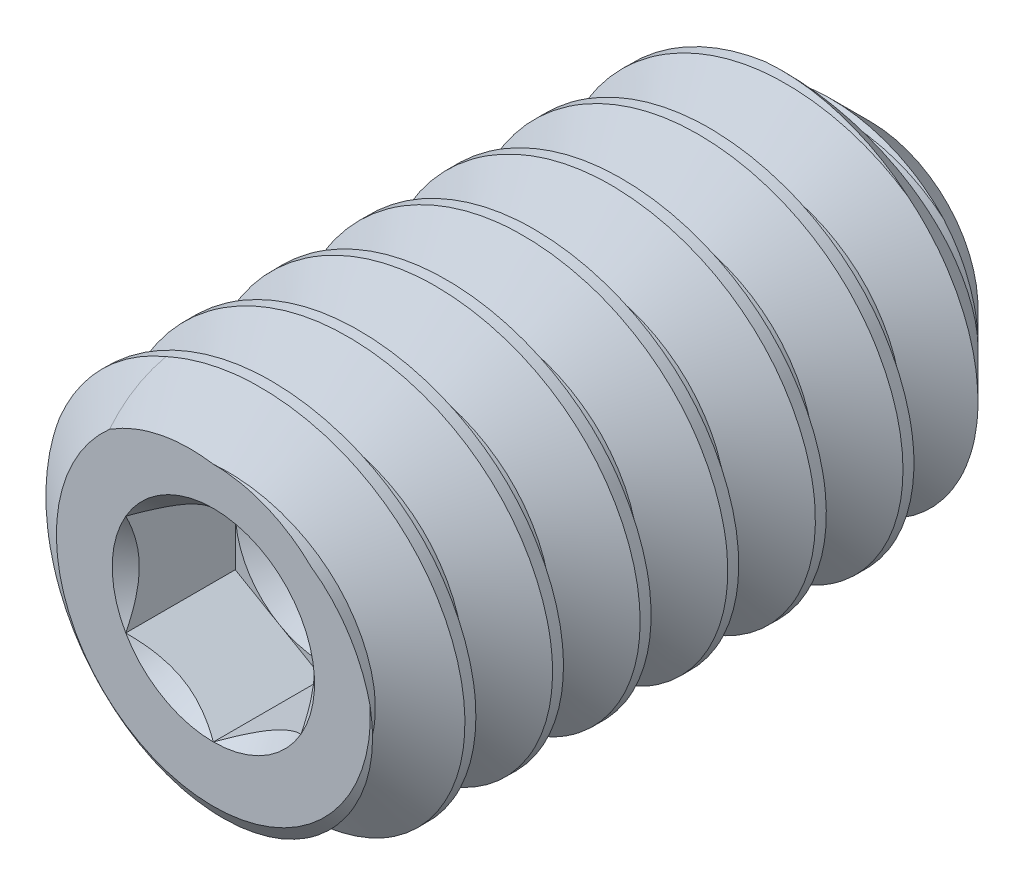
ISO-10303-21;
HEADER;
FILE_DESCRIPTION(('STEP AP214'),'2;1');
FILE_NAME('part.step','',(''),(''),'','','');
FILE_SCHEMA(('AUTOMOTIVE_DESIGN { 1 0 10303 214 1 1 1 1 }'));
ENDSEC;
DATA;
#1=APPLICATION_CONTEXT('core data for automotive mechanical design processes');
#2=APPLICATION_PROTOCOL_DEFINITION('international standard','automotive_design',2000,#1);
#3=PRODUCT_CONTEXT('',#1,'mechanical');
#4=PRODUCT('Part','Part','',(#3));
#5=PRODUCT_RELATED_PRODUCT_CATEGORY('part','',(#4));
#6=PRODUCT_DEFINITION_FORMATION('','',#4);
#7=PRODUCT_DEFINITION_CONTEXT('part definition',#1,'design');
#8=PRODUCT_DEFINITION('design','',#6,#7);
#9=PRODUCT_DEFINITION_SHAPE('','',#8);
#10=(LENGTH_UNIT() NAMED_UNIT(*) SI_UNIT(.MILLI.,.METRE.));
#11=(NAMED_UNIT(*) PLANE_ANGLE_UNIT() SI_UNIT($,.RADIAN.));
#12=(NAMED_UNIT(*) SI_UNIT($,.STERADIAN.) SOLID_ANGLE_UNIT());
#13=UNCERTAINTY_MEASURE_WITH_UNIT(LENGTH_MEASURE(1.E-05),#10,'distance_accuracy_value','');
#14=(GEOMETRIC_REPRESENTATION_CONTEXT(3) GLOBAL_UNCERTAINTY_ASSIGNED_CONTEXT((#13)) GLOBAL_UNIT_ASSIGNED_CONTEXT((#10,
#11,#12)) REPRESENTATION_CONTEXT('',''));
#15=CARTESIAN_POINT('',(0.,0.,0.));
#16=DIRECTION('',(0.,0.,1.));
#17=DIRECTION('',(1.,0.,0.));
#18=AXIS2_PLACEMENT_3D('',#15,#16,#17);
#19=CARTESIAN_POINT('',(-0.635000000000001,1.09985226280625,1.35333702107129));
#20=DIRECTION('',(0.,0.,1.));
#21=DIRECTION('',(1.,0.,0.));
#22=AXIS2_PLACEMENT_3D('',#19,#20,#21);
#23=PLANE('',#22);
#24=CARTESIAN_POINT('',(0.,0.,1.35333702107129));
#25=DIRECTION('',(0.,0.,1.));
#26=DIRECTION('',(1.,0.,0.));
#27=AXIS2_PLACEMENT_3D('',#24,#25,#26);
#28=CIRCLE('',#27,0.635000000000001);
#29=CARTESIAN_POINT('',(0.634999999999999,0.,1.35333702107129));
#30=VERTEX_POINT('',#29);
#31=CARTESIAN_POINT('',(0.317500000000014,0.549926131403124,1.35333702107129));
#32=VERTEX_POINT('',#31);
#33=EDGE_CURVE('E179',#30,#32,#28,.T.);
#34=ORIENTED_EDGE('',*,*,#33,.F.);
#35=DIRECTION('',(0.,1.,0.));
#36=VECTOR('',#35,1.);
#37=CARTESIAN_POINT('',(0.635,-0.366617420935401,1.35333702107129));
#38=LINE('',#37,#36);
#39=CARTESIAN_POINT('',(0.634999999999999,0.366617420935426,1.35333702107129));
#40=VERTEX_POINT('',#39);
#41=EDGE_CURVE('E208',#30,#40,#38,.T.);
#42=ORIENTED_EDGE('',*,*,#41,.T.);
#43=DIRECTION('',(-0.866025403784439,0.5,0.));
#44=VECTOR('',#43,1.);
#45=CARTESIAN_POINT('',(0.634999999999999,0.366617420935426,1.35333702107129));
#46=LINE('',#45,#44);
#47=EDGE_CURVE('E202',#40,#32,#46,.T.);
#48=ORIENTED_EDGE('',*,*,#47,.T.);
#49=EDGE_LOOP('',(#34,#42,#48));
#50=FACE_BOUND('',#49,.T.);
#51=ADVANCED_FACE('F42',(#50),#23,.T.);
#52=CARTESIAN_POINT('',(-0.317500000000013,0.549926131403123,1.35333702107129));
#53=VERTEX_POINT('',#52);
#54=EDGE_CURVE('E181',#32,#53,#28,.T.);
#55=ORIENTED_EDGE('',*,*,#54,.F.);
#56=CARTESIAN_POINT('',(0.,0.733234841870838,1.35333702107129));
#57=VERTEX_POINT('',#56);
#58=EDGE_CURVE('E193',#32,#57,#46,.T.);
#59=ORIENTED_EDGE('',*,*,#58,.T.);
#60=DIRECTION('',(-0.866025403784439,-0.5,0.));
#61=VECTOR('',#60,1.);
#62=CARTESIAN_POINT('',(0.,0.733234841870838,1.35333702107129));
#63=LINE('',#62,#61);
#64=EDGE_CURVE('E196',#57,#53,#63,.T.);
#65=ORIENTED_EDGE('',*,*,#64,.T.);
#66=EDGE_LOOP('',(#55,#59,#65));
#67=FACE_BOUND('',#66,.T.);
#68=ADVANCED_FACE('F192',(#67),#23,.T.);
#69=CARTESIAN_POINT('',(-0.635000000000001,0.,1.35333702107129));
#70=VERTEX_POINT('',#69);
#71=EDGE_CURVE('E198',#53,#70,#28,.T.);
#72=ORIENTED_EDGE('',*,*,#71,.F.);
#73=CARTESIAN_POINT('',(-0.635000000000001,0.366617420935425,1.35333702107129));
#74=VERTEX_POINT('',#73);
#75=EDGE_CURVE('E211',#53,#74,#63,.T.);
#76=ORIENTED_EDGE('',*,*,#75,.T.);
#77=DIRECTION('',(0.,-1.,0.));
#78=VECTOR('',#77,1.);
#79=CARTESIAN_POINT('',(-0.635000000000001,0.366617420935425,1.35333702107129));
#80=LINE('',#79,#78);
#81=EDGE_CURVE('E225',#74,#70,#80,.T.);
#82=ORIENTED_EDGE('',*,*,#81,.T.);
#83=EDGE_LOOP('',(#72,#76,#82));
#84=FACE_BOUND('',#83,.T.);
#85=ADVANCED_FACE('F398',(#84),#23,.T.);
#86=CARTESIAN_POINT('',(-0.317499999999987,-0.549926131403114,1.35333702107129));
#87=VERTEX_POINT('',#86);
#88=EDGE_CURVE('E427',#70,#87,#28,.T.);
#89=ORIENTED_EDGE('',*,*,#88,.F.);
#90=CARTESIAN_POINT('',(-0.635000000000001,-0.3666174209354,1.35333702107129));
#91=VERTEX_POINT('',#90);
#92=EDGE_CURVE('E224',#70,#91,#80,.T.);
#93=ORIENTED_EDGE('',*,*,#92,.T.);
#94=DIRECTION('',(0.866025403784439,-0.5,0.));
#95=VECTOR('',#94,1.);
#96=CARTESIAN_POINT('',(-0.635000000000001,-0.3666174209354,1.35333702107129));
#97=LINE('',#96,#95);
#98=EDGE_CURVE('E230',#91,#87,#97,.T.);
#99=ORIENTED_EDGE('',*,*,#98,.T.);
#100=EDGE_LOOP('',(#89,#93,#99));
#101=FACE_BOUND('',#100,.T.);
#102=ADVANCED_FACE('F415',(#101),#23,.T.);
#103=CARTESIAN_POINT('',(0.317499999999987,-0.549926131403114,1.35333702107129));
#104=VERTEX_POINT('',#103);
#105=EDGE_CURVE('E68',#87,#104,#28,.T.);
#106=ORIENTED_EDGE('',*,*,#105,.F.);
#107=CARTESIAN_POINT('',(0.,-0.733234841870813,1.35333702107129));
#108=VERTEX_POINT('',#107);
#109=EDGE_CURVE('E229',#87,#108,#97,.T.);
#110=ORIENTED_EDGE('',*,*,#109,.T.);
#111=DIRECTION('',(0.866025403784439,0.5,0.));
#112=VECTOR('',#111,1.);
#113=CARTESIAN_POINT('',(0.,-0.733234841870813,1.35333702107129));
#114=LINE('',#113,#112);
#115=EDGE_CURVE('E235',#108,#104,#114,.T.);
#116=ORIENTED_EDGE('',*,*,#115,.T.);
#117=EDGE_LOOP('',(#106,#110,#116));
#118=FACE_BOUND('',#117,.T.);
#119=ADVANCED_FACE('F404',(#118),#23,.T.);
#120=CARTESIAN_POINT('',(0.,0.,2.14708702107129));
#121=DIRECTION('',(0.,0.,-1.));
#122=DIRECTION('',(0.,1.,0.));
#123=AXIS2_PLACEMENT_3D('',#120,#121,#122);
#124=PLANE('',#123);
#125=CARTESIAN_POINT('',(0.,0.,2.14708702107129));
#126=DIRECTION('',(0.,0.,1.));
#127=DIRECTION('',(1.,0.,0.));
#128=AXIS2_PLACEMENT_3D('',#125,#126,#127);
#129=CIRCLE('',#128,0.733234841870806);
#130=CARTESIAN_POINT('',(0.,0.733234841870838,2.14708702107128));
#131=VERTEX_POINT('',#130);
#132=CARTESIAN_POINT('',(-0.634999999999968,0.366617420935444,2.14708702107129));
#133=VERTEX_POINT('',#132);
#134=EDGE_CURVE('E458',#131,#133,#129,.T.);
#135=ORIENTED_EDGE('',*,*,#134,.F.);
#136=CARTESIAN_POINT('',(0.634999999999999,0.366617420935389,2.14708702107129));
#137=VERTEX_POINT('',#136);
#138=EDGE_CURVE('E459',#137,#131,#129,.T.);
#139=ORIENTED_EDGE('',*,*,#138,.F.);
#140=CARTESIAN_POINT('',(0.634999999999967,-0.366617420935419,2.14708702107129));
#141=VERTEX_POINT('',#140);
#142=EDGE_CURVE('E75',#141,#137,#129,.T.);
#143=ORIENTED_EDGE('',*,*,#142,.F.);
#144=CARTESIAN_POINT('',(0.,-0.733234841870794,2.14708702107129));
#145=VERTEX_POINT('',#144);
#146=EDGE_CURVE('E450',#145,#141,#129,.T.);
#147=ORIENTED_EDGE('',*,*,#146,.F.);
#148=CARTESIAN_POINT('',(-0.635000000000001,-0.366617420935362,2.14708702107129));
#149=VERTEX_POINT('',#148);
#150=EDGE_CURVE('E446',#149,#145,#129,.T.);
#151=ORIENTED_EDGE('',*,*,#150,.F.);
#152=EDGE_CURVE('E449',#133,#149,#129,.T.);
#153=ORIENTED_EDGE('',*,*,#152,.F.);
#154=EDGE_LOOP('',(#135,#139,#143,#147,#151,#153));
#155=FACE_BOUND('',#154,.T.);
#156=CARTESIAN_POINT('',(-1.15157503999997,0.412237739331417,2.14708702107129));
#157=CARTESIAN_POINT('',(-1.14346885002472,0.427659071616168,2.14708702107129));
#158=CARTESIAN_POINT('',(-1.13504646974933,0.442914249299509,2.14708702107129));
#159=CARTESIAN_POINT('',(-1.11758282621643,0.473067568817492,2.14708702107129));
#160=CARTESIAN_POINT('',(-1.1085415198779,0.487965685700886,2.14708702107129));
#161=CARTESIAN_POINT('',(-1.08984287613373,0.517396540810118,2.14708702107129));
#162=CARTESIAN_POINT('',(-1.08018477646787,0.53192879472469,2.14708702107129));
#163=CARTESIAN_POINT('',(-1.06028620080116,0.560588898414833,2.14708702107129));
#164=CARTESIAN_POINT('',(-1.05004571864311,0.574716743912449,2.14708702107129));
#165=CARTESIAN_POINT('',(-1.02896889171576,0.602535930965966,2.14708702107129));
#166=CARTESIAN_POINT('',(-1.01813220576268,0.616227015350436,2.14708702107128));
#167=CARTESIAN_POINT('',(-0.995805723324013,0.643063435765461,2.14708702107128));
#168=CARTESIAN_POINT('',(-0.984315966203,0.656208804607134,2.14708702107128));
#169=CARTESIAN_POINT('',(-0.948943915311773,0.694790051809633,2.14708702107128));
#170=CARTESIAN_POINT('',(-0.924141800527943,0.719393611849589,2.14708702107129));
#171=CARTESIAN_POINT('',(-0.873350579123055,0.765172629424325,2.14708702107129));
#172=CARTESIAN_POINT('',(-0.84744989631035,0.786446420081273,2.14708702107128));
#173=CARTESIAN_POINT('',(-0.793810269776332,0.826531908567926,2.14708702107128));
#174=CARTESIAN_POINT('',(-0.766070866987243,0.845342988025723,2.14708702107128));
#175=CARTESIAN_POINT('',(-0.680502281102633,0.897768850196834,2.14708702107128));
#176=CARTESIAN_POINT('',(-0.620205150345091,0.927482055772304,2.14708702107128));
#177=CARTESIAN_POINT('',(-0.500382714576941,0.973352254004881,2.14708702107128));
#178=CARTESIAN_POINT('',(-0.441200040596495,0.990421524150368,2.14708702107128));
#179=CARTESIAN_POINT('',(-0.320791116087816,1.01432482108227,2.14708702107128));
#180=CARTESIAN_POINT('',(-0.259565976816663,1.02116432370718,2.14708702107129));
#181=CARTESIAN_POINT('',(-0.165067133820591,1.02368848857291,2.14708702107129));
#182=CARTESIAN_POINT('',(-0.131850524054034,1.02305016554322,2.14708702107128));
#183=CARTESIAN_POINT('',(-0.0656832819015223,1.01875329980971,2.14708702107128));
#184=CARTESIAN_POINT('',(-0.0327322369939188,1.01510111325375,2.14708702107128));
#185=CARTESIAN_POINT('',(0.,1.00995540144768,2.14708702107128));
#186=B_SPLINE_CURVE_WITH_KNOTS('',3,(#156,#157,#158,#159,#160,#161,#162,#163,#164,#165,#166,
#167,#168,#169,#170,#171,#172,#173,#174,#175,#176,#177,#178,#179,#180,#181,#182,#183,#184,#185),
.UNSPECIFIED.,.F.,.F.,(4,2,2,2,2,2,2,2,2,2,2,2,2,2,4),(0.,0.0522625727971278,0.104528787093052,
0.156860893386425,0.209193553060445,0.261556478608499,0.313916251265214,0.418551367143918,
0.518959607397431,0.619393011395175,0.819792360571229,1.00374835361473,1.18760584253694,
1.28715201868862,1.38648878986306),.UNSPECIFIED.);
#187=CARTESIAN_POINT('',(-0.752890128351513,0.853239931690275,2.14708702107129));
#188=VERTEX_POINT('',#187);
#189=CARTESIAN_POINT('',(0.,1.00995540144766,2.14708702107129));
#190=VERTEX_POINT('',#189);
#191=EDGE_CURVE('E319',#188,#190,#186,.T.);
#192=ORIENTED_EDGE('',*,*,#191,.F.);
#193=CARTESIAN_POINT('',(0.,0.,2.14708702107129));
#194=DIRECTION('',(0.,0.,1.));
#195=DIRECTION('',(0.,-1.,0.));
#196=AXIS2_PLACEMENT_3D('',#193,#194,#195);
#197=CIRCLE('',#196,1.13791999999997);
#198=CARTESIAN_POINT('',(1.13638537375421,0.0590779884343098,2.14708702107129));
#199=VERTEX_POINT('',#198);
#200=EDGE_CURVE('E521',#188,#199,#197,.T.);
#201=ORIENTED_EDGE('',*,*,#200,.T.);
#202=CARTESIAN_POINT('',(0.707604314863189,0.720628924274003,2.14708702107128));
#203=CARTESIAN_POINT('',(0.72616130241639,0.707872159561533,2.14708702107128));
#204=CARTESIAN_POINT('',(0.744264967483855,0.694456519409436,2.14708702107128));
#205=CARTESIAN_POINT('',(0.779473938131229,0.666389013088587,2.14708702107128));
#206=CARTESIAN_POINT('',(0.796579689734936,0.651737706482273,2.14708702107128));
#207=CARTESIAN_POINT('',(0.829674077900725,0.621309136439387,2.14708702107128));
#208=CARTESIAN_POINT('',(0.84566555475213,0.605534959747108,2.14708702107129));
#209=CARTESIAN_POINT('',(0.876507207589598,0.572901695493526,2.14708702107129));
#210=CARTESIAN_POINT('',(0.891357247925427,0.556042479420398,2.14708702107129));
#211=CARTESIAN_POINT('',(0.914101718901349,0.52833444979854,2.14708702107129));
#212=CARTESIAN_POINT('',(0.922386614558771,0.517802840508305,2.14708702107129));
#213=CARTESIAN_POINT('',(0.938590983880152,0.496461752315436,2.14708702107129));
#214=CARTESIAN_POINT('',(0.94651043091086,0.485652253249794,2.14708702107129));
#215=CARTESIAN_POINT('',(0.969687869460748,0.452807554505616,2.14708702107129));
#216=CARTESIAN_POINT('',(0.984363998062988,0.430357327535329,2.14708702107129));
#217=CARTESIAN_POINT('',(1.01211819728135,0.384432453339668,2.14708702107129));
#218=CARTESIAN_POINT('',(1.02519312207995,0.360955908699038,2.14708702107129));
#219=CARTESIAN_POINT('',(1.04964009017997,0.313142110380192,2.14708702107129));
#220=CARTESIAN_POINT('',(1.06101248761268,0.288805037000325,2.14708702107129));
#221=CARTESIAN_POINT('',(1.09132634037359,0.217403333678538,2.14708702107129));
#222=CARTESIAN_POINT('',(1.10801371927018,0.169360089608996,2.14708702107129));
#223=CARTESIAN_POINT('',(1.13478221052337,0.0716297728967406,2.14708702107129));
#224=CARTESIAN_POINT('',(1.14488378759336,0.0219483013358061,2.14708702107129));
#225=CARTESIAN_POINT('',(1.15157503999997,-0.0281686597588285,2.14708702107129));
#226=B_SPLINE_CURVE_WITH_KNOTS('',3,(#202,#203,#204,#205,#206,#207,#208,#209,#210,#211,#212,
#213,#214,#215,#216,#217,#218,#219,#220,#221,#222,#223,#224,#225),.UNSPECIFIED.,.F.,.F.,(4,2,2,
2,2,2,2,2,2,2,2,4),(0.,0.0675420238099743,0.135053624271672,0.202386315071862,0.269726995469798,
0.309917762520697,0.350111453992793,0.430503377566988,0.511050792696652,0.591581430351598,
0.743672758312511,0.895289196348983),.UNSPECIFIED.);
#227=CARTESIAN_POINT('',(0.707604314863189,0.720628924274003,2.14708702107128));
#228=VERTEX_POINT('',#227);
#229=EDGE_CURVE('E288',#228,#199,#226,.T.);
#230=ORIENTED_EDGE('',*,*,#229,.F.);
#231=CARTESIAN_POINT('',(0.,1.00995540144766,2.14708702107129));
#232=CARTESIAN_POINT('',(0.026558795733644,1.00995518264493,2.14708702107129));
#233=CARTESIAN_POINT('',(0.0531063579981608,1.00890717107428,2.14708702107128));
#234=CARTESIAN_POINT('',(0.106070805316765,1.00472196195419,2.14708702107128));
#235=CARTESIAN_POINT('',(0.132487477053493,1.00158206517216,2.14708702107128));
#236=CARTESIAN_POINT('',(0.211851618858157,0.988946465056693,2.14708702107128));
#237=CARTESIAN_POINT('',(0.264323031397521,0.976234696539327,2.14708702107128));
#238=CARTESIAN_POINT('',(0.366612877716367,0.942608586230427,2.14708702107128));
#239=CARTESIAN_POINT('',(0.416428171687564,0.921684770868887,2.14708702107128));
#240=CARTESIAN_POINT('',(0.508912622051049,0.873808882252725,2.14708702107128));
#241=CARTESIAN_POINT('',(0.551836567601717,0.847348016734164,2.14708702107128));
#242=CARTESIAN_POINT('',(0.633260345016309,0.788373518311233,2.14708702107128));
#243=CARTESIAN_POINT('',(0.671762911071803,0.755863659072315,2.14708702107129));
#244=CARTESIAN_POINT('',(0.707604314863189,0.720628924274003,2.14708702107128));
#245=B_SPLINE_CURVE_WITH_KNOTS('',3,(#231,#232,#233,#234,#235,#236,#237,#238,#239,#240,#241,
#242,#243,#244),.UNSPECIFIED.,.F.,.F.,(4,2,2,2,2,2,4),(0.,0.0796333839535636,0.159369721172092,
0.32059294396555,0.482002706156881,0.632719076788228,0.783341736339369),.UNSPECIFIED.);
#246=EDGE_CURVE('E514',#190,#228,#245,.T.);
#247=ORIENTED_EDGE('',*,*,#246,.F.);
#248=EDGE_LOOP('',(#192,#201,#230,#247));
#249=FACE_BOUND('',#248,.T.);
#250=ADVANCED_FACE('F44',(#155,#249),#124,.F.);
#251=CARTESIAN_POINT('',(0.,0.,-2.61541297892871));
#252=DIRECTION('',(0.,0.,1.));
#253=DIRECTION('',(0.,-1.,0.));
#254=AXIS2_PLACEMENT_3D('',#251,#252,#253);
#255=CONICAL_SURFACE('',#254,0.779425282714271,0.785398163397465);
#256=CARTESIAN_POINT('',(0.,0.,-2.61541297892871));
#257=DIRECTION('',(0.,0.,1.));
#258=DIRECTION('',(0.,-1.,0.));
#259=AXIS2_PLACEMENT_3D('',#256,#257,#258);
#260=CIRCLE('',#259,0.779425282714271);
#261=CARTESIAN_POINT('',(0.,-0.779425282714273,-2.6154129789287));
#262=VERTEX_POINT('',#261);
#263=EDGE_CURVE('E534',#262,#262,#260,.T.);
#264=ORIENTED_EDGE('',*,*,#263,.T.);
#265=EDGE_LOOP('',(#264));
#266=FACE_BOUND('',#265,.T.);
#267=CARTESIAN_POINT('',(0.759551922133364,0.665650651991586,-2.38488286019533));
#268=CARTESIAN_POINT('',(0.74183465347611,0.688630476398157,-2.383061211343));
#269=CARTESIAN_POINT('',(0.723155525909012,0.71084916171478,-2.38121903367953));
#270=CARTESIAN_POINT('',(0.683992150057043,0.753630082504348,-2.37750597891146));
#271=CARTESIAN_POINT('',(0.663507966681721,0.774192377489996,-2.37563510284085));
#272=CARTESIAN_POINT('',(0.59956670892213,0.833156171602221,-2.37000155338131));
#273=CARTESIAN_POINT('',(0.55358471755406,0.86888145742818,-2.36621423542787));
#274=CARTESIAN_POINT('',(0.45627528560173,0.932082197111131,-2.35868934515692));
#275=CARTESIAN_POINT('',(0.404945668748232,0.959554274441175,-2.35495179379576));
#276=CARTESIAN_POINT('',(0.298385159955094,1.00546472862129,-2.34762772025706));
#277=CARTESIAN_POINT('',(0.243156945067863,1.02390923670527,-2.34404109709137));
#278=CARTESIAN_POINT('',(0.158651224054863,1.0444151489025,-2.33884014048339));
#279=CARTESIAN_POINT('',(0.13020124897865,1.05005727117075,-2.33713608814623));
#280=CARTESIAN_POINT('',(0.0729137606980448,1.05891858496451,-2.33380617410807));
#281=CARTESIAN_POINT('',(0.0440762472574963,1.06213777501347,-2.33218031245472));
#282=CARTESIAN_POINT('',(-0.0137810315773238,1.06616996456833,-2.32897286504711));
#283=CARTESIAN_POINT('',(-0.0428008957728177,1.06698152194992,-2.32739130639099));
#284=CARTESIAN_POINT('',(-0.100811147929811,1.06633141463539,-2.32414385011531));
#285=CARTESIAN_POINT('',(-0.129801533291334,1.06486956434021,-2.32247794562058));
#286=CARTESIAN_POINT('',(-0.188370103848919,1.05957411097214,-2.31906135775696));
#287=CARTESIAN_POINT('',(-0.217942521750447,1.05567637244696,-2.31730960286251));
#288=CARTESIAN_POINT('',(-0.276661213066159,1.04549230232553,-2.31376953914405));
#289=CARTESIAN_POINT('',(-0.30580751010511,1.03920610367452,-2.31198123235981));
#290=CARTESIAN_POINT('',(-0.39231684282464,1.01681463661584,-2.30658422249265));
#291=CARTESIAN_POINT('',(-0.448804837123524,0.99717151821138,-2.30294024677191));
#292=CARTESIAN_POINT('',(-0.559826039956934,0.948095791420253,-2.29552744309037));
#293=CARTESIAN_POINT('',(-0.61421136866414,0.918330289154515,-2.29175894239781));
#294=CARTESIAN_POINT('',(-0.717195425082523,0.850080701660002,-2.28434095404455));
#295=CARTESIAN_POINT('',(-0.765795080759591,0.811598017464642,-2.28069144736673));
#296=CARTESIAN_POINT('',(-0.855856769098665,0.726998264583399,-2.27358058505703));
#297=CARTESIAN_POINT('',(-0.897321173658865,0.680883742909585,-2.27011916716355));
#298=CARTESIAN_POINT('',(-0.953195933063,0.60700100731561,-2.26520203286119));
#299=CARTESIAN_POINT('',(-0.970772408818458,0.58157825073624,-2.26360829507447));
#300=CARTESIAN_POINT('',(-1.00383019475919,0.529373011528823,-2.26039655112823));
#301=CARTESIAN_POINT('',(-1.0193093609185,0.502589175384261,-2.25877852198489));
#302=CARTESIAN_POINT('',(-1.06288831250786,0.419746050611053,-2.25378401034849));
#303=CARTESIAN_POINT('',(-1.08761938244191,0.361875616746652,-2.25030848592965));
#304=CARTESIAN_POINT('',(-1.12742513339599,0.242914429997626,-2.24324234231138));
#305=CARTESIAN_POINT('',(-1.14250021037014,0.181823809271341,-2.23965172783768));
#306=CARTESIAN_POINT('',(-1.15782897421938,0.0875928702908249,-2.23416338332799));
#307=CARTESIAN_POINT('',(-1.1617222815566,0.0550088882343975,-2.23227447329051));
#308=CARTESIAN_POINT('',(-1.16674649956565,-0.0103386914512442,-2.22850482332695));
#309=CARTESIAN_POINT('',(-1.16787979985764,-0.0431021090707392,-2.22662407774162));
#310=CARTESIAN_POINT('',(-1.16711189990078,-0.141389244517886,-2.22100915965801));
#311=CARTESIAN_POINT('',(-1.16104932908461,-0.206949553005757,-2.21729999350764));
#312=CARTESIAN_POINT('',(-1.14378073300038,-0.303728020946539,-2.21187287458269));
#313=CARTESIAN_POINT('',(-1.13665720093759,-0.335740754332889,-2.21008585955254));
#314=CARTESIAN_POINT('',(-1.11973480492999,-0.399061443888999,-2.20656745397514));
#315=CARTESIAN_POINT('',(-1.10993629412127,-0.430369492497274,-2.20483605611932));
#316=CARTESIAN_POINT('',(-1.08773265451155,-0.492059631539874,-2.20143443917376));
#317=CARTESIAN_POINT('',(-1.07532687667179,-0.522441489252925,-2.19976423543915));
#318=CARTESIAN_POINT('',(-1.0479867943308,-0.582043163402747,-2.19651568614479));
#319=CARTESIAN_POINT('',(-1.03305219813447,-0.611262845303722,-2.19493735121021));
#320=CARTESIAN_POINT('',(-0.984696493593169,-0.697223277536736,-2.19008432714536));
#321=CARTESIAN_POINT('',(-0.947801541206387,-0.752053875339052,-2.18670161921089));
#322=CARTESIAN_POINT('',(-0.865739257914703,-0.855088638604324,-2.17978748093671));
#323=CARTESIAN_POINT('',(-0.820570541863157,-0.903291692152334,-2.17625602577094));
#324=CARTESIAN_POINT('',(-0.720534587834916,-0.994202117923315,-2.1689417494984));
#325=CARTESIAN_POINT('',(-0.665282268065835,-1.03648724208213,-2.16515547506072));
#326=CARTESIAN_POINT('',(-0.548471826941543,-1.11115743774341,-2.15762488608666));
#327=CARTESIAN_POINT('',(-0.486914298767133,-1.14354343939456,-2.15388056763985));
#328=CARTESIAN_POINT('',(-0.359183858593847,-1.19751319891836,-2.14653335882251));
#329=CARTESIAN_POINT('',(-0.293010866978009,-1.21909677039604,-2.14293047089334));
#330=CARTESIAN_POINT('',(-0.191803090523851,-1.24290380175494,-2.13770114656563));
#331=CARTESIAN_POINT('',(-0.157725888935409,-1.24941247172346,-2.13598643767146));
#332=CARTESIAN_POINT('',(-0.0891302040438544,-1.25952894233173,-2.13263376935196));
#333=CARTESIAN_POINT('',(-0.0546117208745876,-1.26313674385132,-2.13099580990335));
#334=CARTESIAN_POINT('',(0.0145324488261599,-1.26745518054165,-2.12777142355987));
#335=CARTESIAN_POINT('',(0.0491577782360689,-1.26817165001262,-2.12618489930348));
#336=CARTESIAN_POINT('',(0.118352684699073,-1.26686648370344,-2.1229251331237));
#337=CARTESIAN_POINT('',(0.152922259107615,-1.26484472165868,-2.12125188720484));
#338=CARTESIAN_POINT('',(0.22180002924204,-1.25803834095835,-2.11786474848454));
#339=CARTESIAN_POINT('',(0.256108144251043,-1.25325290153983,-2.11615084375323));
#340=CARTESIAN_POINT('',(0.324221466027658,-1.24096368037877,-2.11268620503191));
#341=CARTESIAN_POINT('',(0.358026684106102,-1.23345995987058,-2.11093547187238));
#342=CARTESIAN_POINT('',(0.461928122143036,-1.20598465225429,-2.10546133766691));
#343=CARTESIAN_POINT('',(0.530863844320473,-1.18139670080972,-2.10169508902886));
#344=CARTESIAN_POINT('',(0.663593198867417,-1.12102237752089,-2.09416932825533));
#345=CARTESIAN_POINT('',(0.727387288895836,-1.0852370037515,-2.09040981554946));
#346=CARTESIAN_POINT('',(0.848248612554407,-1.00337184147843,-2.08298779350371));
#347=CARTESIAN_POINT('',(0.905296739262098,-0.957263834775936,-2.079325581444));
#348=CARTESIAN_POINT('',(1.01086165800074,-0.856059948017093,-2.07220649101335));
#349=CARTESIAN_POINT('',(1.05937893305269,-0.800964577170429,-2.06874960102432));
#350=CARTESIAN_POINT('',(1.1137441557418,-0.727609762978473,-2.06460995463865));
#351=CARTESIAN_POINT('',(1.12430095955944,-0.712717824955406,-2.06379127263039));
#352=CARTESIAN_POINT('',(1.14477328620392,-0.682499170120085,-2.06217948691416));
#353=CARTESIAN_POINT('',(1.15468894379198,-0.667172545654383,-2.06138637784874));
#354=CARTESIAN_POINT('',(1.1835010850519,-0.620615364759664,-2.05898374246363));
#355=CARTESIAN_POINT('',(1.20146302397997,-0.588807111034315,-2.05735088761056));
#356=CARTESIAN_POINT('',(1.25143707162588,-0.491368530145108,-2.05236690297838));
#357=CARTESIAN_POINT('',(1.27955890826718,-0.423695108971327,-2.04892883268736));
#358=CARTESIAN_POINT('',(1.32554067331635,-0.281901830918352,-2.04178465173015));
#359=CARTESIAN_POINT('',(1.34293262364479,-0.207631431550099,-2.03807333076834));
#360=CARTESIAN_POINT('',(1.36512767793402,-0.0572363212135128,-2.03062073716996));
#361=CARTESIAN_POINT('',(1.36993230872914,0.0188881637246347,-2.02687946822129));
#362=CARTESIAN_POINT('',(1.3668066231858,0.171723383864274,-2.01942833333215));
#363=CARTESIAN_POINT('',(1.35873322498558,0.248431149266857,-2.01571928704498));
#364=CARTESIAN_POINT('',(1.32978791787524,0.399447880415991,-2.0084747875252));
#365=CARTESIAN_POINT('',(1.30891474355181,0.473756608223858,-2.00493935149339));
#366=CARTESIAN_POINT('',(1.26851063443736,0.58171909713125,-1.99983373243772));
#367=CARTESIAN_POINT('',(1.25352441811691,0.61712738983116,-1.99816458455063));
#368=CARTESIAN_POINT('',(1.22061759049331,0.686558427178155,-1.99491125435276));
#369=CARTESIAN_POINT('',(1.20269644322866,0.720580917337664,-1.99332708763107));
#370=CARTESIAN_POINT('',(1.1449496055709,0.820273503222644,-1.98846379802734));
#371=CARTESIAN_POINT('',(1.10109574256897,0.883685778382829,-1.9850691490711));
#372=CARTESIAN_POINT('',(1.03136535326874,0.968962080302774,-1.98010093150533));
#373=CARTESIAN_POINT('',(1.00932038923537,0.994068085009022,-1.97858143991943));
#374=CARTESIAN_POINT('',(0.96358325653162,1.04262424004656,-1.97552381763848));
#375=CARTESIAN_POINT('',(0.939894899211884,1.06607798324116,-1.97398573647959));
#376=CARTESIAN_POINT('',(0.915407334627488,1.08869241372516,-1.97243826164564));
#377=B_SPLINE_CURVE_WITH_KNOTS('',3,(#267,#268,#269,#270,#271,#272,#273,#274,#275,#276,#277,
#278,#279,#280,#281,#282,#283,#284,#285,#286,#287,#288,#289,#290,#291,#292,#293,#294,#295,#296,
#297,#298,#299,#300,#301,#302,#303,#304,#305,#306,#307,#308,#309,#310,#311,#312,#313,#314,#315,
#316,#317,#318,#319,#320,#321,#322,#323,#324,#325,#326,#327,#328,#329,#330,#331,#332,#333,#334,
#335,#336,#337,#338,#339,#340,#341,#342,#343,#344,#345,#346,#347,#348,#349,#350,#351,#352,#353,
#354,#355,#356,#357,#358,#359,#360,#361,#362,#363,#364,#365,#366,#367,#368,#369,#370,#371,#372,
#373,#374,#375,#376),.UNSPECIFIED.,.F.,.F.,(4,2,2,2,2,2,2,2,2,2,2,2,2,2,2,2,2,2,2,2,2,2,2,2,2,2,
2,2,2,2,2,2,2,2,2,2,2,2,2,2,2,2,2,2,2,2,2,2,2,2,2,2,2,2,4),(0.,0.0871676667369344,
0.174332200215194,0.348485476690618,0.522709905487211,0.696815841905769,0.783893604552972,
0.870971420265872,0.958101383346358,1.04523846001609,1.13477248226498,1.22430152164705,
1.40319702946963,1.58865964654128,1.77409247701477,1.95946354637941,2.05221600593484,
2.14506257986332,2.33328081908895,2.52149133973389,2.61999535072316,2.71841404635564,
2.91513202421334,3.01357664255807,3.11200827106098,3.21046443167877,3.30893195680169,
3.50653640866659,3.70417397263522,3.91220369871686,4.12021387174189,4.32822763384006,
4.43233293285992,4.53643820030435,4.6403332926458,4.74423317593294,4.84816393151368,
4.95209234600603,5.17082117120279,5.38953050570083,5.60884517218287,5.82814741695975,
5.88295715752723,5.93775534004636,6.04735025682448,6.26643229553,6.49449612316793,
6.72253228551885,6.95311974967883,7.18373001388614,7.29906414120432,7.41441935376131,
7.64475764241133,7.74503136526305,7.8450798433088),.UNSPECIFIED.);
#378=CARTESIAN_POINT('',(0.759551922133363,0.665650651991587,-2.38488286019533));
#379=VERTEX_POINT('',#378);
#380=CARTESIAN_POINT('',(0.915407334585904,1.08869241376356,-1.97243826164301));
#381=VERTEX_POINT('',#380);
#382=EDGE_CURVE('E327',#379,#381,#377,.T.);
#383=ORIENTED_EDGE('',*,*,#382,.F.);
#384=CARTESIAN_POINT('',(1.00735147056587,-0.0724770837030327,-2.38488286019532));
#385=CARTESIAN_POINT('',(1.00925720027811,-0.0459858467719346,-2.38488286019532));
#386=CARTESIAN_POINT('',(1.01011702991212,-0.0194306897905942,-2.38488286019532));
#387=CARTESIAN_POINT('',(1.00974338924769,0.0336974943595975,-2.38488286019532));
#388=CARTESIAN_POINT('',(1.00850734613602,0.0602705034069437,-2.38488286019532));
#389=CARTESIAN_POINT('',(1.00159987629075,0.140333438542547,-2.38488286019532));
#390=CARTESIAN_POINT('',(0.992686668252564,0.19357957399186,-2.38488286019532));
#391=CARTESIAN_POINT('',(0.966489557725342,0.298018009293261,-2.38488286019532));
#392=CARTESIAN_POINT('',(0.949195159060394,0.349207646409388,-2.38488286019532));
#393=CARTESIAN_POINT('',(0.907073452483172,0.447226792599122,-2.38488286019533));
#394=CARTESIAN_POINT('',(0.882397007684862,0.494121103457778,-2.38488286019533));
#395=CARTESIAN_POINT('',(0.826054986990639,0.583483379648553,-2.38488286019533));
#396=CARTESIAN_POINT('',(0.794391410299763,0.625952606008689,-2.38488286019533));
#397=CARTESIAN_POINT('',(0.759551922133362,0.665650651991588,-2.38488286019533));
#398=B_SPLINE_CURVE_WITH_KNOTS('',3,(#384,#385,#386,#387,#388,#389,#390,#391,#392,#393,#394,
#395,#396,#397),.UNSPECIFIED.,.F.,.F.,(4,2,2,2,2,2,4),(0.,0.0796359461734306,0.159369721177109,
0.320585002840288,0.482002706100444,0.640324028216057,0.798600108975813),.UNSPECIFIED.);
#399=CARTESIAN_POINT('',(1.00735147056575,-0.0724770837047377,-2.3848828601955));
#400=VERTEX_POINT('',#399);
#401=EDGE_CURVE('E58',#400,#379,#398,.T.);
#402=ORIENTED_EDGE('',*,*,#401,.F.);
#403=CARTESIAN_POINT('',(-0.12079438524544,1.41726161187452,-1.97243826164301));
#404=CARTESIAN_POINT('',(-0.101268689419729,1.41581654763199,-1.97553679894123));
#405=CARTESIAN_POINT('',(-0.0817610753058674,1.41401647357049,-1.97859230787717));
#406=CARTESIAN_POINT('',(-0.0428178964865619,1.40965984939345,-1.98466105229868));
#407=CARTESIAN_POINT('',(-0.0233823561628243,1.40710306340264,-1.98767427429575));
#408=CARTESIAN_POINT('',(0.0153745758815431,1.40118648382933,-1.9937012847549));
#409=CARTESIAN_POINT('',(0.0346959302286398,1.39782644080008,-1.99671507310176));
#410=CARTESIAN_POINT('',(0.0731390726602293,1.39020250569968,-2.00284786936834));
#411=CARTESIAN_POINT('',(0.0922608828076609,1.38593871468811,-2.00596686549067));
#412=CARTESIAN_POINT('',(0.149248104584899,1.37185126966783,-2.01543180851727));
#413=CARTESIAN_POINT('',(0.18678265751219,1.36072434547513,-2.02189302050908));
#414=CARTESIAN_POINT('',(0.260597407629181,1.33508501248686,-2.03510404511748));
#415=CARTESIAN_POINT('',(0.296877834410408,1.32057322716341,-2.04185380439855));
#416=CARTESIAN_POINT('',(0.401187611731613,1.27313672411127,-2.06205520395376));
#417=CARTESIAN_POINT('',(0.46716077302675,1.23568832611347,-2.07586832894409));
#418=CARTESIAN_POINT('',(0.591175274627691,1.14973234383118,-2.10415170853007));
#419=CARTESIAN_POINT('',(0.649221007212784,1.10123092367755,-2.11862159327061));
#420=CARTESIAN_POINT('',(0.753214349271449,0.997093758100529,-2.1472128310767));
#421=CARTESIAN_POINT('',(0.799596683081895,0.941890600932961,-2.16131944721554));
#422=CARTESIAN_POINT('',(0.861568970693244,0.853784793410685,-2.18240186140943));
#423=CARTESIAN_POINT('',(0.880972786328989,0.823504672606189,-2.18942235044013));
#424=CARTESIAN_POINT('',(0.917132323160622,0.76135359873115,-2.20339002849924));
#425=CARTESIAN_POINT('',(0.933887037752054,0.729482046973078,-2.21033718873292));
#426=CARTESIAN_POINT('',(0.956972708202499,0.680579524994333,-2.22067082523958));
#427=CARTESIAN_POINT('',(0.964346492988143,0.664043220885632,-2.22411137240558));
#428=CARTESIAN_POINT('',(0.978376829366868,0.630660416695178,-2.23094924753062));
#429=CARTESIAN_POINT('',(0.985033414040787,0.613813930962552,-2.23434657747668));
#430=CARTESIAN_POINT('',(0.99761794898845,0.579846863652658,-2.24108438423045));
#431=CARTESIAN_POINT('',(1.00354624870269,0.562726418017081,-2.24442488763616));
#432=CARTESIAN_POINT('',(1.01446162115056,0.528210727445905,-2.25123777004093));
#433=CARTESIAN_POINT('',(1.01944852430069,0.510815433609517,-2.25471017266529));
#434=CARTESIAN_POINT('',(1.03299000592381,0.458405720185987,-2.26525597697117));
#435=CARTESIAN_POINT('',(1.04016789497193,0.423053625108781,-2.27248014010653));
#436=CARTESIAN_POINT('',(1.05074172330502,0.351866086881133,-2.28730768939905));
#437=CARTESIAN_POINT('',(1.05413547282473,0.316030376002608,-2.29491129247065));
#438=CARTESIAN_POINT('',(1.05806795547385,0.220626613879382,-2.31557245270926));
#439=CARTESIAN_POINT('',(1.05526544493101,0.16093674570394,-2.32893080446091));
#440=CARTESIAN_POINT('',(1.04322293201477,0.0724594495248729,-2.34950992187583));
#441=CARTESIAN_POINT('',(1.03786408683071,0.0430250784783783,-2.35648956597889));
#442=CARTESIAN_POINT('',(1.02454659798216,-0.0152342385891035,-2.37058904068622));
#443=CARTESIAN_POINT('',(1.01658645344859,-0.0440588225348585,-2.37770894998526));
#444=CARTESIAN_POINT('',(1.00735147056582,-0.0724770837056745,-2.38488286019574));
#445=B_SPLINE_CURVE_WITH_KNOTS('',3,(#403,#404,#405,#406,#407,#408,#409,#410,#411,#412,#413,
#414,#415,#416,#417,#418,#419,#420,#421,#422,#423,#424,#425,#426,#427,#428,#429,#430,#431,#432,
#433,#434,#435,#436,#437,#438,#439,#440,#441,#442,#443,#444),.UNSPECIFIED.,.F.,.F.,(4,2,2,2,2,2,
2,2,2,2,2,2,2,2,2,2,2,2,2,2,4),(0.,0.0594667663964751,0.118952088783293,0.178455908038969,
0.237953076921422,0.356802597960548,0.475630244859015,0.705641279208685,0.9355243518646,
1.15479753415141,1.26462103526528,1.37448616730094,1.4297621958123,1.48503567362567,
1.54028252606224,1.5955393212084,1.70568407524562,1.8158925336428,1.99851682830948,
2.09058525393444,2.18270689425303),.UNSPECIFIED.);
#446=CARTESIAN_POINT('',(-0.120794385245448,1.41726161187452,-1.97243826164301));
#447=VERTEX_POINT('',#446);
#448=EDGE_CURVE('E313',#447,#400,#445,.T.);
#449=ORIENTED_EDGE('',*,*,#448,.F.);
#450=CARTESIAN_POINT('',(0.,0.,-1.972438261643));
#451=DIRECTION('',(0.,0.,1.));
#452=DIRECTION('',(0.,-1.,0.));
#453=AXIS2_PLACEMENT_3D('',#450,#451,#452);
#454=CIRCLE('',#453,1.4224);
#455=EDGE_CURVE('E516',#381,#447,#454,.T.);
#456=ORIENTED_EDGE('',*,*,#455,.F.);
#457=EDGE_LOOP('',(#383,#402,#449,#456));
#458=FACE_BOUND('',#457,.T.);
#459=ADVANCED_FACE('F375',(#266,#458),#255,.T.);
#460=CARTESIAN_POINT('',(0.,0.,-2.14708702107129));
#461=DIRECTION('',(0.,0.,1.));
#462=DIRECTION('',(0.,-1.,0.));
#463=AXIS2_PLACEMENT_3D('',#460,#461,#462);
#464=CYLINDRICAL_SURFACE('',#463,1.42239999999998);
#465=CARTESIAN_POINT('',(0.,1.4224,-2.61541297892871));
#466=CARTESIAN_POINT('',(-0.821223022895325,1.4224,-2.56249631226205));
#467=CARTESIAN_POINT('',(-1.23183453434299,0.711199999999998,-2.50957964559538));
#468=CARTESIAN_POINT('',(-1.64244604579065,0.,-2.45666297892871));
#469=CARTESIAN_POINT('',(-1.23183453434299,-0.711200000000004,-2.40374631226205));
#470=CARTESIAN_POINT('',(-0.821223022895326,-1.42240000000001,-2.35082964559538));
#471=CARTESIAN_POINT('',(0.,-1.42240000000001,-2.29791297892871));
#472=CARTESIAN_POINT('',(0.821223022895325,-1.42240000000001,-2.24499631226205));
#473=CARTESIAN_POINT('',(1.23183453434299,-0.711200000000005,-2.19207964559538));
#474=CARTESIAN_POINT('',(1.64244604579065,0.,-2.13916297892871));
#475=CARTESIAN_POINT('',(1.23183453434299,0.711199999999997,-2.08624631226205));
#476=CARTESIAN_POINT('',(0.821223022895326,1.4224,-2.03332964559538));
#477=CARTESIAN_POINT('',(0.,1.4224,-1.98041297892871));
#478=CARTESIAN_POINT('',(-0.821223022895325,1.4224,-1.92749631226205));
#479=CARTESIAN_POINT('',(-1.23183453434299,0.711199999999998,-1.87457964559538));
#480=CARTESIAN_POINT('',(-1.64244604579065,0.,-1.82166297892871));
#481=CARTESIAN_POINT('',(-1.23183453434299,-0.711200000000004,-1.76874631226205));
#482=CARTESIAN_POINT('',(-0.821223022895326,-1.42240000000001,-1.71582964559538));
#483=CARTESIAN_POINT('',(0.,-1.42240000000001,-1.66291297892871));
#484=CARTESIAN_POINT('',(0.821223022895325,-1.42240000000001,-1.60999631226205));
#485=CARTESIAN_POINT('',(1.23183453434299,-0.711200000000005,-1.55707964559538));
#486=CARTESIAN_POINT('',(1.64244604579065,0.,-1.50416297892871));
#487=CARTESIAN_POINT('',(1.23183453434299,0.711199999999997,-1.45124631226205));
#488=CARTESIAN_POINT('',(0.821223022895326,1.4224,-1.39832964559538));
#489=CARTESIAN_POINT('',(0.,1.4224,-1.34541297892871));
#490=CARTESIAN_POINT('',(-0.821223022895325,1.4224,-1.29249631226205));
#491=CARTESIAN_POINT('',(-1.23183453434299,0.711199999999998,-1.23957964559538));
#492=CARTESIAN_POINT('',(-1.64244604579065,0.,-1.18666297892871));
#493=CARTESIAN_POINT('',(-1.23183453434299,-0.711200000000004,-1.13374631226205));
#494=CARTESIAN_POINT('',(-0.821223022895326,-1.42240000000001,-1.08082964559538));
#495=CARTESIAN_POINT('',(0.,-1.42240000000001,-1.02791297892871));
#496=CARTESIAN_POINT('',(0.821223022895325,-1.42240000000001,-0.974996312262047));
#497=CARTESIAN_POINT('',(1.23183453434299,-0.711200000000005,-0.92207964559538));
#498=CARTESIAN_POINT('',(1.64244604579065,0.,-0.869162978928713));
#499=CARTESIAN_POINT('',(1.23183453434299,0.711199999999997,-0.816246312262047));
#500=CARTESIAN_POINT('',(0.821223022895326,1.4224,-0.76332964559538));
#501=CARTESIAN_POINT('',(0.,1.4224,-0.710412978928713));
#502=CARTESIAN_POINT('',(-0.821223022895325,1.4224,-0.657496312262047));
#503=CARTESIAN_POINT('',(-1.23183453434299,0.711199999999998,-0.60457964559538));
#504=CARTESIAN_POINT('',(-1.64244604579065,0.,-0.551662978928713));
#505=CARTESIAN_POINT('',(-1.23183453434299,-0.711200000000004,-0.498746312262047));
#506=CARTESIAN_POINT('',(-0.821223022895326,-1.42240000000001,-0.44582964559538));
#507=CARTESIAN_POINT('',(0.,-1.42240000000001,-0.392912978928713));
#508=CARTESIAN_POINT('',(0.821223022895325,-1.42240000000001,-0.339996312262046));
#509=CARTESIAN_POINT('',(1.23183453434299,-0.711200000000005,-0.28707964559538));
#510=CARTESIAN_POINT('',(1.64244604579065,0.,-0.234162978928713));
#511=CARTESIAN_POINT('',(1.23183453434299,0.711199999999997,-0.181246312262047));
#512=CARTESIAN_POINT('',(0.821223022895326,1.4224,-0.12832964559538));
#513=CARTESIAN_POINT('',(0.,1.4224,-0.0754129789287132));
#514=CARTESIAN_POINT('',(-0.821223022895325,1.4224,-0.0224963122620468));
#515=CARTESIAN_POINT('',(-1.23183453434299,0.711199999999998,0.03042035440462));
#516=CARTESIAN_POINT('',(-1.64244604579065,0.,0.0833370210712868));
#517=CARTESIAN_POINT('',(-1.23183453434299,-0.711200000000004,0.136253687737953));
#518=CARTESIAN_POINT('',(-0.821223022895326,-1.42240000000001,0.18917035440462));
#519=CARTESIAN_POINT('',(0.,-1.42240000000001,0.242087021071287));
#520=CARTESIAN_POINT('',(0.821223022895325,-1.42240000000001,0.295003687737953));
#521=CARTESIAN_POINT('',(1.23183453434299,-0.711200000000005,0.34792035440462));
#522=CARTESIAN_POINT('',(1.64244604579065,0.,0.400837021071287));
#523=CARTESIAN_POINT('',(1.23183453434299,0.711199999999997,0.453753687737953));
#524=CARTESIAN_POINT('',(0.821223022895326,1.4224,0.50667035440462));
#525=CARTESIAN_POINT('',(0.,1.4224,0.559587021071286));
#526=CARTESIAN_POINT('',(-0.821223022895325,1.4224,0.612503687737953));
#527=CARTESIAN_POINT('',(-1.23183453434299,0.711199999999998,0.66542035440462));
#528=CARTESIAN_POINT('',(-1.64244604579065,0.,0.718337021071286));
#529=CARTESIAN_POINT('',(-1.23183453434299,-0.711200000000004,0.771253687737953));
#530=CARTESIAN_POINT('',(-0.821223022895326,-1.42240000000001,0.82417035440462));
#531=CARTESIAN_POINT('',(0.,-1.42240000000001,0.877087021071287));
#532=CARTESIAN_POINT('',(0.821223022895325,-1.42240000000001,0.930003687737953));
#533=CARTESIAN_POINT('',(1.23183453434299,-0.711200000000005,0.98292035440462));
#534=CARTESIAN_POINT('',(1.64244604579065,0.,1.03583702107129));
#535=CARTESIAN_POINT('',(1.23183453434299,0.711199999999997,1.08875368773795));
#536=CARTESIAN_POINT('',(0.821223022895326,1.4224,1.14167035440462));
#537=CARTESIAN_POINT('',(0.,1.4224,1.19458702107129));
#538=CARTESIAN_POINT('',(-0.821223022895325,1.4224,1.24750368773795));
#539=CARTESIAN_POINT('',(-1.23183453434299,0.711199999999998,1.30042035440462));
#540=CARTESIAN_POINT('',(-1.64244604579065,0.,1.35333702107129));
#541=CARTESIAN_POINT('',(-1.23183453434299,-0.711200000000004,1.40625368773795));
#542=CARTESIAN_POINT('',(-0.821223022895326,-1.42240000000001,1.45917035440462));
#543=CARTESIAN_POINT('',(0.,-1.42240000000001,1.51208702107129));
#544=CARTESIAN_POINT('',(0.821223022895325,-1.42240000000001,1.56500368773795));
#545=CARTESIAN_POINT('',(1.23183453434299,-0.711200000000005,1.61792035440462));
#546=CARTESIAN_POINT('',(1.64244604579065,0.,1.67083702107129));
#547=CARTESIAN_POINT('',(1.23183453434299,0.711199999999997,1.72375368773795));
#548=CARTESIAN_POINT('',(0.821223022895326,1.4224,1.77667035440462));
#549=CARTESIAN_POINT('',(0.,1.4224,1.82958702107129));
#550=CARTESIAN_POINT('',(-0.821223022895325,1.4224,1.88250368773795));
#551=CARTESIAN_POINT('',(-1.23183453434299,0.711199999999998,1.93542035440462));
#552=CARTESIAN_POINT('',(-1.64244604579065,0.,1.98833702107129));
#553=CARTESIAN_POINT('',(-1.23183453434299,-0.711200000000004,2.04125368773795));
#554=CARTESIAN_POINT('',(-0.821223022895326,-1.42240000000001,2.09417035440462));
#555=CARTESIAN_POINT('',(0.,-1.42240000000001,2.14708702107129));
#556=CARTESIAN_POINT('',(0.821223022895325,-1.42240000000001,2.20000368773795));
#557=CARTESIAN_POINT('',(1.23183453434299,-0.711200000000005,2.25292035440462));
#558=CARTESIAN_POINT('',(1.64244604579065,0.,2.30583702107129));
#559=CARTESIAN_POINT('',(1.23183453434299,0.711199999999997,2.35875368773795));
#560=CARTESIAN_POINT('',(0.821223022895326,1.4224,2.41167035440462));
#561=CARTESIAN_POINT('',(0.,1.4224,2.46458702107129));
#562=CARTESIAN_POINT('',(-0.821223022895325,1.4224,2.51750368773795));
#563=CARTESIAN_POINT('',(-1.23183453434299,0.711199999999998,2.57042035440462));
#564=CARTESIAN_POINT('',(-1.64244604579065,0.,2.62333702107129));
#565=CARTESIAN_POINT('',(-1.23183453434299,-0.711200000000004,2.67625368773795));
#566=CARTESIAN_POINT('',(-0.821223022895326,-1.42240000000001,2.72917035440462));
#567=CARTESIAN_POINT('',(0.,-1.42240000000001,2.78208702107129));
#568=(BOUNDED_CURVE() B_SPLINE_CURVE(2,(#465,#466,#467,#468,#469,#470,#471,#472,#473,#474,#475,
#476,#477,#478,#479,#480,#481,#482,#483,#484,#485,#486,#487,#488,#489,#490,#491,#492,#493,#494,
#495,#496,#497,#498,#499,#500,#501,#502,#503,#504,#505,#506,#507,#508,#509,#510,#511,#512,#513,
#514,#515,#516,#517,#518,#519,#520,#521,#522,#523,#524,#525,#526,#527,#528,#529,#530,#531,#532,
#533,#534,#535,#536,#537,#538,#539,#540,#541,#542,#543,#544,#545,#546,#547,#548,#549,#550,#551,
#552,#553,#554,#555,#556,#557,#558,#559,#560,#561,#562,#563,#564,#565,#566,#567),.UNSPECIFIED.,
.F.,.F.) B_SPLINE_CURVE_WITH_KNOTS((3,2,2,2,2,2,2,2,2,2,2,2,2,2,2,2,2,2,2,2,2,2,2,2,2,2,2,2,2,2,
2,2,2,2,2,2,2,2,2,2,2,2,2,2,2,2,2,2,2,2,2,3),(0.,0.0185185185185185,0.037037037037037,
0.0555555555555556,0.0740740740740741,0.0925925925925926,0.111111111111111,0.12962962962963,
0.148148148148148,0.166666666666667,0.185185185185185,0.203703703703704,0.222222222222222,
0.240740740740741,0.259259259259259,0.277777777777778,0.296296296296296,0.314814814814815,
0.333333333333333,0.351851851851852,0.37037037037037,0.388888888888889,0.407407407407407,
0.425925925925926,0.444444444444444,0.462962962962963,0.481481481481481,0.5,0.518518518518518,
0.537037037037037,0.555555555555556,0.574074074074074,0.592592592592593,0.611111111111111,
0.62962962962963,0.648148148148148,0.666666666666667,0.685185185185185,0.703703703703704,
0.722222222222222,0.740740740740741,0.759259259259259,0.777777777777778,0.796296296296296,
0.814814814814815,0.833333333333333,0.851851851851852,0.87037037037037,0.888888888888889,
0.907407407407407,0.925925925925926,0.944444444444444),
.UNSPECIFIED.) CURVE() GEOMETRIC_REPRESENTATION_ITEM() RATIONAL_B_SPLINE_CURVE((1.,
0.866025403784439,1.,0.866025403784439,1.,0.866025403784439,1.,0.866025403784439,1.,
0.866025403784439,1.,0.866025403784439,1.,0.866025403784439,1.,0.866025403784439,1.,
0.866025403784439,1.,0.866025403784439,1.,0.866025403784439,1.,0.866025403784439,1.,
0.866025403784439,1.,0.866025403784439,1.,0.866025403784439,1.,0.866025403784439,1.,
0.866025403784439,1.,0.866025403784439,1.,0.866025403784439,1.,0.866025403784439,1.,
0.866025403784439,1.,0.866025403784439,1.,0.866025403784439,1.,0.866025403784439,1.,
0.866025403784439,1.,0.866025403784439,1.,0.866025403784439,1.,0.866025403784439,1.,
0.866025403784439,1.,0.866025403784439,1.,0.866025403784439,1.,0.866025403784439,1.,
0.866025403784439,1.,0.866025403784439,1.,0.866025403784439,1.,0.866025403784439,1.,
0.866025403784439,1.,0.866025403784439,1.,0.866025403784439,1.,0.866025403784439,1.,
0.866025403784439,1.,0.866025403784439,1.,0.866025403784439,1.,0.866025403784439,1.,
0.866025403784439,1.,0.866025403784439,1.,0.866025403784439,1.,0.866025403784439,1.,
0.866025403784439,1.,0.866025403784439,1.,0.866025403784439,1.)) REPRESENTATION_ITEM(''));
#569=CARTESIAN_POINT('',(-1.31443565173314,0.543581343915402,1.94789198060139));
#570=VERTEX_POINT('',#569);
#571=EDGE_CURVE('E246',#447,#570,#568,.T.);
#572=ORIENTED_EDGE('',*,*,#571,.T.);
#573=CARTESIAN_POINT('',(0.,0.,1.94789198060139));
#574=DIRECTION('',(0.,0.,1.));
#575=DIRECTION('',(0.,-1.,0.));
#576=AXIS2_PLACEMENT_3D('',#573,#574,#575);
#577=CIRCLE('',#576,1.42239999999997);
#578=CARTESIAN_POINT('',(-0.542165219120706,1.31502039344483,1.94789198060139));
#579=VERTEX_POINT('',#578);
#580=EDGE_CURVE('E524',#579,#570,#577,.T.);
#581=ORIENTED_EDGE('',*,*,#580,.F.);
#582=CARTESIAN_POINT('',(0.,1.4224,-3.17103797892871));
#583=CARTESIAN_POINT('',(-0.821223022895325,1.4224,-3.11812131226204));
#584=CARTESIAN_POINT('',(-1.23183453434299,0.711199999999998,-3.06520464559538));
#585=CARTESIAN_POINT('',(-1.64244604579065,0.,-3.01228797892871));
#586=CARTESIAN_POINT('',(-1.23183453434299,-0.711200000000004,-2.95937131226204));
#587=CARTESIAN_POINT('',(-0.821223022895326,-1.42240000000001,-2.90645464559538));
#588=CARTESIAN_POINT('',(0.,-1.42240000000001,-2.85353797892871));
#589=CARTESIAN_POINT('',(0.821223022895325,-1.42240000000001,-2.80062131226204));
#590=CARTESIAN_POINT('',(1.23183453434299,-0.711200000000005,-2.74770464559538));
#591=CARTESIAN_POINT('',(1.64244604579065,0.,-2.69478797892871));
#592=CARTESIAN_POINT('',(1.23183453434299,0.711199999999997,-2.64187131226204));
#593=CARTESIAN_POINT('',(0.821223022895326,1.4224,-2.58895464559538));
#594=CARTESIAN_POINT('',(0.,1.4224,-2.53603797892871));
#595=CARTESIAN_POINT('',(-0.821223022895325,1.4224,-2.48312131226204));
#596=CARTESIAN_POINT('',(-1.23183453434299,0.711199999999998,-2.43020464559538));
#597=CARTESIAN_POINT('',(-1.64244604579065,0.,-2.37728797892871));
#598=CARTESIAN_POINT('',(-1.23183453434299,-0.711200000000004,-2.32437131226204));
#599=CARTESIAN_POINT('',(-0.821223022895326,-1.42240000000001,-2.27145464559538));
#600=CARTESIAN_POINT('',(0.,-1.42240000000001,-2.21853797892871));
#601=CARTESIAN_POINT('',(0.821223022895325,-1.42240000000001,-2.16562131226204));
#602=CARTESIAN_POINT('',(1.23183453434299,-0.711200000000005,-2.11270464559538));
#603=CARTESIAN_POINT('',(1.64244604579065,0.,-2.05978797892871));
#604=CARTESIAN_POINT('',(1.23183453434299,0.711199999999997,-2.00687131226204));
#605=CARTESIAN_POINT('',(0.821223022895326,1.4224,-1.95395464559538));
#606=CARTESIAN_POINT('',(0.,1.4224,-1.90103797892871));
#607=CARTESIAN_POINT('',(-0.821223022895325,1.4224,-1.84812131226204));
#608=CARTESIAN_POINT('',(-1.23183453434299,0.711199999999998,-1.79520464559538));
#609=CARTESIAN_POINT('',(-1.64244604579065,0.,-1.74228797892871));
#610=CARTESIAN_POINT('',(-1.23183453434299,-0.711200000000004,-1.68937131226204));
#611=CARTESIAN_POINT('',(-0.821223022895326,-1.42240000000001,-1.63645464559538));
#612=CARTESIAN_POINT('',(0.,-1.42240000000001,-1.58353797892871));
#613=CARTESIAN_POINT('',(0.821223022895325,-1.42240000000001,-1.53062131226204));
#614=CARTESIAN_POINT('',(1.23183453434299,-0.711200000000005,-1.47770464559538));
#615=CARTESIAN_POINT('',(1.64244604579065,0.,-1.42478797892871));
#616=CARTESIAN_POINT('',(1.23183453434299,0.711199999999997,-1.37187131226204));
#617=CARTESIAN_POINT('',(0.821223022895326,1.4224,-1.31895464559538));
#618=CARTESIAN_POINT('',(0.,1.4224,-1.26603797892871));
#619=CARTESIAN_POINT('',(-0.821223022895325,1.4224,-1.21312131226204));
#620=CARTESIAN_POINT('',(-1.23183453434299,0.711199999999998,-1.16020464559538));
#621=CARTESIAN_POINT('',(-1.64244604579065,0.,-1.10728797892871));
#622=CARTESIAN_POINT('',(-1.23183453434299,-0.711200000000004,-1.05437131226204));
#623=CARTESIAN_POINT('',(-0.821223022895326,-1.42240000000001,-1.00145464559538));
#624=CARTESIAN_POINT('',(0.,-1.42240000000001,-0.948537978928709));
#625=CARTESIAN_POINT('',(0.821223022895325,-1.42240000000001,-0.895621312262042));
#626=CARTESIAN_POINT('',(1.23183453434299,-0.711200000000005,-0.842704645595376));
#627=CARTESIAN_POINT('',(1.64244604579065,0.,-0.789787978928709));
#628=CARTESIAN_POINT('',(1.23183453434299,0.711199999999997,-0.736871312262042));
#629=CARTESIAN_POINT('',(0.821223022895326,1.4224,-0.683954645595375));
#630=CARTESIAN_POINT('',(0.,1.4224,-0.631037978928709));
#631=CARTESIAN_POINT('',(-0.821223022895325,1.4224,-0.578121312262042));
#632=CARTESIAN_POINT('',(-1.23183453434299,0.711199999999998,-0.525204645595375));
#633=CARTESIAN_POINT('',(-1.64244604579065,0.,-0.472287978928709));
#634=CARTESIAN_POINT('',(-1.23183453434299,-0.711200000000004,-0.419371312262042));
#635=CARTESIAN_POINT('',(-0.821223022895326,-1.42240000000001,-0.366454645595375));
#636=CARTESIAN_POINT('',(0.,-1.42240000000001,-0.313537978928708));
#637=CARTESIAN_POINT('',(0.821223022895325,-1.42240000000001,-0.260621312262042));
#638=CARTESIAN_POINT('',(1.23183453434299,-0.711200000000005,-0.207704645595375));
#639=CARTESIAN_POINT('',(1.64244604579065,0.,-0.154787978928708));
#640=CARTESIAN_POINT('',(1.23183453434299,0.711199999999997,-0.101871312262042));
#641=CARTESIAN_POINT('',(0.821223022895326,1.4224,-0.0489546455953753));
#642=CARTESIAN_POINT('',(0.,1.4224,0.00396202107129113));
#643=CARTESIAN_POINT('',(-0.821223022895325,1.4224,0.056878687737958));
#644=CARTESIAN_POINT('',(-1.23183453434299,0.711199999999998,0.109795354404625));
#645=CARTESIAN_POINT('',(-1.64244604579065,0.,0.162712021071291));
#646=CARTESIAN_POINT('',(-1.23183453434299,-0.711200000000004,0.215628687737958));
#647=CARTESIAN_POINT('',(-0.821223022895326,-1.42240000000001,0.268545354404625));
#648=CARTESIAN_POINT('',(0.,-1.42240000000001,0.321462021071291));
#649=CARTESIAN_POINT('',(0.821223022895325,-1.42240000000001,0.374378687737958));
#650=CARTESIAN_POINT('',(1.23183453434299,-0.711200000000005,0.427295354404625));
#651=CARTESIAN_POINT('',(1.64244604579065,0.,0.480212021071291));
#652=CARTESIAN_POINT('',(1.23183453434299,0.711199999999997,0.533128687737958));
#653=CARTESIAN_POINT('',(0.821223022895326,1.4224,0.586045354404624));
#654=CARTESIAN_POINT('',(0.,1.4224,0.638962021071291));
#655=CARTESIAN_POINT('',(-0.821223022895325,1.4224,0.691878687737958));
#656=CARTESIAN_POINT('',(-1.23183453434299,0.711199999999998,0.744795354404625));
#657=CARTESIAN_POINT('',(-1.64244604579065,0.,0.797712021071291));
#658=CARTESIAN_POINT('',(-1.23183453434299,-0.711200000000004,0.850628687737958));
#659=CARTESIAN_POINT('',(-0.821223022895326,-1.42240000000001,0.903545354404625));
#660=CARTESIAN_POINT('',(0.,-1.42240000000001,0.956462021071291));
#661=CARTESIAN_POINT('',(0.821223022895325,-1.42240000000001,1.00937868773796));
#662=CARTESIAN_POINT('',(1.23183453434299,-0.711200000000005,1.06229535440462));
#663=CARTESIAN_POINT('',(1.64244604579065,0.,1.11521202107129));
#664=CARTESIAN_POINT('',(1.23183453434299,0.711199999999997,1.16812868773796));
#665=CARTESIAN_POINT('',(0.821223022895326,1.4224,1.22104535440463));
#666=CARTESIAN_POINT('',(0.,1.4224,1.27396202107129));
#667=CARTESIAN_POINT('',(-0.821223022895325,1.4224,1.32687868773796));
#668=CARTESIAN_POINT('',(-1.23183453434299,0.711199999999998,1.37979535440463));
#669=CARTESIAN_POINT('',(-1.64244604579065,0.,1.43271202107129));
#670=CARTESIAN_POINT('',(-1.23183453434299,-0.711200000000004,1.48562868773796));
#671=CARTESIAN_POINT('',(-0.821223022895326,-1.42240000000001,1.53854535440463));
#672=CARTESIAN_POINT('',(0.,-1.42240000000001,1.59146202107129));
#673=CARTESIAN_POINT('',(0.821223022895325,-1.42240000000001,1.64437868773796));
#674=CARTESIAN_POINT('',(1.23183453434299,-0.711200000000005,1.69729535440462));
#675=CARTESIAN_POINT('',(1.64244604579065,0.,1.75021202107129));
#676=CARTESIAN_POINT('',(1.23183453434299,0.711199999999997,1.80312868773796));
#677=CARTESIAN_POINT('',(0.821223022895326,1.4224,1.85604535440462));
#678=CARTESIAN_POINT('',(0.,1.4224,1.90896202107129));
#679=CARTESIAN_POINT('',(-0.821223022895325,1.4224,1.96187868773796));
#680=CARTESIAN_POINT('',(-1.23183453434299,0.711199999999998,2.01479535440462));
#681=CARTESIAN_POINT('',(-1.64244604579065,0.,2.06771202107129));
#682=CARTESIAN_POINT('',(-1.23183453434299,-0.711200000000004,2.12062868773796));
#683=CARTESIAN_POINT('',(-0.821223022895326,-1.42240000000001,2.17354535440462));
#684=CARTESIAN_POINT('',(0.,-1.42240000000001,2.22646202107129));
#685=(BOUNDED_CURVE() B_SPLINE_CURVE(2,(#582,#583,#584,#585,#586,#587,#588,#589,#590,#591,#592,
#593,#594,#595,#596,#597,#598,#599,#600,#601,#602,#603,#604,#605,#606,#607,#608,#609,#610,#611,
#612,#613,#614,#615,#616,#617,#618,#619,#620,#621,#622,#623,#624,#625,#626,#627,#628,#629,#630,
#631,#632,#633,#634,#635,#636,#637,#638,#639,#640,#641,#642,#643,#644,#645,#646,#647,#648,#649,
#650,#651,#652,#653,#654,#655,#656,#657,#658,#659,#660,#661,#662,#663,#664,#665,#666,#667,#668,
#669,#670,#671,#672,#673,#674,#675,#676,#677,#678,#679,#680,#681,#682,#683,#684),.UNSPECIFIED.,
.F.,.F.) B_SPLINE_CURVE_WITH_KNOTS((3,2,2,2,2,2,2,2,2,2,2,2,2,2,2,2,2,2,2,2,2,2,2,2,2,2,2,2,2,2,
2,2,2,2,2,2,2,2,2,2,2,2,2,2,2,2,2,2,2,2,2,3),(0.,0.0185185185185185,0.037037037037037,
0.0555555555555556,0.0740740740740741,0.0925925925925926,0.111111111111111,0.12962962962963,
0.148148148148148,0.166666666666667,0.185185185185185,0.203703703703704,0.222222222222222,
0.240740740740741,0.259259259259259,0.277777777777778,0.296296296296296,0.314814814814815,
0.333333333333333,0.351851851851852,0.37037037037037,0.388888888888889,0.407407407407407,
0.425925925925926,0.444444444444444,0.462962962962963,0.481481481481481,0.5,0.518518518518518,
0.537037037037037,0.555555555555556,0.574074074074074,0.592592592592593,0.611111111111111,
0.62962962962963,0.648148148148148,0.666666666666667,0.685185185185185,0.703703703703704,
0.722222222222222,0.740740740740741,0.759259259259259,0.777777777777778,0.796296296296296,
0.814814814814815,0.833333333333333,0.851851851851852,0.87037037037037,0.888888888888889,
0.907407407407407,0.925925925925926,0.944444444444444),
.UNSPECIFIED.) CURVE() GEOMETRIC_REPRESENTATION_ITEM() RATIONAL_B_SPLINE_CURVE((1.,
0.866025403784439,1.,0.866025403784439,1.,0.866025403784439,1.,0.866025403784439,1.,
0.866025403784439,1.,0.866025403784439,1.,0.866025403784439,1.,0.866025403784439,1.,
0.866025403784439,1.,0.866025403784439,1.,0.866025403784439,1.,0.866025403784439,1.,
0.866025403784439,1.,0.866025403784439,1.,0.866025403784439,1.,0.866025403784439,1.,
0.866025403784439,1.,0.866025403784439,1.,0.866025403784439,1.,0.866025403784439,1.,
0.866025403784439,1.,0.866025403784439,1.,0.866025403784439,1.,0.866025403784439,1.,
0.866025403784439,1.,0.866025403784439,1.,0.866025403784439,1.,0.866025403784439,1.,
0.866025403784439,1.,0.866025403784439,1.,0.866025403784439,1.,0.866025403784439,1.,
0.866025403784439,1.,0.866025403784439,1.,0.866025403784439,1.,0.866025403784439,1.,
0.866025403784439,1.,0.866025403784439,1.,0.866025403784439,1.,0.866025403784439,1.,
0.866025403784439,1.,0.866025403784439,1.,0.866025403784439,1.,0.866025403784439,1.,
0.866025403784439,1.,0.866025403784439,1.,0.866025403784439,1.,0.866025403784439,1.,
0.866025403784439,1.,0.866025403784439,1.,0.866025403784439,1.)) REPRESENTATION_ITEM(''));
#686=EDGE_CURVE('E281',#381,#579,#685,.T.);
#687=ORIENTED_EDGE('',*,*,#686,.F.);
#688=ORIENTED_EDGE('',*,*,#455,.T.);
#689=EDGE_LOOP('',(#572,#581,#687,#688));
#690=FACE_BOUND('',#689,.T.);
#691=ADVANCED_FACE('F378',(#690),#464,.T.);
#692=CARTESIAN_POINT('',(0.,0.,1.94789198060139));
#693=DIRECTION('',(0.,0.,-1.));
#694=DIRECTION('',(0.,1.,0.));
#695=AXIS2_PLACEMENT_3D('',#692,#693,#694);
#696=CONICAL_SURFACE('',#695,1.42239999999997,0.959931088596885);
#697=CARTESIAN_POINT('',(-0.542165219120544,1.31502039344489,1.94789198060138));
#698=CARTESIAN_POINT('',(-0.563782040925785,1.2859348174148,1.96095259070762));
#699=CARTESIAN_POINT('',(-0.5840880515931,1.25597126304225,1.97421523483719));
#700=CARTESIAN_POINT('',(-0.621755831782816,1.19476228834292,2.00102245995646));
#701=CARTESIAN_POINT('',(-0.639140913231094,1.16352975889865,2.01456373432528));
#702=CARTESIAN_POINT('',(-0.677113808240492,1.08755397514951,2.04728279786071));
#703=CARTESIAN_POINT('',(-0.696379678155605,1.04221592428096,2.06663377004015));
#704=CARTESIAN_POINT('',(-0.729182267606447,0.949199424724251,2.10624080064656));
#705=CARTESIAN_POINT('',(-0.742649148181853,0.901499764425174,2.12650481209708));
#706=CARTESIAN_POINT('',(-0.752890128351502,0.853239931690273,2.14708702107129));
#707=B_SPLINE_CURVE_WITH_KNOTS('',3,(#697,#698,#699,#700,#701,#702,#703,#704,#705,#706),
.UNSPECIFIED.,.F.,.F.,(4,2,2,2,4),(0.,0.115519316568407,0.230067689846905,0.388469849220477,
0.548729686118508),.UNSPECIFIED.);
#708=EDGE_CURVE('E358',#579,#188,#707,.T.);
#709=ORIENTED_EDGE('',*,*,#708,.F.);
#710=ORIENTED_EDGE('',*,*,#580,.T.);
#711=CARTESIAN_POINT('',(1.13638537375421,0.0590779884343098,2.14708702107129));
#712=CARTESIAN_POINT('',(1.14037530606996,0.0271965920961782,2.14545592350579));
#713=CARTESIAN_POINT('',(1.14301448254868,-0.00483906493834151,2.14382669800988));
#714=CARTESIAN_POINT('',(1.14557976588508,-0.0690161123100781,2.14058251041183));
#715=CARTESIAN_POINT('',(1.1455061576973,-0.10115749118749,2.13896754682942));
#716=CARTESIAN_POINT('',(1.14121035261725,-0.197207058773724,2.13417125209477));
#717=CARTESIAN_POINT('',(1.13294299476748,-0.260981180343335,2.13102621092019));
#718=CARTESIAN_POINT('',(1.10582321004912,-0.386293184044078,2.12490333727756));
#719=CARTESIAN_POINT('',(1.08695966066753,-0.447828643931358,2.12192568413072));
#720=CARTESIAN_POINT('',(1.03912049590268,-0.566860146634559,2.11625730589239));
#721=CARTESIAN_POINT('',(1.01013991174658,-0.62435418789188,2.11356672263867));
#722=CARTESIAN_POINT('',(0.943067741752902,-0.734993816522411,2.10790232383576));
#723=CARTESIAN_POINT('',(0.904836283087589,-0.788053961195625,2.10492462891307));
#724=CARTESIAN_POINT('',(0.820385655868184,-0.887408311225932,2.09887763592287));
#725=CARTESIAN_POINT('',(0.774164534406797,-0.933700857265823,2.09580831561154));
#726=CARTESIAN_POINT('',(0.672181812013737,-1.02067647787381,2.08947171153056));
#727=CARTESIAN_POINT('',(0.616033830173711,-1.06090744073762,2.08620287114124));
#728=CARTESIAN_POINT('',(0.497796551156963,-1.13134817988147,2.07973228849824));
#729=CARTESIAN_POINT('',(0.435708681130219,-1.16156035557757,2.07653053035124));
#730=CARTESIAN_POINT('',(0.307306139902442,-1.21111879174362,2.07027928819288));
#731=CARTESIAN_POINT('',(0.240992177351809,-1.2304668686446,2.06722977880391));
#732=CARTESIAN_POINT('',(0.139851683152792,-1.25095108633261,2.06281471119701));
#733=CARTESIAN_POINT('',(0.10584065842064,-1.25635679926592,2.06136879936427));
#734=CARTESIAN_POINT('',(0.0374690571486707,-1.2642571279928,2.0585623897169));
#735=CARTESIAN_POINT('',(0.00310844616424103,-1.26675145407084,2.05720190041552));
#736=CARTESIAN_POINT('',(-0.065792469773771,-1.26900781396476,2.05443229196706));
#737=CARTESIAN_POINT('',(-0.100333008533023,-1.26876218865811,2.05302304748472));
#738=CARTESIAN_POINT('',(-0.169277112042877,-1.26554338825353,2.0501579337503));
#739=CARTESIAN_POINT('',(-0.203680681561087,-1.26257030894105,2.0487020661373));
#740=CARTESIAN_POINT('',(-0.30637899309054,-1.24956823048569,2.04428363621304));
#741=CARTESIAN_POINT('',(-0.374199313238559,-1.23545760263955,2.04126871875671));
#742=CARTESIAN_POINT('',(-0.511011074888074,-1.19544656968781,2.03498768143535));
#743=CARTESIAN_POINT('',(-0.57979644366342,-1.16884513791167,2.03171789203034));
#744=CARTESIAN_POINT('',(-0.711908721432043,-1.10446863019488,2.02521038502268));
#745=CARTESIAN_POINT('',(-0.775236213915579,-1.06669475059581,2.02197266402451));
#746=CARTESIAN_POINT('',(-0.894656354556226,-0.981016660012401,2.01561472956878));
#747=CARTESIAN_POINT('',(-0.950750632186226,-0.933114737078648,2.01249448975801));
#748=CARTESIAN_POINT('',(-1.02822184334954,-0.854767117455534,2.00796560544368));
#749=CARTESIAN_POINT('',(-1.05294425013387,-0.827554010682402,2.00648053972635));
#750=CARTESIAN_POINT('',(-1.10001853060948,-0.771134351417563,2.00356754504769));
#751=CARTESIAN_POINT('',(-1.12237048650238,-0.741927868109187,2.00213961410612));
#752=CARTESIAN_POINT('',(-1.16449289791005,-0.681788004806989,1.99935585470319));
#753=CARTESIAN_POINT('',(-1.18426770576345,-0.650857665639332,1.99799990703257));
#754=CARTESIAN_POINT('',(-1.22133068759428,-0.58754424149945,1.9952178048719));
#755=CARTESIAN_POINT('',(-1.23861864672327,-0.555161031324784,1.99379164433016));
#756=CARTESIAN_POINT('',(-1.27057588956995,-0.489113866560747,1.9909018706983));
#757=CARTESIAN_POINT('',(-1.28524445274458,-0.455449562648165,1.98943824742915));
#758=CARTESIAN_POINT('',(-1.31186980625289,-0.387079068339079,1.98647858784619));
#759=CARTESIAN_POINT('',(-1.32382673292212,-0.352372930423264,1.9849825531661));
#760=CARTESIAN_POINT('',(-1.35673213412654,-0.24292140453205,1.98028781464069));
#761=CARTESIAN_POINT('',(-1.37285064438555,-0.166659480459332,1.97704965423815));
#762=CARTESIAN_POINT('',(-1.39211409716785,-0.0125619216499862,1.97057269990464));
#763=CARTESIAN_POINT('',(-1.39526139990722,0.0652734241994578,1.96733390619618));
#764=CARTESIAN_POINT('',(-1.38892383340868,0.211026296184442,1.96132785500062));
#765=CARTESIAN_POINT('',(-1.38091314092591,0.279010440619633,1.95855074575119));
#766=CARTESIAN_POINT('',(-1.35502222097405,0.413081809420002,1.95311731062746));
#767=CARTESIAN_POINT('',(-1.33714120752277,0.479168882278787,1.95046099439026));
#768=CARTESIAN_POINT('',(-1.31443565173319,0.543581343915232,1.94789198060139));
#769=B_SPLINE_CURVE_WITH_KNOTS('',3,(#711,#712,#713,#714,#715,#716,#717,#718,#719,#720,#721,
#722,#723,#724,#725,#726,#727,#728,#729,#730,#731,#732,#733,#734,#735,#736,#737,#738,#739,#740,
#741,#742,#743,#744,#745,#746,#747,#748,#749,#750,#751,#752,#753,#754,#755,#756,#757,#758,#759,
#760,#761,#762,#763,#764,#765,#766,#767,#768),.UNSPECIFIED.,.F.,.F.,(4,2,2,2,2,2,2,2,2,2,2,2,2,
2,2,2,2,2,2,2,2,2,2,2,2,2,2,2,4),(0.,0.0964563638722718,0.192902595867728,0.385076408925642,
0.577452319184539,0.769922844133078,0.965508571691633,1.16114217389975,1.36760053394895,
1.57400941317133,1.7803837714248,1.88368525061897,1.98699700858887,2.09059763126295,
2.19419461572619,2.40127578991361,2.62169894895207,2.84209851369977,3.06244834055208,
3.1727302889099,3.28300841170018,3.3930978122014,3.50319671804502,3.61332586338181,
3.72344947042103,3.95630099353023,4.18911014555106,4.39391089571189,4.59872795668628),.UNSPECIFIED.);
#770=EDGE_CURVE('E365',#199,#570,#769,.T.);
#771=ORIENTED_EDGE('',*,*,#770,.F.);
#772=ORIENTED_EDGE('',*,*,#200,.F.);
#773=EDGE_LOOP('',(#709,#710,#771,#772));
#774=FACE_BOUND('',#773,.T.);
#775=ADVANCED_FACE('F346',(#774),#696,.T.);
#776=CARTESIAN_POINT('',(0.,0.779425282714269,-2.61541297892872));
#777=DIRECTION('',(0.,0.,1.));
#778=DIRECTION('',(0.,-1.,0.));
#779=AXIS2_PLACEMENT_3D('',#776,#777,#778);
#780=PLANE('',#779);
#781=ORIENTED_EDGE('',*,*,#263,.F.);
#782=EDGE_LOOP('',(#781));
#783=FACE_BOUND('',#782,.T.);
#784=ADVANCED_FACE('F380',(#783),#780,.F.);
#785=CARTESIAN_POINT('',(0.,1.00995540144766,-2.85353797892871));
#786=CARTESIAN_POINT('',(-0.583098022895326,1.00995540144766,-2.80062131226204));
#787=CARTESIAN_POINT('',(-0.874647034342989,0.50497770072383,-2.74770464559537));
#788=CARTESIAN_POINT('',(-1.16619604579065,0.,-2.69478797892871));
#789=CARTESIAN_POINT('',(-0.87464703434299,-0.504977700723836,-2.64187131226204));
#790=CARTESIAN_POINT('',(-0.583098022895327,-1.00995540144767,-2.58895464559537));
#791=CARTESIAN_POINT('',(0.,-1.00995540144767,-2.53603797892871));
#792=CARTESIAN_POINT('',(0.583098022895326,-1.00995540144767,-2.48312131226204));
#793=CARTESIAN_POINT('',(0.874647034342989,-0.504977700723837,-2.43020464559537));
#794=CARTESIAN_POINT('',(1.16619604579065,0.,-2.37728797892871));
#795=CARTESIAN_POINT('',(0.87464703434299,0.504977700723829,-2.32437131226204));
#796=CARTESIAN_POINT('',(0.583098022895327,1.00995540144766,-2.27145464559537));
#797=CARTESIAN_POINT('',(0.,1.00995540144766,-2.21853797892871));
#798=CARTESIAN_POINT('',(-0.583098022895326,1.00995540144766,-2.16562131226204));
#799=CARTESIAN_POINT('',(-0.874647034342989,0.50497770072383,-2.11270464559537));
#800=CARTESIAN_POINT('',(-1.16619604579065,0.,-2.05978797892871));
#801=CARTESIAN_POINT('',(-0.87464703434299,-0.504977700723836,-2.00687131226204));
#802=CARTESIAN_POINT('',(-0.583098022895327,-1.00995540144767,-1.95395464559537));
#803=CARTESIAN_POINT('',(0.,-1.00995540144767,-1.90103797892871));
#804=CARTESIAN_POINT('',(0.583098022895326,-1.00995540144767,-1.84812131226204));
#805=CARTESIAN_POINT('',(0.874647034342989,-0.504977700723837,-1.79520464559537));
#806=CARTESIAN_POINT('',(1.16619604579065,0.,-1.74228797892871));
#807=CARTESIAN_POINT('',(0.87464703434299,0.504977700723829,-1.68937131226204));
#808=CARTESIAN_POINT('',(0.583098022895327,1.00995540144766,-1.63645464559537));
#809=CARTESIAN_POINT('',(0.,1.00995540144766,-1.58353797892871));
#810=CARTESIAN_POINT('',(-0.583098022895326,1.00995540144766,-1.53062131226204));
#811=CARTESIAN_POINT('',(-0.874647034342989,0.50497770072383,-1.47770464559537));
#812=CARTESIAN_POINT('',(-1.16619604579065,0.,-1.42478797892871));
#813=CARTESIAN_POINT('',(-0.87464703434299,-0.504977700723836,-1.37187131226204));
#814=CARTESIAN_POINT('',(-0.583098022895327,-1.00995540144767,-1.31895464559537));
#815=CARTESIAN_POINT('',(0.,-1.00995540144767,-1.26603797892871));
#816=CARTESIAN_POINT('',(0.583098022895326,-1.00995540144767,-1.21312131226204));
#817=CARTESIAN_POINT('',(0.874647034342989,-0.504977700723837,-1.16020464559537));
#818=CARTESIAN_POINT('',(1.16619604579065,0.,-1.10728797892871));
#819=CARTESIAN_POINT('',(0.87464703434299,0.504977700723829,-1.05437131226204));
#820=CARTESIAN_POINT('',(0.583098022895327,1.00995540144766,-1.00145464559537));
#821=CARTESIAN_POINT('',(0.,1.00995540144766,-0.948537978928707));
#822=CARTESIAN_POINT('',(-0.583098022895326,1.00995540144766,-0.89562131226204));
#823=CARTESIAN_POINT('',(-0.874647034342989,0.50497770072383,-0.842704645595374));
#824=CARTESIAN_POINT('',(-1.16619604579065,0.,-0.789787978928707));
#825=CARTESIAN_POINT('',(-0.87464703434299,-0.504977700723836,-0.73687131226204));
#826=CARTESIAN_POINT('',(-0.583098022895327,-1.00995540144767,-0.683954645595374));
#827=CARTESIAN_POINT('',(0.,-1.00995540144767,-0.631037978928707));
#828=CARTESIAN_POINT('',(0.583098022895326,-1.00995540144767,-0.57812131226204));
#829=CARTESIAN_POINT('',(0.874647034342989,-0.504977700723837,-0.525204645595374));
#830=CARTESIAN_POINT('',(1.16619604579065,0.,-0.472287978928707));
#831=CARTESIAN_POINT('',(0.87464703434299,0.504977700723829,-0.41937131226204));
#832=CARTESIAN_POINT('',(0.583098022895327,1.00995540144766,-0.366454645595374));
#833=CARTESIAN_POINT('',(0.,1.00995540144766,-0.313537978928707));
#834=CARTESIAN_POINT('',(-0.583098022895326,1.00995540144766,-0.26062131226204));
#835=CARTESIAN_POINT('',(-0.874647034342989,0.50497770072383,-0.207704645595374));
#836=CARTESIAN_POINT('',(-1.16619604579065,0.,-0.154787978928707));
#837=CARTESIAN_POINT('',(-0.87464703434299,-0.504977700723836,-0.10187131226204));
#838=CARTESIAN_POINT('',(-0.583098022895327,-1.00995540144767,-0.0489546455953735));
#839=CARTESIAN_POINT('',(0.,-1.00995540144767,0.0039620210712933));
#840=CARTESIAN_POINT('',(0.583098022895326,-1.00995540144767,0.0568786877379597));
#841=CARTESIAN_POINT('',(0.874647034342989,-0.504977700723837,0.109795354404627));
#842=CARTESIAN_POINT('',(1.16619604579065,0.,0.162712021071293));
#843=CARTESIAN_POINT('',(0.87464703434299,0.504977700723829,0.21562868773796));
#844=CARTESIAN_POINT('',(0.583098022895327,1.00995540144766,0.268545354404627));
#845=CARTESIAN_POINT('',(0.,1.00995540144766,0.321462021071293));
#846=CARTESIAN_POINT('',(-0.583098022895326,1.00995540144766,0.37437868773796));
#847=CARTESIAN_POINT('',(-0.874647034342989,0.50497770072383,0.427295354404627));
#848=CARTESIAN_POINT('',(-1.16619604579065,0.,0.480212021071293));
#849=CARTESIAN_POINT('',(-0.87464703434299,-0.504977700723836,0.53312868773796));
#850=CARTESIAN_POINT('',(-0.583098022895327,-1.00995540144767,0.586045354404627));
#851=CARTESIAN_POINT('',(0.,-1.00995540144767,0.638962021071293));
#852=CARTESIAN_POINT('',(0.583098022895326,-1.00995540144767,0.69187868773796));
#853=CARTESIAN_POINT('',(0.874647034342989,-0.504977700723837,0.744795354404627));
#854=CARTESIAN_POINT('',(1.16619604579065,0.,0.797712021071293));
#855=CARTESIAN_POINT('',(0.87464703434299,0.504977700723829,0.85062868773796));
#856=CARTESIAN_POINT('',(0.583098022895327,1.00995540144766,0.903545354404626));
#857=CARTESIAN_POINT('',(0.,1.00995540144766,0.956462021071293));
#858=CARTESIAN_POINT('',(-0.583098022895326,1.00995540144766,1.00937868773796));
#859=CARTESIAN_POINT('',(-0.874647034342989,0.50497770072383,1.06229535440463));
#860=CARTESIAN_POINT('',(-1.16619604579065,0.,1.11521202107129));
#861=CARTESIAN_POINT('',(-0.87464703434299,-0.504977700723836,1.16812868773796));
#862=CARTESIAN_POINT('',(-0.583098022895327,-1.00995540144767,1.22104535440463));
#863=CARTESIAN_POINT('',(0.,-1.00995540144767,1.27396202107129));
#864=CARTESIAN_POINT('',(0.583098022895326,-1.00995540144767,1.32687868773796));
#865=CARTESIAN_POINT('',(0.874647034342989,-0.504977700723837,1.37979535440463));
#866=CARTESIAN_POINT('',(1.16619604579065,0.,1.43271202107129));
#867=CARTESIAN_POINT('',(0.87464703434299,0.504977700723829,1.48562868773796));
#868=CARTESIAN_POINT('',(0.583098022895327,1.00995540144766,1.53854535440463));
#869=CARTESIAN_POINT('',(0.,1.00995540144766,1.59146202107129));
#870=CARTESIAN_POINT('',(-0.583098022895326,1.00995540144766,1.64437868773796));
#871=CARTESIAN_POINT('',(-0.874647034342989,0.50497770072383,1.69729535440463));
#872=CARTESIAN_POINT('',(-1.16619604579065,0.,1.75021202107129));
#873=CARTESIAN_POINT('',(-0.87464703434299,-0.504977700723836,1.80312868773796));
#874=CARTESIAN_POINT('',(-0.583098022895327,-1.00995540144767,1.85604535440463));
#875=CARTESIAN_POINT('',(0.,-1.00995540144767,1.90896202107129));
#876=CARTESIAN_POINT('',(0.583098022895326,-1.00995540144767,1.96187868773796));
#877=CARTESIAN_POINT('',(0.874647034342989,-0.504977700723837,2.01479535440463));
#878=CARTESIAN_POINT('',(1.16619604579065,0.,2.06771202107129));
#879=CARTESIAN_POINT('',(0.87464703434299,0.504977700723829,2.12062868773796));
#880=CARTESIAN_POINT('',(0.583098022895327,1.00995540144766,2.17354535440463));
#881=CARTESIAN_POINT('',(0.,1.00995540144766,2.22646202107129));
#882=CARTESIAN_POINT('',(-0.583098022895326,1.00995540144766,2.27937868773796));
#883=CARTESIAN_POINT('',(-0.874647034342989,0.50497770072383,2.33229535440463));
#884=CARTESIAN_POINT('',(-1.16619604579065,0.,2.38521202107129));
#885=CARTESIAN_POINT('',(-0.87464703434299,-0.504977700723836,2.43812868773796));
#886=CARTESIAN_POINT('',(-0.583098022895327,-1.00995540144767,2.49104535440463));
#887=CARTESIAN_POINT('',(0.,-1.00995540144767,2.54396202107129));
#888=CARTESIAN_POINT('',(0.,1.00995540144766,-2.93291297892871));
#889=CARTESIAN_POINT('',(-0.583098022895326,1.00995540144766,-2.87999631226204));
#890=CARTESIAN_POINT('',(-0.874647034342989,0.50497770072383,-2.82707964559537));
#891=CARTESIAN_POINT('',(-1.16619604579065,0.,-2.77416297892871));
#892=CARTESIAN_POINT('',(-0.87464703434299,-0.504977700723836,-2.72124631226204));
#893=CARTESIAN_POINT('',(-0.583098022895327,-1.00995540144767,-2.66832964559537));
#894=CARTESIAN_POINT('',(0.,-1.00995540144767,-2.61541297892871));
#895=CARTESIAN_POINT('',(0.583098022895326,-1.00995540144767,-2.56249631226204));
#896=CARTESIAN_POINT('',(0.874647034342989,-0.504977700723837,-2.50957964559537));
#897=CARTESIAN_POINT('',(1.16619604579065,0.,-2.45666297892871));
#898=CARTESIAN_POINT('',(0.87464703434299,0.504977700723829,-2.40374631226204));
#899=CARTESIAN_POINT('',(0.583098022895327,1.00995540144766,-2.35082964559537));
#900=CARTESIAN_POINT('',(0.,1.00995540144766,-2.29791297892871));
#901=CARTESIAN_POINT('',(-0.583098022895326,1.00995540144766,-2.24499631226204));
#902=CARTESIAN_POINT('',(-0.874647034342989,0.50497770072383,-2.19207964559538));
#903=CARTESIAN_POINT('',(-1.16619604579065,0.,-2.13916297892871));
#904=CARTESIAN_POINT('',(-0.87464703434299,-0.504977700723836,-2.08624631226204));
#905=CARTESIAN_POINT('',(-0.583098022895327,-1.00995540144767,-2.03332964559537));
#906=CARTESIAN_POINT('',(0.,-1.00995540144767,-1.98041297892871));
#907=CARTESIAN_POINT('',(0.583098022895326,-1.00995540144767,-1.92749631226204));
#908=CARTESIAN_POINT('',(0.874647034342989,-0.504977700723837,-1.87457964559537));
#909=CARTESIAN_POINT('',(1.16619604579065,0.,-1.82166297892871));
#910=CARTESIAN_POINT('',(0.87464703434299,0.504977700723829,-1.76874631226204));
#911=CARTESIAN_POINT('',(0.583098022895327,1.00995540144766,-1.71582964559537));
#912=CARTESIAN_POINT('',(0.,1.00995540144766,-1.66291297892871));
#913=CARTESIAN_POINT('',(-0.583098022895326,1.00995540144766,-1.60999631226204));
#914=CARTESIAN_POINT('',(-0.874647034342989,0.50497770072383,-1.55707964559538));
#915=CARTESIAN_POINT('',(-1.16619604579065,0.,-1.50416297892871));
#916=CARTESIAN_POINT('',(-0.87464703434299,-0.504977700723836,-1.45124631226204));
#917=CARTESIAN_POINT('',(-0.583098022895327,-1.00995540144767,-1.39832964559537));
#918=CARTESIAN_POINT('',(0.,-1.00995540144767,-1.34541297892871));
#919=CARTESIAN_POINT('',(0.583098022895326,-1.00995540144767,-1.29249631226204));
#920=CARTESIAN_POINT('',(0.874647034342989,-0.504977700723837,-1.23957964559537));
#921=CARTESIAN_POINT('',(1.16619604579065,0.,-1.18666297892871));
#922=CARTESIAN_POINT('',(0.87464703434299,0.504977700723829,-1.13374631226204));
#923=CARTESIAN_POINT('',(0.583098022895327,1.00995540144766,-1.08082964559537));
#924=CARTESIAN_POINT('',(0.,1.00995540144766,-1.02791297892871));
#925=CARTESIAN_POINT('',(-0.583098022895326,1.00995540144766,-0.974996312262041));
#926=CARTESIAN_POINT('',(-0.874647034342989,0.50497770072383,-0.922079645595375));
#927=CARTESIAN_POINT('',(-1.16619604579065,0.,-0.869162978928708));
#928=CARTESIAN_POINT('',(-0.87464703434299,-0.504977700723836,-0.816246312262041));
#929=CARTESIAN_POINT('',(-0.583098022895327,-1.00995540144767,-0.763329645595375));
#930=CARTESIAN_POINT('',(0.,-1.00995540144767,-0.710412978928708));
#931=CARTESIAN_POINT('',(0.583098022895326,-1.00995540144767,-0.657496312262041));
#932=CARTESIAN_POINT('',(0.874647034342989,-0.504977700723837,-0.604579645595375));
#933=CARTESIAN_POINT('',(1.16619604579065,0.,-0.551662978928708));
#934=CARTESIAN_POINT('',(0.87464703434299,0.504977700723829,-0.498746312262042));
#935=CARTESIAN_POINT('',(0.583098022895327,1.00995540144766,-0.445829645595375));
#936=CARTESIAN_POINT('',(0.,1.00995540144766,-0.392912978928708));
#937=CARTESIAN_POINT('',(-0.583098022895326,1.00995540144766,-0.339996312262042));
#938=CARTESIAN_POINT('',(-0.874647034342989,0.50497770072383,-0.287079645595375));
#939=CARTESIAN_POINT('',(-1.16619604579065,0.,-0.234162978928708));
#940=CARTESIAN_POINT('',(-0.87464703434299,-0.504977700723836,-0.181246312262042));
#941=CARTESIAN_POINT('',(-0.583098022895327,-1.00995540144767,-0.128329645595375));
#942=CARTESIAN_POINT('',(0.,-1.00995540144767,-0.075412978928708));
#943=CARTESIAN_POINT('',(0.583098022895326,-1.00995540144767,-0.0224963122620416));
#944=CARTESIAN_POINT('',(0.874647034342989,-0.504977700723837,0.0304203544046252));
#945=CARTESIAN_POINT('',(1.16619604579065,0.,0.083337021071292));
#946=CARTESIAN_POINT('',(0.87464703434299,0.504977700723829,0.136253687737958));
#947=CARTESIAN_POINT('',(0.583098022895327,1.00995540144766,0.189170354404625));
#948=CARTESIAN_POINT('',(0.,1.00995540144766,0.242087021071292));
#949=CARTESIAN_POINT('',(-0.583098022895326,1.00995540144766,0.295003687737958));
#950=CARTESIAN_POINT('',(-0.874647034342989,0.50497770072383,0.347920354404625));
#951=CARTESIAN_POINT('',(-1.16619604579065,0.,0.400837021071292));
#952=CARTESIAN_POINT('',(-0.87464703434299,-0.504977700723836,0.453753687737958));
#953=CARTESIAN_POINT('',(-0.583098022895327,-1.00995540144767,0.506670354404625));
#954=CARTESIAN_POINT('',(0.,-1.00995540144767,0.559587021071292));
#955=CARTESIAN_POINT('',(0.583098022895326,-1.00995540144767,0.612503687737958));
#956=CARTESIAN_POINT('',(0.874647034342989,-0.504977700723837,0.665420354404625));
#957=CARTESIAN_POINT('',(1.16619604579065,0.,0.718337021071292));
#958=CARTESIAN_POINT('',(0.87464703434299,0.504977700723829,0.771253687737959));
#959=CARTESIAN_POINT('',(0.583098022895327,1.00995540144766,0.824170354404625));
#960=CARTESIAN_POINT('',(0.,1.00995540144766,0.877087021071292));
#961=CARTESIAN_POINT('',(-0.583098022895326,1.00995540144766,0.930003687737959));
#962=CARTESIAN_POINT('',(-0.874647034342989,0.50497770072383,0.982920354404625));
#963=CARTESIAN_POINT('',(-1.16619604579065,0.,1.03583702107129));
#964=CARTESIAN_POINT('',(-0.87464703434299,-0.504977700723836,1.08875368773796));
#965=CARTESIAN_POINT('',(-0.583098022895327,-1.00995540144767,1.14167035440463));
#966=CARTESIAN_POINT('',(0.,-1.00995540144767,1.19458702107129));
#967=CARTESIAN_POINT('',(0.583098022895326,-1.00995540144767,1.24750368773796));
#968=CARTESIAN_POINT('',(0.874647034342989,-0.504977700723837,1.30042035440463));
#969=CARTESIAN_POINT('',(1.16619604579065,0.,1.35333702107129));
#970=CARTESIAN_POINT('',(0.87464703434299,0.504977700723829,1.40625368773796));
#971=CARTESIAN_POINT('',(0.583098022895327,1.00995540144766,1.45917035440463));
#972=CARTESIAN_POINT('',(0.,1.00995540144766,1.51208702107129));
#973=CARTESIAN_POINT('',(-0.583098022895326,1.00995540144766,1.56500368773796));
#974=CARTESIAN_POINT('',(-0.874647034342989,0.50497770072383,1.61792035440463));
#975=CARTESIAN_POINT('',(-1.16619604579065,0.,1.67083702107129));
#976=CARTESIAN_POINT('',(-0.87464703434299,-0.504977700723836,1.72375368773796));
#977=CARTESIAN_POINT('',(-0.583098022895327,-1.00995540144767,1.77667035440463));
#978=CARTESIAN_POINT('',(0.,-1.00995540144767,1.82958702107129));
#979=CARTESIAN_POINT('',(0.583098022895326,-1.00995540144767,1.88250368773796));
#980=CARTESIAN_POINT('',(0.874647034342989,-0.504977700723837,1.93542035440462));
#981=CARTESIAN_POINT('',(1.16619604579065,0.,1.98833702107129));
#982=CARTESIAN_POINT('',(0.87464703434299,0.504977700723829,2.04125368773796));
#983=CARTESIAN_POINT('',(0.583098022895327,1.00995540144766,2.09417035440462));
#984=CARTESIAN_POINT('',(0.,1.00995540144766,2.14708702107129));
#985=CARTESIAN_POINT('',(-0.583098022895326,1.00995540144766,2.20000368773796));
#986=CARTESIAN_POINT('',(-0.874647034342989,0.50497770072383,2.25292035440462));
#987=CARTESIAN_POINT('',(-1.16619604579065,0.,2.30583702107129));
#988=CARTESIAN_POINT('',(-0.87464703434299,-0.504977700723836,2.35875368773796));
#989=CARTESIAN_POINT('',(-0.583098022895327,-1.00995540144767,2.41167035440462));
#990=CARTESIAN_POINT('',(0.,-1.00995540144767,2.46458702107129));
#991=(BOUNDED_SURFACE() B_SPLINE_SURFACE(1,2,((#785,#786,#787,#788,#789,#790,#791,#792,#793,
#794,#795,#796,#797,#798,#799,#800,#801,#802,#803,#804,#805,#806,#807,#808,#809,#810,#811,#812,
#813,#814,#815,#816,#817,#818,#819,#820,#821,#822,#823,#824,#825,#826,#827,#828,#829,#830,#831,
#832,#833,#834,#835,#836,#837,#838,#839,#840,#841,#842,#843,#844,#845,#846,#847,#848,#849,#850,
#851,#852,#853,#854,#855,#856,#857,#858,#859,#860,#861,#862,#863,#864,#865,#866,#867,#868,#869,
#870,#871,#872,#873,#874,#875,#876,#877,#878,#879,#880,#881,#882,#883,#884,#885,#886,#887),
(#888,#889,#890,#891,#892,#893,#894,#895,#896,#897,#898,#899,#900,#901,#902,#903,#904,#905,#906,
#907,#908,#909,#910,#911,#912,#913,#914,#915,#916,#917,#918,#919,#920,#921,#922,#923,#924,#925,
#926,#927,#928,#929,#930,#931,#932,#933,#934,#935,#936,#937,#938,#939,#940,#941,#942,#943,#944,
#945,#946,#947,#948,#949,#950,#951,#952,#953,#954,#955,#956,#957,#958,#959,#960,#961,#962,#963,
#964,#965,#966,#967,#968,#969,#970,#971,#972,#973,#974,#975,#976,#977,#978,#979,#980,#981,#982,
#983,#984,#985,#986,#987,#988,#989,#990)),.UNSPECIFIED.,.F.,.F.,
.F.) B_SPLINE_SURFACE_WITH_KNOTS((2,2),(3,2,2,2,2,2,2,2,2,2,2,2,2,2,2,2,2,2,2,2,2,2,2,2,2,2,2,2,
2,2,2,2,2,2,2,2,2,2,2,2,2,2,2,2,2,2,2,2,2,2,2,3),(0.,1.),(0.,0.0185185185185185,
0.037037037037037,0.0555555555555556,0.0740740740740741,0.0925925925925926,0.111111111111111,
0.12962962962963,0.148148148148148,0.166666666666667,0.185185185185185,0.203703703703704,
0.222222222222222,0.240740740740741,0.259259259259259,0.277777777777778,0.296296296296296,
0.314814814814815,0.333333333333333,0.351851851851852,0.37037037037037,0.388888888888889,
0.407407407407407,0.425925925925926,0.444444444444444,0.462962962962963,0.481481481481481,0.5,
0.518518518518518,0.537037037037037,0.555555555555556,0.574074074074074,0.592592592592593,
0.611111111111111,0.62962962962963,0.648148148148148,0.666666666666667,0.685185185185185,
0.703703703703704,0.722222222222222,0.740740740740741,0.759259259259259,0.777777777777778,
0.796296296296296,0.814814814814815,0.833333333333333,0.851851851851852,0.87037037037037,
0.888888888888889,0.907407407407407,0.925925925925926,0.944444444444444),
.UNSPECIFIED.) GEOMETRIC_REPRESENTATION_ITEM() RATIONAL_B_SPLINE_SURFACE(((1.,0.866025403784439,
1.,0.866025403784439,1.,0.866025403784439,1.,0.866025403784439,1.,0.866025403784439,1.,
0.866025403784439,1.,0.866025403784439,1.,0.866025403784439,1.,0.866025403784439,1.,
0.866025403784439,1.,0.866025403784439,1.,0.866025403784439,1.,0.866025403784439,1.,
0.866025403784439,1.,0.866025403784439,1.,0.866025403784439,1.,0.866025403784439,1.,
0.866025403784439,1.,0.866025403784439,1.,0.866025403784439,1.,0.866025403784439,1.,
0.866025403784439,1.,0.866025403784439,1.,0.866025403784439,1.,0.866025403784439,1.,
0.866025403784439,1.,0.866025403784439,1.,0.866025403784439,1.,0.866025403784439,1.,
0.866025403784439,1.,0.866025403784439,1.,0.866025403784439,1.,0.866025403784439,1.,
0.866025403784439,1.,0.866025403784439,1.,0.866025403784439,1.,0.866025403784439,1.,
0.866025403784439,1.,0.866025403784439,1.,0.866025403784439,1.,0.866025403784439,1.,
0.866025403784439,1.,0.866025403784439,1.,0.866025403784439,1.,0.866025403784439,1.,
0.866025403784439,1.,0.866025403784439,1.,0.866025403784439,1.,0.866025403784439,1.,
0.866025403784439,1.,0.866025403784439,1.),(1.,0.866025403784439,1.,0.866025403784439,1.,
0.866025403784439,1.,0.866025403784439,1.,0.866025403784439,1.,0.866025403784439,1.,
0.866025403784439,1.,0.866025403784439,1.,0.866025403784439,1.,0.866025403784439,1.,
0.866025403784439,1.,0.866025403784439,1.,0.866025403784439,1.,0.866025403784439,1.,
0.866025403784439,1.,0.866025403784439,1.,0.866025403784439,1.,0.866025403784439,1.,
0.866025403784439,1.,0.866025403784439,1.,0.866025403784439,1.,0.866025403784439,1.,
0.866025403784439,1.,0.866025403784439,1.,0.866025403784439,1.,0.866025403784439,1.,
0.866025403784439,1.,0.866025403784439,1.,0.866025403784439,1.,0.866025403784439,1.,
0.866025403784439,1.,0.866025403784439,1.,0.866025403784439,1.,0.866025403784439,1.,
0.866025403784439,1.,0.866025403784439,1.,0.866025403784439,1.,0.866025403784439,1.,
0.866025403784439,1.,0.866025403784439,1.,0.866025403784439,1.,0.866025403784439,1.,
0.866025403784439,1.,0.866025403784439,1.,0.866025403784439,1.,0.866025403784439,1.,
0.866025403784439,1.,0.866025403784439,1.,0.866025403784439,1.,0.866025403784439,1.,
0.866025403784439,1.))) REPRESENTATION_ITEM('') SURFACE());
#992=CARTESIAN_POINT('',(0.,1.00995540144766,-2.85353797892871));
#993=CARTESIAN_POINT('',(-0.583098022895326,1.00995540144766,-2.80062131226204));
#994=CARTESIAN_POINT('',(-0.874647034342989,0.50497770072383,-2.74770464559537));
#995=CARTESIAN_POINT('',(-1.16619604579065,0.,-2.69478797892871));
#996=CARTESIAN_POINT('',(-0.87464703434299,-0.504977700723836,-2.64187131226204));
#997=CARTESIAN_POINT('',(-0.583098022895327,-1.00995540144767,-2.58895464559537));
#998=CARTESIAN_POINT('',(0.,-1.00995540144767,-2.53603797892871));
#999=CARTESIAN_POINT('',(0.583098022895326,-1.00995540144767,-2.48312131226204));
#1000=CARTESIAN_POINT('',(0.874647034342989,-0.504977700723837,-2.43020464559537));
#1001=CARTESIAN_POINT('',(1.16619604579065,0.,-2.37728797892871));
#1002=CARTESIAN_POINT('',(0.87464703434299,0.504977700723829,-2.32437131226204));
#1003=CARTESIAN_POINT('',(0.583098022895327,1.00995540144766,-2.27145464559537));
#1004=CARTESIAN_POINT('',(0.,1.00995540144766,-2.21853797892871));
#1005=CARTESIAN_POINT('',(-0.583098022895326,1.00995540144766,-2.16562131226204));
#1006=CARTESIAN_POINT('',(-0.874647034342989,0.50497770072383,-2.11270464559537));
#1007=CARTESIAN_POINT('',(-1.16619604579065,0.,-2.05978797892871));
#1008=CARTESIAN_POINT('',(-0.87464703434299,-0.504977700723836,-2.00687131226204));
#1009=CARTESIAN_POINT('',(-0.583098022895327,-1.00995540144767,-1.95395464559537));
#1010=CARTESIAN_POINT('',(0.,-1.00995540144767,-1.90103797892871));
#1011=CARTESIAN_POINT('',(0.583098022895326,-1.00995540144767,-1.84812131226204));
#1012=CARTESIAN_POINT('',(0.874647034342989,-0.504977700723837,-1.79520464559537));
#1013=CARTESIAN_POINT('',(1.16619604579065,0.,-1.74228797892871));
#1014=CARTESIAN_POINT('',(0.87464703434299,0.504977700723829,-1.68937131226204));
#1015=CARTESIAN_POINT('',(0.583098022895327,1.00995540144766,-1.63645464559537));
#1016=CARTESIAN_POINT('',(0.,1.00995540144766,-1.58353797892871));
#1017=CARTESIAN_POINT('',(-0.583098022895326,1.00995540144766,-1.53062131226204));
#1018=CARTESIAN_POINT('',(-0.874647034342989,0.50497770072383,-1.47770464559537));
#1019=CARTESIAN_POINT('',(-1.16619604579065,0.,-1.42478797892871));
#1020=CARTESIAN_POINT('',(-0.87464703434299,-0.504977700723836,-1.37187131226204));
#1021=CARTESIAN_POINT('',(-0.583098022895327,-1.00995540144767,-1.31895464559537));
#1022=CARTESIAN_POINT('',(0.,-1.00995540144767,-1.26603797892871));
#1023=CARTESIAN_POINT('',(0.583098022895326,-1.00995540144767,-1.21312131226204));
#1024=CARTESIAN_POINT('',(0.874647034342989,-0.504977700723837,-1.16020464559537));
#1025=CARTESIAN_POINT('',(1.16619604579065,0.,-1.10728797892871));
#1026=CARTESIAN_POINT('',(0.87464703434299,0.504977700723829,-1.05437131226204));
#1027=CARTESIAN_POINT('',(0.583098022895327,1.00995540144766,-1.00145464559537));
#1028=CARTESIAN_POINT('',(0.,1.00995540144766,-0.948537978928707));
#1029=CARTESIAN_POINT('',(-0.583098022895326,1.00995540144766,-0.89562131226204));
#1030=CARTESIAN_POINT('',(-0.874647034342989,0.50497770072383,-0.842704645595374));
#1031=CARTESIAN_POINT('',(-1.16619604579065,0.,-0.789787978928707));
#1032=CARTESIAN_POINT('',(-0.87464703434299,-0.504977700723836,-0.73687131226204));
#1033=CARTESIAN_POINT('',(-0.583098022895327,-1.00995540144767,-0.683954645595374));
#1034=CARTESIAN_POINT('',(0.,-1.00995540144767,-0.631037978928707));
#1035=CARTESIAN_POINT('',(0.583098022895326,-1.00995540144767,-0.57812131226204));
#1036=CARTESIAN_POINT('',(0.874647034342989,-0.504977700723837,-0.525204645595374));
#1037=CARTESIAN_POINT('',(1.16619604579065,0.,-0.472287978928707));
#1038=CARTESIAN_POINT('',(0.87464703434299,0.504977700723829,-0.41937131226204));
#1039=CARTESIAN_POINT('',(0.583098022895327,1.00995540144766,-0.366454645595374));
#1040=CARTESIAN_POINT('',(0.,1.00995540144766,-0.313537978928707));
#1041=CARTESIAN_POINT('',(-0.583098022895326,1.00995540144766,-0.26062131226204));
#1042=CARTESIAN_POINT('',(-0.874647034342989,0.50497770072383,-0.207704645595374));
#1043=CARTESIAN_POINT('',(-1.16619604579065,0.,-0.154787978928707));
#1044=CARTESIAN_POINT('',(-0.87464703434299,-0.504977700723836,-0.10187131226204));
#1045=CARTESIAN_POINT('',(-0.583098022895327,-1.00995540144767,-0.0489546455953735));
#1046=CARTESIAN_POINT('',(0.,-1.00995540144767,0.0039620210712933));
#1047=CARTESIAN_POINT('',(0.583098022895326,-1.00995540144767,0.0568786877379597));
#1048=CARTESIAN_POINT('',(0.874647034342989,-0.504977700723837,0.109795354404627));
#1049=CARTESIAN_POINT('',(1.16619604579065,0.,0.162712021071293));
#1050=CARTESIAN_POINT('',(0.87464703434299,0.504977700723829,0.21562868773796));
#1051=CARTESIAN_POINT('',(0.583098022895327,1.00995540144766,0.268545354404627));
#1052=CARTESIAN_POINT('',(0.,1.00995540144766,0.321462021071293));
#1053=CARTESIAN_POINT('',(-0.583098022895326,1.00995540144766,0.37437868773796));
#1054=CARTESIAN_POINT('',(-0.874647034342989,0.50497770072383,0.427295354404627));
#1055=CARTESIAN_POINT('',(-1.16619604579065,0.,0.480212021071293));
#1056=CARTESIAN_POINT('',(-0.87464703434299,-0.504977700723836,0.53312868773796));
#1057=CARTESIAN_POINT('',(-0.583098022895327,-1.00995540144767,0.586045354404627));
#1058=CARTESIAN_POINT('',(0.,-1.00995540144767,0.638962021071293));
#1059=CARTESIAN_POINT('',(0.583098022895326,-1.00995540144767,0.69187868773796));
#1060=CARTESIAN_POINT('',(0.874647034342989,-0.504977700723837,0.744795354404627));
#1061=CARTESIAN_POINT('',(1.16619604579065,0.,0.797712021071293));
#1062=CARTESIAN_POINT('',(0.87464703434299,0.504977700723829,0.85062868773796));
#1063=CARTESIAN_POINT('',(0.583098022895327,1.00995540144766,0.903545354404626));
#1064=CARTESIAN_POINT('',(0.,1.00995540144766,0.956462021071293));
#1065=CARTESIAN_POINT('',(-0.583098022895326,1.00995540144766,1.00937868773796));
#1066=CARTESIAN_POINT('',(-0.874647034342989,0.50497770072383,1.06229535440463));
#1067=CARTESIAN_POINT('',(-1.16619604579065,0.,1.11521202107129));
#1068=CARTESIAN_POINT('',(-0.87464703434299,-0.504977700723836,1.16812868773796));
#1069=CARTESIAN_POINT('',(-0.583098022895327,-1.00995540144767,1.22104535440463));
#1070=CARTESIAN_POINT('',(0.,-1.00995540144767,1.27396202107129));
#1071=CARTESIAN_POINT('',(0.583098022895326,-1.00995540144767,1.32687868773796));
#1072=CARTESIAN_POINT('',(0.874647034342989,-0.504977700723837,1.37979535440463));
#1073=CARTESIAN_POINT('',(1.16619604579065,0.,1.43271202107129));
#1074=CARTESIAN_POINT('',(0.87464703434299,0.504977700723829,1.48562868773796));
#1075=CARTESIAN_POINT('',(0.583098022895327,1.00995540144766,1.53854535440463));
#1076=CARTESIAN_POINT('',(0.,1.00995540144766,1.59146202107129));
#1077=CARTESIAN_POINT('',(-0.583098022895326,1.00995540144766,1.64437868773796));
#1078=CARTESIAN_POINT('',(-0.874647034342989,0.50497770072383,1.69729535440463));
#1079=CARTESIAN_POINT('',(-1.16619604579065,0.,1.75021202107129));
#1080=CARTESIAN_POINT('',(-0.87464703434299,-0.504977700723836,1.80312868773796));
#1081=CARTESIAN_POINT('',(-0.583098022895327,-1.00995540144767,1.85604535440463));
#1082=CARTESIAN_POINT('',(0.,-1.00995540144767,1.90896202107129));
#1083=CARTESIAN_POINT('',(0.583098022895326,-1.00995540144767,1.96187868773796));
#1084=CARTESIAN_POINT('',(0.874647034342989,-0.504977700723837,2.01479535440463));
#1085=CARTESIAN_POINT('',(1.16619604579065,0.,2.06771202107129));
#1086=CARTESIAN_POINT('',(0.87464703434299,0.504977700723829,2.12062868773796));
#1087=CARTESIAN_POINT('',(0.583098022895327,1.00995540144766,2.17354535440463));
#1088=CARTESIAN_POINT('',(0.,1.00995540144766,2.22646202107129));
#1089=CARTESIAN_POINT('',(-0.583098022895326,1.00995540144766,2.27937868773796));
#1090=CARTESIAN_POINT('',(-0.874647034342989,0.50497770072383,2.33229535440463));
#1091=CARTESIAN_POINT('',(-1.16619604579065,0.,2.38521202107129));
#1092=CARTESIAN_POINT('',(-0.87464703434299,-0.504977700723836,2.43812868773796));
#1093=CARTESIAN_POINT('',(-0.583098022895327,-1.00995540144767,2.49104535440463));
#1094=CARTESIAN_POINT('',(0.,-1.00995540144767,2.54396202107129));
#1095=(BOUNDED_CURVE() B_SPLINE_CURVE(2,(#992,#993,#994,#995,#996,#997,#998,#999,#1000,#1001,
#1002,#1003,#1004,#1005,#1006,#1007,#1008,#1009,#1010,#1011,#1012,#1013,#1014,#1015,#1016,#1017,
#1018,#1019,#1020,#1021,#1022,#1023,#1024,#1025,#1026,#1027,#1028,#1029,#1030,#1031,#1032,#1033,
#1034,#1035,#1036,#1037,#1038,#1039,#1040,#1041,#1042,#1043,#1044,#1045,#1046,#1047,#1048,#1049,
#1050,#1051,#1052,#1053,#1054,#1055,#1056,#1057,#1058,#1059,#1060,#1061,#1062,#1063,#1064,#1065,
#1066,#1067,#1068,#1069,#1070,#1071,#1072,#1073,#1074,#1075,#1076,#1077,#1078,#1079,#1080,#1081,
#1082,#1083,#1084,#1085,#1086,#1087,#1088,#1089,#1090,#1091,#1092,#1093,#1094),.UNSPECIFIED.,
.F.,.F.) B_SPLINE_CURVE_WITH_KNOTS((3,2,2,2,2,2,2,2,2,2,2,2,2,2,2,2,2,2,2,2,2,2,2,2,2,2,2,2,2,2,
2,2,2,2,2,2,2,2,2,2,2,2,2,2,2,2,2,2,2,2,2,3),(0.,0.0185185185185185,0.037037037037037,
0.0555555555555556,0.0740740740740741,0.0925925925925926,0.111111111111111,0.12962962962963,
0.148148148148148,0.166666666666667,0.185185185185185,0.203703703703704,0.222222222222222,
0.240740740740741,0.259259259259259,0.277777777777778,0.296296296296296,0.314814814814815,
0.333333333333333,0.351851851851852,0.37037037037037,0.388888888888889,0.407407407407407,
0.425925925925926,0.444444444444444,0.462962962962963,0.481481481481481,0.5,0.518518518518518,
0.537037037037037,0.555555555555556,0.574074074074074,0.592592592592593,0.611111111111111,
0.62962962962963,0.648148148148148,0.666666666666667,0.685185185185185,0.703703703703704,
0.722222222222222,0.740740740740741,0.759259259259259,0.777777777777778,0.796296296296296,
0.814814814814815,0.833333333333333,0.851851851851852,0.87037037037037,0.888888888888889,
0.907407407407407,0.925925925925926,0.944444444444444),
.UNSPECIFIED.) CURVE() GEOMETRIC_REPRESENTATION_ITEM() RATIONAL_B_SPLINE_CURVE((1.,
0.866025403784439,1.,0.866025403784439,1.,0.866025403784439,1.,0.866025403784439,1.,
0.866025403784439,1.,0.866025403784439,1.,0.866025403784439,1.,0.866025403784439,1.,
0.866025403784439,1.,0.866025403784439,1.,0.866025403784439,1.,0.866025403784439,1.,
0.866025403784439,1.,0.866025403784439,1.,0.866025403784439,1.,0.866025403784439,1.,
0.866025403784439,1.,0.866025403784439,1.,0.866025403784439,1.,0.866025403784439,1.,
0.866025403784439,1.,0.866025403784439,1.,0.866025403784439,1.,0.866025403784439,1.,
0.866025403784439,1.,0.866025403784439,1.,0.866025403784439,1.,0.866025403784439,1.,
0.866025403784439,1.,0.866025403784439,1.,0.866025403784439,1.,0.866025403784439,1.,
0.866025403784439,1.,0.866025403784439,1.,0.866025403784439,1.,0.866025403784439,1.,
0.866025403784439,1.,0.866025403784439,1.,0.866025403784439,1.,0.866025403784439,1.,
0.866025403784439,1.,0.866025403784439,1.,0.866025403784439,1.,0.866025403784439,1.,
0.866025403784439,1.,0.866025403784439,1.,0.866025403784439,1.,0.866025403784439,1.,
0.866025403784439,1.,0.866025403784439,1.,0.866025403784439,1.)) REPRESENTATION_ITEM(''));
#1096=EDGE_CURVE('E283',#400,#228,#1095,.T.);
#1097=CARTESIAN_POINT('',(0.,1.00995540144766,-2.93291297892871));
#1098=CARTESIAN_POINT('',(-0.583098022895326,1.00995540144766,-2.87999631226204));
#1099=CARTESIAN_POINT('',(-0.874647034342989,0.50497770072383,-2.82707964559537));
#1100=CARTESIAN_POINT('',(-1.16619604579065,0.,-2.77416297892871));
#1101=CARTESIAN_POINT('',(-0.87464703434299,-0.504977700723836,-2.72124631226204));
#1102=CARTESIAN_POINT('',(-0.583098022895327,-1.00995540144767,-2.66832964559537));
#1103=CARTESIAN_POINT('',(0.,-1.00995540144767,-2.61541297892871));
#1104=CARTESIAN_POINT('',(0.583098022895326,-1.00995540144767,-2.56249631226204));
#1105=CARTESIAN_POINT('',(0.874647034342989,-0.504977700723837,-2.50957964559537));
#1106=CARTESIAN_POINT('',(1.16619604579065,0.,-2.45666297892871));
#1107=CARTESIAN_POINT('',(0.87464703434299,0.504977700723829,-2.40374631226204));
#1108=CARTESIAN_POINT('',(0.583098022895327,1.00995540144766,-2.35082964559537));
#1109=CARTESIAN_POINT('',(0.,1.00995540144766,-2.29791297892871));
#1110=CARTESIAN_POINT('',(-0.583098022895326,1.00995540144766,-2.24499631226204));
#1111=CARTESIAN_POINT('',(-0.874647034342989,0.50497770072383,-2.19207964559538));
#1112=CARTESIAN_POINT('',(-1.16619604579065,0.,-2.13916297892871));
#1113=CARTESIAN_POINT('',(-0.87464703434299,-0.504977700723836,-2.08624631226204));
#1114=CARTESIAN_POINT('',(-0.583098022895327,-1.00995540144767,-2.03332964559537));
#1115=CARTESIAN_POINT('',(0.,-1.00995540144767,-1.98041297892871));
#1116=CARTESIAN_POINT('',(0.583098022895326,-1.00995540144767,-1.92749631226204));
#1117=CARTESIAN_POINT('',(0.874647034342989,-0.504977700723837,-1.87457964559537));
#1118=CARTESIAN_POINT('',(1.16619604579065,0.,-1.82166297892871));
#1119=CARTESIAN_POINT('',(0.87464703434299,0.504977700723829,-1.76874631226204));
#1120=CARTESIAN_POINT('',(0.583098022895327,1.00995540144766,-1.71582964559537));
#1121=CARTESIAN_POINT('',(0.,1.00995540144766,-1.66291297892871));
#1122=CARTESIAN_POINT('',(-0.583098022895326,1.00995540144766,-1.60999631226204));
#1123=CARTESIAN_POINT('',(-0.874647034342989,0.50497770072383,-1.55707964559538));
#1124=CARTESIAN_POINT('',(-1.16619604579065,0.,-1.50416297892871));
#1125=CARTESIAN_POINT('',(-0.87464703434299,-0.504977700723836,-1.45124631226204));
#1126=CARTESIAN_POINT('',(-0.583098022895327,-1.00995540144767,-1.39832964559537));
#1127=CARTESIAN_POINT('',(0.,-1.00995540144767,-1.34541297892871));
#1128=CARTESIAN_POINT('',(0.583098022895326,-1.00995540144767,-1.29249631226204));
#1129=CARTESIAN_POINT('',(0.874647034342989,-0.504977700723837,-1.23957964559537));
#1130=CARTESIAN_POINT('',(1.16619604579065,0.,-1.18666297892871));
#1131=CARTESIAN_POINT('',(0.87464703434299,0.504977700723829,-1.13374631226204));
#1132=CARTESIAN_POINT('',(0.583098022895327,1.00995540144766,-1.08082964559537));
#1133=CARTESIAN_POINT('',(0.,1.00995540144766,-1.02791297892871));
#1134=CARTESIAN_POINT('',(-0.583098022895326,1.00995540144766,-0.974996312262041));
#1135=CARTESIAN_POINT('',(-0.874647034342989,0.50497770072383,-0.922079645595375));
#1136=CARTESIAN_POINT('',(-1.16619604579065,0.,-0.869162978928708));
#1137=CARTESIAN_POINT('',(-0.87464703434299,-0.504977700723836,-0.816246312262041));
#1138=CARTESIAN_POINT('',(-0.583098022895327,-1.00995540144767,-0.763329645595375));
#1139=CARTESIAN_POINT('',(0.,-1.00995540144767,-0.710412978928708));
#1140=CARTESIAN_POINT('',(0.583098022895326,-1.00995540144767,-0.657496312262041));
#1141=CARTESIAN_POINT('',(0.874647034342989,-0.504977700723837,-0.604579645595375));
#1142=CARTESIAN_POINT('',(1.16619604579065,0.,-0.551662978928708));
#1143=CARTESIAN_POINT('',(0.87464703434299,0.504977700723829,-0.498746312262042));
#1144=CARTESIAN_POINT('',(0.583098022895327,1.00995540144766,-0.445829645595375));
#1145=CARTESIAN_POINT('',(0.,1.00995540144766,-0.392912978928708));
#1146=CARTESIAN_POINT('',(-0.583098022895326,1.00995540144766,-0.339996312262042));
#1147=CARTESIAN_POINT('',(-0.874647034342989,0.50497770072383,-0.287079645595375));
#1148=CARTESIAN_POINT('',(-1.16619604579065,0.,-0.234162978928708));
#1149=CARTESIAN_POINT('',(-0.87464703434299,-0.504977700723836,-0.181246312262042));
#1150=CARTESIAN_POINT('',(-0.583098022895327,-1.00995540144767,-0.128329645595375));
#1151=CARTESIAN_POINT('',(0.,-1.00995540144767,-0.075412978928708));
#1152=CARTESIAN_POINT('',(0.583098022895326,-1.00995540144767,-0.0224963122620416));
#1153=CARTESIAN_POINT('',(0.874647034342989,-0.504977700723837,0.0304203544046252));
#1154=CARTESIAN_POINT('',(1.16619604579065,0.,0.083337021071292));
#1155=CARTESIAN_POINT('',(0.87464703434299,0.504977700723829,0.136253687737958));
#1156=CARTESIAN_POINT('',(0.583098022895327,1.00995540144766,0.189170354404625));
#1157=CARTESIAN_POINT('',(0.,1.00995540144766,0.242087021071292));
#1158=CARTESIAN_POINT('',(-0.583098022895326,1.00995540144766,0.295003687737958));
#1159=CARTESIAN_POINT('',(-0.874647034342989,0.50497770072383,0.347920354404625));
#1160=CARTESIAN_POINT('',(-1.16619604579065,0.,0.400837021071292));
#1161=CARTESIAN_POINT('',(-0.87464703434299,-0.504977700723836,0.453753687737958));
#1162=CARTESIAN_POINT('',(-0.583098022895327,-1.00995540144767,0.506670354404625));
#1163=CARTESIAN_POINT('',(0.,-1.00995540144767,0.559587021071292));
#1164=CARTESIAN_POINT('',(0.583098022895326,-1.00995540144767,0.612503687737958));
#1165=CARTESIAN_POINT('',(0.874647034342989,-0.504977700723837,0.665420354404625));
#1166=CARTESIAN_POINT('',(1.16619604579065,0.,0.718337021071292));
#1167=CARTESIAN_POINT('',(0.87464703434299,0.504977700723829,0.771253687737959));
#1168=CARTESIAN_POINT('',(0.583098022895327,1.00995540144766,0.824170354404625));
#1169=CARTESIAN_POINT('',(0.,1.00995540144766,0.877087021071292));
#1170=CARTESIAN_POINT('',(-0.583098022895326,1.00995540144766,0.930003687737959));
#1171=CARTESIAN_POINT('',(-0.874647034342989,0.50497770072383,0.982920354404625));
#1172=CARTESIAN_POINT('',(-1.16619604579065,0.,1.03583702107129));
#1173=CARTESIAN_POINT('',(-0.87464703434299,-0.504977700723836,1.08875368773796));
#1174=CARTESIAN_POINT('',(-0.583098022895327,-1.00995540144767,1.14167035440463));
#1175=CARTESIAN_POINT('',(0.,-1.00995540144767,1.19458702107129));
#1176=CARTESIAN_POINT('',(0.583098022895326,-1.00995540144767,1.24750368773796));
#1177=CARTESIAN_POINT('',(0.874647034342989,-0.504977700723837,1.30042035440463));
#1178=CARTESIAN_POINT('',(1.16619604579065,0.,1.35333702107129));
#1179=CARTESIAN_POINT('',(0.87464703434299,0.504977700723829,1.40625368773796));
#1180=CARTESIAN_POINT('',(0.583098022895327,1.00995540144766,1.45917035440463));
#1181=CARTESIAN_POINT('',(0.,1.00995540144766,1.51208702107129));
#1182=CARTESIAN_POINT('',(-0.583098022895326,1.00995540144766,1.56500368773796));
#1183=CARTESIAN_POINT('',(-0.874647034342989,0.50497770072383,1.61792035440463));
#1184=CARTESIAN_POINT('',(-1.16619604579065,0.,1.67083702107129));
#1185=CARTESIAN_POINT('',(-0.87464703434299,-0.504977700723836,1.72375368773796));
#1186=CARTESIAN_POINT('',(-0.583098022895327,-1.00995540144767,1.77667035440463));
#1187=CARTESIAN_POINT('',(0.,-1.00995540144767,1.82958702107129));
#1188=CARTESIAN_POINT('',(0.583098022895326,-1.00995540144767,1.88250368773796));
#1189=CARTESIAN_POINT('',(0.874647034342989,-0.504977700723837,1.93542035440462));
#1190=CARTESIAN_POINT('',(1.16619604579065,0.,1.98833702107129));
#1191=CARTESIAN_POINT('',(0.87464703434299,0.504977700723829,2.04125368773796));
#1192=CARTESIAN_POINT('',(0.583098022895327,1.00995540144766,2.09417035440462));
#1193=CARTESIAN_POINT('',(0.,1.00995540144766,2.14708702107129));
#1194=CARTESIAN_POINT('',(-0.583098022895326,1.00995540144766,2.20000368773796));
#1195=CARTESIAN_POINT('',(-0.874647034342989,0.50497770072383,2.25292035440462));
#1196=CARTESIAN_POINT('',(-1.16619604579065,0.,2.30583702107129));
#1197=CARTESIAN_POINT('',(-0.87464703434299,-0.504977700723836,2.35875368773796));
#1198=CARTESIAN_POINT('',(-0.583098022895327,-1.00995540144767,2.41167035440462));
#1199=CARTESIAN_POINT('',(0.,-1.00995540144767,2.46458702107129));
#1200=(BOUNDED_CURVE() B_SPLINE_CURVE(2,(#1097,#1098,#1099,#1100,#1101,#1102,#1103,#1104,#1105,
#1106,#1107,#1108,#1109,#1110,#1111,#1112,#1113,#1114,#1115,#1116,#1117,#1118,#1119,#1120,#1121,
#1122,#1123,#1124,#1125,#1126,#1127,#1128,#1129,#1130,#1131,#1132,#1133,#1134,#1135,#1136,#1137,
#1138,#1139,#1140,#1141,#1142,#1143,#1144,#1145,#1146,#1147,#1148,#1149,#1150,#1151,#1152,#1153,
#1154,#1155,#1156,#1157,#1158,#1159,#1160,#1161,#1162,#1163,#1164,#1165,#1166,#1167,#1168,#1169,
#1170,#1171,#1172,#1173,#1174,#1175,#1176,#1177,#1178,#1179,#1180,#1181,#1182,#1183,#1184,#1185,
#1186,#1187,#1188,#1189,#1190,#1191,#1192,#1193,#1194,#1195,#1196,#1197,#1198,#1199),
.UNSPECIFIED.,.F.,.F.) B_SPLINE_CURVE_WITH_KNOTS((3,2,2,2,2,2,2,2,2,2,2,2,2,2,2,2,2,2,2,2,2,2,2,
2,2,2,2,2,2,2,2,2,2,2,2,2,2,2,2,2,2,2,2,2,2,2,2,2,2,2,2,3),(0.,0.0185185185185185,
0.037037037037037,0.0555555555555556,0.0740740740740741,0.0925925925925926,0.111111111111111,
0.12962962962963,0.148148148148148,0.166666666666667,0.185185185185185,0.203703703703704,
0.222222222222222,0.240740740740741,0.259259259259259,0.277777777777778,0.296296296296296,
0.314814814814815,0.333333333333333,0.351851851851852,0.37037037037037,0.388888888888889,
0.407407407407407,0.425925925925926,0.444444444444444,0.462962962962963,0.481481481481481,0.5,
0.518518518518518,0.537037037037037,0.555555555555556,0.574074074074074,0.592592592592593,
0.611111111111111,0.62962962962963,0.648148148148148,0.666666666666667,0.685185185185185,
0.703703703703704,0.722222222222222,0.740740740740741,0.759259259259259,0.777777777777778,
0.796296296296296,0.814814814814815,0.833333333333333,0.851851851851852,0.87037037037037,
0.888888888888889,0.907407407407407,0.925925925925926,0.944444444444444),
.UNSPECIFIED.) CURVE() GEOMETRIC_REPRESENTATION_ITEM() RATIONAL_B_SPLINE_CURVE((1.,
0.866025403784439,1.,0.866025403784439,1.,0.866025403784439,1.,0.866025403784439,1.,
0.866025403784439,1.,0.866025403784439,1.,0.866025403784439,1.,0.866025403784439,1.,
0.866025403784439,1.,0.866025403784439,1.,0.866025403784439,1.,0.866025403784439,1.,
0.866025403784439,1.,0.866025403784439,1.,0.866025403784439,1.,0.866025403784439,1.,
0.866025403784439,1.,0.866025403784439,1.,0.866025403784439,1.,0.866025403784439,1.,
0.866025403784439,1.,0.866025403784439,1.,0.866025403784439,1.,0.866025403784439,1.,
0.866025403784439,1.,0.866025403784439,1.,0.866025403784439,1.,0.866025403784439,1.,
0.866025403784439,1.,0.866025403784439,1.,0.866025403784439,1.,0.866025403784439,1.,
0.866025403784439,1.,0.866025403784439,1.,0.866025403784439,1.,0.866025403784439,1.,
0.866025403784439,1.,0.866025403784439,1.,0.866025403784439,1.,0.866025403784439,1.,
0.866025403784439,1.,0.866025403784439,1.,0.866025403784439,1.,0.866025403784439,1.,
0.866025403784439,1.,0.866025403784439,1.,0.866025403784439,1.,0.866025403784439,1.,
0.866025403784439,1.,0.866025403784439,1.,0.866025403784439,1.)) REPRESENTATION_ITEM(''));
#1201=EDGE_CURVE('E287',#379,#190,#1200,.T.);
#1202=ORIENTED_EDGE('',*,*,#246,.T.);
#1203=ORIENTED_EDGE('',*,*,#1096,.F.);
#1204=ORIENTED_EDGE('',*,*,#401,.T.);
#1205=ORIENTED_EDGE('',*,*,#1201,.T.);
#1206=EDGE_LOOP('',(#1202,#1203,#1204,#1205));
#1207=FACE_BOUND('',#1206,.T.);
#1208=ADVANCED_FACE('F341',(#1207),#991,.T.);
#1209=CARTESIAN_POINT('',(0.,1.00995540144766,-2.93291297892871));
#1210=CARTESIAN_POINT('',(-0.583098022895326,1.00995540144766,-2.87999631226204));
#1211=CARTESIAN_POINT('',(-0.874647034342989,0.50497770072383,-2.82707964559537));
#1212=CARTESIAN_POINT('',(-1.16619604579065,0.,-2.77416297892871));
#1213=CARTESIAN_POINT('',(-0.87464703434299,-0.504977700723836,-2.72124631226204));
#1214=CARTESIAN_POINT('',(-0.583098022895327,-1.00995540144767,-2.66832964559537));
#1215=CARTESIAN_POINT('',(0.,-1.00995540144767,-2.61541297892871));
#1216=CARTESIAN_POINT('',(0.583098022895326,-1.00995540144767,-2.56249631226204));
#1217=CARTESIAN_POINT('',(0.874647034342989,-0.504977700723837,-2.50957964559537));
#1218=CARTESIAN_POINT('',(1.16619604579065,0.,-2.45666297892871));
#1219=CARTESIAN_POINT('',(0.87464703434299,0.504977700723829,-2.40374631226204));
#1220=CARTESIAN_POINT('',(0.583098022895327,1.00995540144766,-2.35082964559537));
#1221=CARTESIAN_POINT('',(0.,1.00995540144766,-2.29791297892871));
#1222=CARTESIAN_POINT('',(-0.583098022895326,1.00995540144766,-2.24499631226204));
#1223=CARTESIAN_POINT('',(-0.874647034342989,0.50497770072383,-2.19207964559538));
#1224=CARTESIAN_POINT('',(-1.16619604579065,0.,-2.13916297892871));
#1225=CARTESIAN_POINT('',(-0.87464703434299,-0.504977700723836,-2.08624631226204));
#1226=CARTESIAN_POINT('',(-0.583098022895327,-1.00995540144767,-2.03332964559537));
#1227=CARTESIAN_POINT('',(0.,-1.00995540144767,-1.98041297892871));
#1228=CARTESIAN_POINT('',(0.583098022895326,-1.00995540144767,-1.92749631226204));
#1229=CARTESIAN_POINT('',(0.874647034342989,-0.504977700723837,-1.87457964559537));
#1230=CARTESIAN_POINT('',(1.16619604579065,0.,-1.82166297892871));
#1231=CARTESIAN_POINT('',(0.87464703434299,0.504977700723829,-1.76874631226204));
#1232=CARTESIAN_POINT('',(0.583098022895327,1.00995540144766,-1.71582964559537));
#1233=CARTESIAN_POINT('',(0.,1.00995540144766,-1.66291297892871));
#1234=CARTESIAN_POINT('',(-0.583098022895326,1.00995540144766,-1.60999631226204));
#1235=CARTESIAN_POINT('',(-0.874647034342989,0.50497770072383,-1.55707964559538));
#1236=CARTESIAN_POINT('',(-1.16619604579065,0.,-1.50416297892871));
#1237=CARTESIAN_POINT('',(-0.87464703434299,-0.504977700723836,-1.45124631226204));
#1238=CARTESIAN_POINT('',(-0.583098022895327,-1.00995540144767,-1.39832964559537));
#1239=CARTESIAN_POINT('',(0.,-1.00995540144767,-1.34541297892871));
#1240=CARTESIAN_POINT('',(0.583098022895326,-1.00995540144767,-1.29249631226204));
#1241=CARTESIAN_POINT('',(0.874647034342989,-0.504977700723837,-1.23957964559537));
#1242=CARTESIAN_POINT('',(1.16619604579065,0.,-1.18666297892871));
#1243=CARTESIAN_POINT('',(0.87464703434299,0.504977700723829,-1.13374631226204));
#1244=CARTESIAN_POINT('',(0.583098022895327,1.00995540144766,-1.08082964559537));
#1245=CARTESIAN_POINT('',(0.,1.00995540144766,-1.02791297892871));
#1246=CARTESIAN_POINT('',(-0.583098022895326,1.00995540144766,-0.974996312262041));
#1247=CARTESIAN_POINT('',(-0.874647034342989,0.50497770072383,-0.922079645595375));
#1248=CARTESIAN_POINT('',(-1.16619604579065,0.,-0.869162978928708));
#1249=CARTESIAN_POINT('',(-0.87464703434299,-0.504977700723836,-0.816246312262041));
#1250=CARTESIAN_POINT('',(-0.583098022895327,-1.00995540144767,-0.763329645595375));
#1251=CARTESIAN_POINT('',(0.,-1.00995540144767,-0.710412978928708));
#1252=CARTESIAN_POINT('',(0.583098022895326,-1.00995540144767,-0.657496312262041));
#1253=CARTESIAN_POINT('',(0.874647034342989,-0.504977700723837,-0.604579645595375));
#1254=CARTESIAN_POINT('',(1.16619604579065,0.,-0.551662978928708));
#1255=CARTESIAN_POINT('',(0.87464703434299,0.504977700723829,-0.498746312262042));
#1256=CARTESIAN_POINT('',(0.583098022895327,1.00995540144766,-0.445829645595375));
#1257=CARTESIAN_POINT('',(0.,1.00995540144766,-0.392912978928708));
#1258=CARTESIAN_POINT('',(-0.583098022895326,1.00995540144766,-0.339996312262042));
#1259=CARTESIAN_POINT('',(-0.874647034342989,0.50497770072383,-0.287079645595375));
#1260=CARTESIAN_POINT('',(-1.16619604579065,0.,-0.234162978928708));
#1261=CARTESIAN_POINT('',(-0.87464703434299,-0.504977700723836,-0.181246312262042));
#1262=CARTESIAN_POINT('',(-0.583098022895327,-1.00995540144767,-0.128329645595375));
#1263=CARTESIAN_POINT('',(0.,-1.00995540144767,-0.075412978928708));
#1264=CARTESIAN_POINT('',(0.583098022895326,-1.00995540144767,-0.0224963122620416));
#1265=CARTESIAN_POINT('',(0.874647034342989,-0.504977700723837,0.0304203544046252));
#1266=CARTESIAN_POINT('',(1.16619604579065,0.,0.083337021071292));
#1267=CARTESIAN_POINT('',(0.87464703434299,0.504977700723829,0.136253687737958));
#1268=CARTESIAN_POINT('',(0.583098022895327,1.00995540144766,0.189170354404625));
#1269=CARTESIAN_POINT('',(0.,1.00995540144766,0.242087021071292));
#1270=CARTESIAN_POINT('',(-0.583098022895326,1.00995540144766,0.295003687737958));
#1271=CARTESIAN_POINT('',(-0.874647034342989,0.50497770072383,0.347920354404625));
#1272=CARTESIAN_POINT('',(-1.16619604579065,0.,0.400837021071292));
#1273=CARTESIAN_POINT('',(-0.87464703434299,-0.504977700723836,0.453753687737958));
#1274=CARTESIAN_POINT('',(-0.583098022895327,-1.00995540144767,0.506670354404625));
#1275=CARTESIAN_POINT('',(0.,-1.00995540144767,0.559587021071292));
#1276=CARTESIAN_POINT('',(0.583098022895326,-1.00995540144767,0.612503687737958));
#1277=CARTESIAN_POINT('',(0.874647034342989,-0.504977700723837,0.665420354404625));
#1278=CARTESIAN_POINT('',(1.16619604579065,0.,0.718337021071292));
#1279=CARTESIAN_POINT('',(0.87464703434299,0.504977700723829,0.771253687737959));
#1280=CARTESIAN_POINT('',(0.583098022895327,1.00995540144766,0.824170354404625));
#1281=CARTESIAN_POINT('',(0.,1.00995540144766,0.877087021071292));
#1282=CARTESIAN_POINT('',(-0.583098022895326,1.00995540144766,0.930003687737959));
#1283=CARTESIAN_POINT('',(-0.874647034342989,0.50497770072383,0.982920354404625));
#1284=CARTESIAN_POINT('',(-1.16619604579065,0.,1.03583702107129));
#1285=CARTESIAN_POINT('',(-0.87464703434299,-0.504977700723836,1.08875368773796));
#1286=CARTESIAN_POINT('',(-0.583098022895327,-1.00995540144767,1.14167035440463));
#1287=CARTESIAN_POINT('',(0.,-1.00995540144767,1.19458702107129));
#1288=CARTESIAN_POINT('',(0.583098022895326,-1.00995540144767,1.24750368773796));
#1289=CARTESIAN_POINT('',(0.874647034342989,-0.504977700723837,1.30042035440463));
#1290=CARTESIAN_POINT('',(1.16619604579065,0.,1.35333702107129));
#1291=CARTESIAN_POINT('',(0.87464703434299,0.504977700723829,1.40625368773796));
#1292=CARTESIAN_POINT('',(0.583098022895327,1.00995540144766,1.45917035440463));
#1293=CARTESIAN_POINT('',(0.,1.00995540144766,1.51208702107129));
#1294=CARTESIAN_POINT('',(-0.583098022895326,1.00995540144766,1.56500368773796));
#1295=CARTESIAN_POINT('',(-0.874647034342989,0.50497770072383,1.61792035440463));
#1296=CARTESIAN_POINT('',(-1.16619604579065,0.,1.67083702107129));
#1297=CARTESIAN_POINT('',(-0.87464703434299,-0.504977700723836,1.72375368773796));
#1298=CARTESIAN_POINT('',(-0.583098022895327,-1.00995540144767,1.77667035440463));
#1299=CARTESIAN_POINT('',(0.,-1.00995540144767,1.82958702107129));
#1300=CARTESIAN_POINT('',(0.583098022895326,-1.00995540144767,1.88250368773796));
#1301=CARTESIAN_POINT('',(0.874647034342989,-0.504977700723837,1.93542035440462));
#1302=CARTESIAN_POINT('',(1.16619604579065,0.,1.98833702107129));
#1303=CARTESIAN_POINT('',(0.87464703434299,0.504977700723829,2.04125368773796));
#1304=CARTESIAN_POINT('',(0.583098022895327,1.00995540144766,2.09417035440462));
#1305=CARTESIAN_POINT('',(0.,1.00995540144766,2.14708702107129));
#1306=CARTESIAN_POINT('',(-0.583098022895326,1.00995540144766,2.20000368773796));
#1307=CARTESIAN_POINT('',(-0.874647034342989,0.50497770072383,2.25292035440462));
#1308=CARTESIAN_POINT('',(-1.16619604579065,0.,2.30583702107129));
#1309=CARTESIAN_POINT('',(-0.87464703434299,-0.504977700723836,2.35875368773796));
#1310=CARTESIAN_POINT('',(-0.583098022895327,-1.00995540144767,2.41167035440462));
#1311=CARTESIAN_POINT('',(0.,-1.00995540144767,2.46458702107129));
#1312=CARTESIAN_POINT('',(0.,1.4224,-3.17103797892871));
#1313=CARTESIAN_POINT('',(-0.821223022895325,1.4224,-3.11812131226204));
#1314=CARTESIAN_POINT('',(-1.23183453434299,0.711199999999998,-3.06520464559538));
#1315=CARTESIAN_POINT('',(-1.64244604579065,0.,-3.01228797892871));
#1316=CARTESIAN_POINT('',(-1.23183453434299,-0.711200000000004,-2.95937131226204));
#1317=CARTESIAN_POINT('',(-0.821223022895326,-1.42240000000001,-2.90645464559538));
#1318=CARTESIAN_POINT('',(0.,-1.42240000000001,-2.85353797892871));
#1319=CARTESIAN_POINT('',(0.821223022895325,-1.42240000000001,-2.80062131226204));
#1320=CARTESIAN_POINT('',(1.23183453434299,-0.711200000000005,-2.74770464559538));
#1321=CARTESIAN_POINT('',(1.64244604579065,0.,-2.69478797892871));
#1322=CARTESIAN_POINT('',(1.23183453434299,0.711199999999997,-2.64187131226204));
#1323=CARTESIAN_POINT('',(0.821223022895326,1.4224,-2.58895464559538));
#1324=CARTESIAN_POINT('',(0.,1.4224,-2.53603797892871));
#1325=CARTESIAN_POINT('',(-0.821223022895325,1.4224,-2.48312131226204));
#1326=CARTESIAN_POINT('',(-1.23183453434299,0.711199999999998,-2.43020464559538));
#1327=CARTESIAN_POINT('',(-1.64244604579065,0.,-2.37728797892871));
#1328=CARTESIAN_POINT('',(-1.23183453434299,-0.711200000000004,-2.32437131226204));
#1329=CARTESIAN_POINT('',(-0.821223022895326,-1.42240000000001,-2.27145464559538));
#1330=CARTESIAN_POINT('',(0.,-1.42240000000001,-2.21853797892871));
#1331=CARTESIAN_POINT('',(0.821223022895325,-1.42240000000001,-2.16562131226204));
#1332=CARTESIAN_POINT('',(1.23183453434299,-0.711200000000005,-2.11270464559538));
#1333=CARTESIAN_POINT('',(1.64244604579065,0.,-2.05978797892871));
#1334=CARTESIAN_POINT('',(1.23183453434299,0.711199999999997,-2.00687131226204));
#1335=CARTESIAN_POINT('',(0.821223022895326,1.4224,-1.95395464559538));
#1336=CARTESIAN_POINT('',(0.,1.4224,-1.90103797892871));
#1337=CARTESIAN_POINT('',(-0.821223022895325,1.4224,-1.84812131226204));
#1338=CARTESIAN_POINT('',(-1.23183453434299,0.711199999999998,-1.79520464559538));
#1339=CARTESIAN_POINT('',(-1.64244604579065,0.,-1.74228797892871));
#1340=CARTESIAN_POINT('',(-1.23183453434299,-0.711200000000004,-1.68937131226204));
#1341=CARTESIAN_POINT('',(-0.821223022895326,-1.42240000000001,-1.63645464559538));
#1342=CARTESIAN_POINT('',(0.,-1.42240000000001,-1.58353797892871));
#1343=CARTESIAN_POINT('',(0.821223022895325,-1.42240000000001,-1.53062131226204));
#1344=CARTESIAN_POINT('',(1.23183453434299,-0.711200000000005,-1.47770464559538));
#1345=CARTESIAN_POINT('',(1.64244604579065,0.,-1.42478797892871));
#1346=CARTESIAN_POINT('',(1.23183453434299,0.711199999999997,-1.37187131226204));
#1347=CARTESIAN_POINT('',(0.821223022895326,1.4224,-1.31895464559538));
#1348=CARTESIAN_POINT('',(0.,1.4224,-1.26603797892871));
#1349=CARTESIAN_POINT('',(-0.821223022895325,1.4224,-1.21312131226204));
#1350=CARTESIAN_POINT('',(-1.23183453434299,0.711199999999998,-1.16020464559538));
#1351=CARTESIAN_POINT('',(-1.64244604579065,0.,-1.10728797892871));
#1352=CARTESIAN_POINT('',(-1.23183453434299,-0.711200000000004,-1.05437131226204));
#1353=CARTESIAN_POINT('',(-0.821223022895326,-1.42240000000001,-1.00145464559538));
#1354=CARTESIAN_POINT('',(0.,-1.42240000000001,-0.948537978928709));
#1355=CARTESIAN_POINT('',(0.821223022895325,-1.42240000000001,-0.895621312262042));
#1356=CARTESIAN_POINT('',(1.23183453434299,-0.711200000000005,-0.842704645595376));
#1357=CARTESIAN_POINT('',(1.64244604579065,0.,-0.789787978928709));
#1358=CARTESIAN_POINT('',(1.23183453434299,0.711199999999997,-0.736871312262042));
#1359=CARTESIAN_POINT('',(0.821223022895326,1.4224,-0.683954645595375));
#1360=CARTESIAN_POINT('',(0.,1.4224,-0.631037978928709));
#1361=CARTESIAN_POINT('',(-0.821223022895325,1.4224,-0.578121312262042));
#1362=CARTESIAN_POINT('',(-1.23183453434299,0.711199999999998,-0.525204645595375));
#1363=CARTESIAN_POINT('',(-1.64244604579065,0.,-0.472287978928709));
#1364=CARTESIAN_POINT('',(-1.23183453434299,-0.711200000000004,-0.419371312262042));
#1365=CARTESIAN_POINT('',(-0.821223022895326,-1.42240000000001,-0.366454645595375));
#1366=CARTESIAN_POINT('',(0.,-1.42240000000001,-0.313537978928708));
#1367=CARTESIAN_POINT('',(0.821223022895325,-1.42240000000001,-0.260621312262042));
#1368=CARTESIAN_POINT('',(1.23183453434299,-0.711200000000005,-0.207704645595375));
#1369=CARTESIAN_POINT('',(1.64244604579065,0.,-0.154787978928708));
#1370=CARTESIAN_POINT('',(1.23183453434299,0.711199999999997,-0.101871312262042));
#1371=CARTESIAN_POINT('',(0.821223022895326,1.4224,-0.0489546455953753));
#1372=CARTESIAN_POINT('',(0.,1.4224,0.00396202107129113));
#1373=CARTESIAN_POINT('',(-0.821223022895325,1.4224,0.056878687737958));
#1374=CARTESIAN_POINT('',(-1.23183453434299,0.711199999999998,0.109795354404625));
#1375=CARTESIAN_POINT('',(-1.64244604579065,0.,0.162712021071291));
#1376=CARTESIAN_POINT('',(-1.23183453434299,-0.711200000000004,0.215628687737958));
#1377=CARTESIAN_POINT('',(-0.821223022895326,-1.42240000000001,0.268545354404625));
#1378=CARTESIAN_POINT('',(0.,-1.42240000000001,0.321462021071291));
#1379=CARTESIAN_POINT('',(0.821223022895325,-1.42240000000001,0.374378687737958));
#1380=CARTESIAN_POINT('',(1.23183453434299,-0.711200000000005,0.427295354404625));
#1381=CARTESIAN_POINT('',(1.64244604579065,0.,0.480212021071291));
#1382=CARTESIAN_POINT('',(1.23183453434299,0.711199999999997,0.533128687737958));
#1383=CARTESIAN_POINT('',(0.821223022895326,1.4224,0.586045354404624));
#1384=CARTESIAN_POINT('',(0.,1.4224,0.638962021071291));
#1385=CARTESIAN_POINT('',(-0.821223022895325,1.4224,0.691878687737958));
#1386=CARTESIAN_POINT('',(-1.23183453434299,0.711199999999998,0.744795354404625));
#1387=CARTESIAN_POINT('',(-1.64244604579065,0.,0.797712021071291));
#1388=CARTESIAN_POINT('',(-1.23183453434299,-0.711200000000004,0.850628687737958));
#1389=CARTESIAN_POINT('',(-0.821223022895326,-1.42240000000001,0.903545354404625));
#1390=CARTESIAN_POINT('',(0.,-1.42240000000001,0.956462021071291));
#1391=CARTESIAN_POINT('',(0.821223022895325,-1.42240000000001,1.00937868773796));
#1392=CARTESIAN_POINT('',(1.23183453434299,-0.711200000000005,1.06229535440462));
#1393=CARTESIAN_POINT('',(1.64244604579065,0.,1.11521202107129));
#1394=CARTESIAN_POINT('',(1.23183453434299,0.711199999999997,1.16812868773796));
#1395=CARTESIAN_POINT('',(0.821223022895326,1.4224,1.22104535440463));
#1396=CARTESIAN_POINT('',(0.,1.4224,1.27396202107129));
#1397=CARTESIAN_POINT('',(-0.821223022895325,1.4224,1.32687868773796));
#1398=CARTESIAN_POINT('',(-1.23183453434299,0.711199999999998,1.37979535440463));
#1399=CARTESIAN_POINT('',(-1.64244604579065,0.,1.43271202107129));
#1400=CARTESIAN_POINT('',(-1.23183453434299,-0.711200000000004,1.48562868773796));
#1401=CARTESIAN_POINT('',(-0.821223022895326,-1.42240000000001,1.53854535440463));
#1402=CARTESIAN_POINT('',(0.,-1.42240000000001,1.59146202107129));
#1403=CARTESIAN_POINT('',(0.821223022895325,-1.42240000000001,1.64437868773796));
#1404=CARTESIAN_POINT('',(1.23183453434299,-0.711200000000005,1.69729535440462));
#1405=CARTESIAN_POINT('',(1.64244604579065,0.,1.75021202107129));
#1406=CARTESIAN_POINT('',(1.23183453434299,0.711199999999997,1.80312868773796));
#1407=CARTESIAN_POINT('',(0.821223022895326,1.4224,1.85604535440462));
#1408=CARTESIAN_POINT('',(0.,1.4224,1.90896202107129));
#1409=CARTESIAN_POINT('',(-0.821223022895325,1.4224,1.96187868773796));
#1410=CARTESIAN_POINT('',(-1.23183453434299,0.711199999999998,2.01479535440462));
#1411=CARTESIAN_POINT('',(-1.64244604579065,0.,2.06771202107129));
#1412=CARTESIAN_POINT('',(-1.23183453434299,-0.711200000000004,2.12062868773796));
#1413=CARTESIAN_POINT('',(-0.821223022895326,-1.42240000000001,2.17354535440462));
#1414=CARTESIAN_POINT('',(0.,-1.42240000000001,2.22646202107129));
#1415=(BOUNDED_SURFACE() B_SPLINE_SURFACE(1,2,((#1209,#1210,#1211,#1212,#1213,#1214,#1215,#1216,
#1217,#1218,#1219,#1220,#1221,#1222,#1223,#1224,#1225,#1226,#1227,#1228,#1229,#1230,#1231,#1232,
#1233,#1234,#1235,#1236,#1237,#1238,#1239,#1240,#1241,#1242,#1243,#1244,#1245,#1246,#1247,#1248,
#1249,#1250,#1251,#1252,#1253,#1254,#1255,#1256,#1257,#1258,#1259,#1260,#1261,#1262,#1263,#1264,
#1265,#1266,#1267,#1268,#1269,#1270,#1271,#1272,#1273,#1274,#1275,#1276,#1277,#1278,#1279,#1280,
#1281,#1282,#1283,#1284,#1285,#1286,#1287,#1288,#1289,#1290,#1291,#1292,#1293,#1294,#1295,#1296,
#1297,#1298,#1299,#1300,#1301,#1302,#1303,#1304,#1305,#1306,#1307,#1308,#1309,#1310,#1311),
(#1312,#1313,#1314,#1315,#1316,#1317,#1318,#1319,#1320,#1321,#1322,#1323,#1324,#1325,#1326,
#1327,#1328,#1329,#1330,#1331,#1332,#1333,#1334,#1335,#1336,#1337,#1338,#1339,#1340,#1341,#1342,
#1343,#1344,#1345,#1346,#1347,#1348,#1349,#1350,#1351,#1352,#1353,#1354,#1355,#1356,#1357,#1358,
#1359,#1360,#1361,#1362,#1363,#1364,#1365,#1366,#1367,#1368,#1369,#1370,#1371,#1372,#1373,#1374,
#1375,#1376,#1377,#1378,#1379,#1380,#1381,#1382,#1383,#1384,#1385,#1386,#1387,#1388,#1389,#1390,
#1391,#1392,#1393,#1394,#1395,#1396,#1397,#1398,#1399,#1400,#1401,#1402,#1403,#1404,#1405,#1406,
#1407,#1408,#1409,#1410,#1411,#1412,#1413,#1414)),.UNSPECIFIED.,.F.,.F.,
.F.) B_SPLINE_SURFACE_WITH_KNOTS((2,2),(3,2,2,2,2,2,2,2,2,2,2,2,2,2,2,2,2,2,2,2,2,2,2,2,2,2,2,2,
2,2,2,2,2,2,2,2,2,2,2,2,2,2,2,2,2,2,2,2,2,2,2,3),(0.,1.),(0.,0.0185185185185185,
0.037037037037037,0.0555555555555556,0.0740740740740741,0.0925925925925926,0.111111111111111,
0.12962962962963,0.148148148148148,0.166666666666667,0.185185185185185,0.203703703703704,
0.222222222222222,0.240740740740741,0.259259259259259,0.277777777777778,0.296296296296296,
0.314814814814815,0.333333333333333,0.351851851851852,0.37037037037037,0.388888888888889,
0.407407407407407,0.425925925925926,0.444444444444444,0.462962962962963,0.481481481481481,0.5,
0.518518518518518,0.537037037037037,0.555555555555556,0.574074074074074,0.592592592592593,
0.611111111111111,0.62962962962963,0.648148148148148,0.666666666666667,0.685185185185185,
0.703703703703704,0.722222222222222,0.740740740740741,0.759259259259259,0.777777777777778,
0.796296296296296,0.814814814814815,0.833333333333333,0.851851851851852,0.87037037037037,
0.888888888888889,0.907407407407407,0.925925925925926,0.944444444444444),
.UNSPECIFIED.) GEOMETRIC_REPRESENTATION_ITEM() RATIONAL_B_SPLINE_SURFACE(((1.,0.866025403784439,
1.,0.866025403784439,1.,0.866025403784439,1.,0.866025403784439,1.,0.866025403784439,1.,
0.866025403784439,1.,0.866025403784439,1.,0.866025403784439,1.,0.866025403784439,1.,
0.866025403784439,1.,0.866025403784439,1.,0.866025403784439,1.,0.866025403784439,1.,
0.866025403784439,1.,0.866025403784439,1.,0.866025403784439,1.,0.866025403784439,1.,
0.866025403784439,1.,0.866025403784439,1.,0.866025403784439,1.,0.866025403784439,1.,
0.866025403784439,1.,0.866025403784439,1.,0.866025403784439,1.,0.866025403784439,1.,
0.866025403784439,1.,0.866025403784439,1.,0.866025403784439,1.,0.866025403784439,1.,
0.866025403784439,1.,0.866025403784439,1.,0.866025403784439,1.,0.866025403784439,1.,
0.866025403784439,1.,0.866025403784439,1.,0.866025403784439,1.,0.866025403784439,1.,
0.866025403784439,1.,0.866025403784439,1.,0.866025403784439,1.,0.866025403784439,1.,
0.866025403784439,1.,0.866025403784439,1.,0.866025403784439,1.,0.866025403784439,1.,
0.866025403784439,1.,0.866025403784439,1.,0.866025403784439,1.,0.866025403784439,1.,
0.866025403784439,1.,0.866025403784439,1.),(1.,0.866025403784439,1.,0.866025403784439,1.,
0.866025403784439,1.,0.866025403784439,1.,0.866025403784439,1.,0.866025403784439,1.,
0.866025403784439,1.,0.866025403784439,1.,0.866025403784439,1.,0.866025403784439,1.,
0.866025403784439,1.,0.866025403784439,1.,0.866025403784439,1.,0.866025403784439,1.,
0.866025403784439,1.,0.866025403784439,1.,0.866025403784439,1.,0.866025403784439,1.,
0.866025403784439,1.,0.866025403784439,1.,0.866025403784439,1.,0.866025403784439,1.,
0.866025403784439,1.,0.866025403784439,1.,0.866025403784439,1.,0.866025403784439,1.,
0.866025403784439,1.,0.866025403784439,1.,0.866025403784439,1.,0.866025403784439,1.,
0.866025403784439,1.,0.866025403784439,1.,0.866025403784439,1.,0.866025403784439,1.,
0.866025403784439,1.,0.866025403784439,1.,0.866025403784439,1.,0.866025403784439,1.,
0.866025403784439,1.,0.866025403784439,1.,0.866025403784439,1.,0.866025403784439,1.,
0.866025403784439,1.,0.866025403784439,1.,0.866025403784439,1.,0.866025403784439,1.,
0.866025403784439,1.,0.866025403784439,1.,0.866025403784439,1.,0.866025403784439,1.,
0.866025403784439,1.))) REPRESENTATION_ITEM('') SURFACE());
#1416=ORIENTED_EDGE('',*,*,#382,.T.);
#1417=ORIENTED_EDGE('',*,*,#686,.T.);
#1418=ORIENTED_EDGE('',*,*,#708,.T.);
#1419=ORIENTED_EDGE('',*,*,#191,.T.);
#1420=ORIENTED_EDGE('',*,*,#1201,.F.);
#1421=EDGE_LOOP('',(#1416,#1417,#1418,#1419,#1420));
#1422=FACE_BOUND('',#1421,.T.);
#1423=ADVANCED_FACE('F333',(#1422),#1415,.T.);
#1424=CARTESIAN_POINT('',(0.,1.4224,-2.61541297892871));
#1425=CARTESIAN_POINT('',(-0.821223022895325,1.4224,-2.56249631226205));
#1426=CARTESIAN_POINT('',(-1.23183453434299,0.711199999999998,-2.50957964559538));
#1427=CARTESIAN_POINT('',(-1.64244604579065,0.,-2.45666297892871));
#1428=CARTESIAN_POINT('',(-1.23183453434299,-0.711200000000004,-2.40374631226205));
#1429=CARTESIAN_POINT('',(-0.821223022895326,-1.42240000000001,-2.35082964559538));
#1430=CARTESIAN_POINT('',(0.,-1.42240000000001,-2.29791297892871));
#1431=CARTESIAN_POINT('',(0.821223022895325,-1.42240000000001,-2.24499631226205));
#1432=CARTESIAN_POINT('',(1.23183453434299,-0.711200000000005,-2.19207964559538));
#1433=CARTESIAN_POINT('',(1.64244604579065,0.,-2.13916297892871));
#1434=CARTESIAN_POINT('',(1.23183453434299,0.711199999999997,-2.08624631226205));
#1435=CARTESIAN_POINT('',(0.821223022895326,1.4224,-2.03332964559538));
#1436=CARTESIAN_POINT('',(0.,1.4224,-1.98041297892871));
#1437=CARTESIAN_POINT('',(-0.821223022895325,1.4224,-1.92749631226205));
#1438=CARTESIAN_POINT('',(-1.23183453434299,0.711199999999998,-1.87457964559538));
#1439=CARTESIAN_POINT('',(-1.64244604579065,0.,-1.82166297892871));
#1440=CARTESIAN_POINT('',(-1.23183453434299,-0.711200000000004,-1.76874631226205));
#1441=CARTESIAN_POINT('',(-0.821223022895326,-1.42240000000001,-1.71582964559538));
#1442=CARTESIAN_POINT('',(0.,-1.42240000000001,-1.66291297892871));
#1443=CARTESIAN_POINT('',(0.821223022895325,-1.42240000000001,-1.60999631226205));
#1444=CARTESIAN_POINT('',(1.23183453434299,-0.711200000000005,-1.55707964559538));
#1445=CARTESIAN_POINT('',(1.64244604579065,0.,-1.50416297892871));
#1446=CARTESIAN_POINT('',(1.23183453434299,0.711199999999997,-1.45124631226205));
#1447=CARTESIAN_POINT('',(0.821223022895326,1.4224,-1.39832964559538));
#1448=CARTESIAN_POINT('',(0.,1.4224,-1.34541297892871));
#1449=CARTESIAN_POINT('',(-0.821223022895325,1.4224,-1.29249631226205));
#1450=CARTESIAN_POINT('',(-1.23183453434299,0.711199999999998,-1.23957964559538));
#1451=CARTESIAN_POINT('',(-1.64244604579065,0.,-1.18666297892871));
#1452=CARTESIAN_POINT('',(-1.23183453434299,-0.711200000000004,-1.13374631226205));
#1453=CARTESIAN_POINT('',(-0.821223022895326,-1.42240000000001,-1.08082964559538));
#1454=CARTESIAN_POINT('',(0.,-1.42240000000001,-1.02791297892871));
#1455=CARTESIAN_POINT('',(0.821223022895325,-1.42240000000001,-0.974996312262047));
#1456=CARTESIAN_POINT('',(1.23183453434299,-0.711200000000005,-0.92207964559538));
#1457=CARTESIAN_POINT('',(1.64244604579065,0.,-0.869162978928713));
#1458=CARTESIAN_POINT('',(1.23183453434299,0.711199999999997,-0.816246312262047));
#1459=CARTESIAN_POINT('',(0.821223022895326,1.4224,-0.76332964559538));
#1460=CARTESIAN_POINT('',(0.,1.4224,-0.710412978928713));
#1461=CARTESIAN_POINT('',(-0.821223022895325,1.4224,-0.657496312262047));
#1462=CARTESIAN_POINT('',(-1.23183453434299,0.711199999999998,-0.60457964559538));
#1463=CARTESIAN_POINT('',(-1.64244604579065,0.,-0.551662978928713));
#1464=CARTESIAN_POINT('',(-1.23183453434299,-0.711200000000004,-0.498746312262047));
#1465=CARTESIAN_POINT('',(-0.821223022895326,-1.42240000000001,-0.44582964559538));
#1466=CARTESIAN_POINT('',(0.,-1.42240000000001,-0.392912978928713));
#1467=CARTESIAN_POINT('',(0.821223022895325,-1.42240000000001,-0.339996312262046));
#1468=CARTESIAN_POINT('',(1.23183453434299,-0.711200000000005,-0.28707964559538));
#1469=CARTESIAN_POINT('',(1.64244604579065,0.,-0.234162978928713));
#1470=CARTESIAN_POINT('',(1.23183453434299,0.711199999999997,-0.181246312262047));
#1471=CARTESIAN_POINT('',(0.821223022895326,1.4224,-0.12832964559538));
#1472=CARTESIAN_POINT('',(0.,1.4224,-0.0754129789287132));
#1473=CARTESIAN_POINT('',(-0.821223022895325,1.4224,-0.0224963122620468));
#1474=CARTESIAN_POINT('',(-1.23183453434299,0.711199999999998,0.03042035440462));
#1475=CARTESIAN_POINT('',(-1.64244604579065,0.,0.0833370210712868));
#1476=CARTESIAN_POINT('',(-1.23183453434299,-0.711200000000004,0.136253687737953));
#1477=CARTESIAN_POINT('',(-0.821223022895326,-1.42240000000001,0.18917035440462));
#1478=CARTESIAN_POINT('',(0.,-1.42240000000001,0.242087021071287));
#1479=CARTESIAN_POINT('',(0.821223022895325,-1.42240000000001,0.295003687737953));
#1480=CARTESIAN_POINT('',(1.23183453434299,-0.711200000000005,0.34792035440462));
#1481=CARTESIAN_POINT('',(1.64244604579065,0.,0.400837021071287));
#1482=CARTESIAN_POINT('',(1.23183453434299,0.711199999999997,0.453753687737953));
#1483=CARTESIAN_POINT('',(0.821223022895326,1.4224,0.50667035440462));
#1484=CARTESIAN_POINT('',(0.,1.4224,0.559587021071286));
#1485=CARTESIAN_POINT('',(-0.821223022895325,1.4224,0.612503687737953));
#1486=CARTESIAN_POINT('',(-1.23183453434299,0.711199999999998,0.66542035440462));
#1487=CARTESIAN_POINT('',(-1.64244604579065,0.,0.718337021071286));
#1488=CARTESIAN_POINT('',(-1.23183453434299,-0.711200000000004,0.771253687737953));
#1489=CARTESIAN_POINT('',(-0.821223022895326,-1.42240000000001,0.82417035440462));
#1490=CARTESIAN_POINT('',(0.,-1.42240000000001,0.877087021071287));
#1491=CARTESIAN_POINT('',(0.821223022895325,-1.42240000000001,0.930003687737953));
#1492=CARTESIAN_POINT('',(1.23183453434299,-0.711200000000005,0.98292035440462));
#1493=CARTESIAN_POINT('',(1.64244604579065,0.,1.03583702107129));
#1494=CARTESIAN_POINT('',(1.23183453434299,0.711199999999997,1.08875368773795));
#1495=CARTESIAN_POINT('',(0.821223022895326,1.4224,1.14167035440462));
#1496=CARTESIAN_POINT('',(0.,1.4224,1.19458702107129));
#1497=CARTESIAN_POINT('',(-0.821223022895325,1.4224,1.24750368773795));
#1498=CARTESIAN_POINT('',(-1.23183453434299,0.711199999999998,1.30042035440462));
#1499=CARTESIAN_POINT('',(-1.64244604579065,0.,1.35333702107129));
#1500=CARTESIAN_POINT('',(-1.23183453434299,-0.711200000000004,1.40625368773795));
#1501=CARTESIAN_POINT('',(-0.821223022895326,-1.42240000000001,1.45917035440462));
#1502=CARTESIAN_POINT('',(0.,-1.42240000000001,1.51208702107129));
#1503=CARTESIAN_POINT('',(0.821223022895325,-1.42240000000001,1.56500368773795));
#1504=CARTESIAN_POINT('',(1.23183453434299,-0.711200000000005,1.61792035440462));
#1505=CARTESIAN_POINT('',(1.64244604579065,0.,1.67083702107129));
#1506=CARTESIAN_POINT('',(1.23183453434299,0.711199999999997,1.72375368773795));
#1507=CARTESIAN_POINT('',(0.821223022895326,1.4224,1.77667035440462));
#1508=CARTESIAN_POINT('',(0.,1.4224,1.82958702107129));
#1509=CARTESIAN_POINT('',(-0.821223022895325,1.4224,1.88250368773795));
#1510=CARTESIAN_POINT('',(-1.23183453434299,0.711199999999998,1.93542035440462));
#1511=CARTESIAN_POINT('',(-1.64244604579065,0.,1.98833702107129));
#1512=CARTESIAN_POINT('',(-1.23183453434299,-0.711200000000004,2.04125368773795));
#1513=CARTESIAN_POINT('',(-0.821223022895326,-1.42240000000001,2.09417035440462));
#1514=CARTESIAN_POINT('',(0.,-1.42240000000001,2.14708702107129));
#1515=CARTESIAN_POINT('',(0.821223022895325,-1.42240000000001,2.20000368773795));
#1516=CARTESIAN_POINT('',(1.23183453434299,-0.711200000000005,2.25292035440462));
#1517=CARTESIAN_POINT('',(1.64244604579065,0.,2.30583702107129));
#1518=CARTESIAN_POINT('',(1.23183453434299,0.711199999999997,2.35875368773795));
#1519=CARTESIAN_POINT('',(0.821223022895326,1.4224,2.41167035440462));
#1520=CARTESIAN_POINT('',(0.,1.4224,2.46458702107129));
#1521=CARTESIAN_POINT('',(-0.821223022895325,1.4224,2.51750368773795));
#1522=CARTESIAN_POINT('',(-1.23183453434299,0.711199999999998,2.57042035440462));
#1523=CARTESIAN_POINT('',(-1.64244604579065,0.,2.62333702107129));
#1524=CARTESIAN_POINT('',(-1.23183453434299,-0.711200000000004,2.67625368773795));
#1525=CARTESIAN_POINT('',(-0.821223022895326,-1.42240000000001,2.72917035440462));
#1526=CARTESIAN_POINT('',(0.,-1.42240000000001,2.78208702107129));
#1527=CARTESIAN_POINT('',(0.,1.00995540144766,-2.85353797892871));
#1528=CARTESIAN_POINT('',(-0.583098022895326,1.00995540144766,-2.80062131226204));
#1529=CARTESIAN_POINT('',(-0.874647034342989,0.50497770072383,-2.74770464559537));
#1530=CARTESIAN_POINT('',(-1.16619604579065,0.,-2.69478797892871));
#1531=CARTESIAN_POINT('',(-0.87464703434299,-0.504977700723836,-2.64187131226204));
#1532=CARTESIAN_POINT('',(-0.583098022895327,-1.00995540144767,-2.58895464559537));
#1533=CARTESIAN_POINT('',(0.,-1.00995540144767,-2.53603797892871));
#1534=CARTESIAN_POINT('',(0.583098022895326,-1.00995540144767,-2.48312131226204));
#1535=CARTESIAN_POINT('',(0.874647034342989,-0.504977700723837,-2.43020464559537));
#1536=CARTESIAN_POINT('',(1.16619604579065,0.,-2.37728797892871));
#1537=CARTESIAN_POINT('',(0.87464703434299,0.504977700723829,-2.32437131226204));
#1538=CARTESIAN_POINT('',(0.583098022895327,1.00995540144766,-2.27145464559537));
#1539=CARTESIAN_POINT('',(0.,1.00995540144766,-2.21853797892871));
#1540=CARTESIAN_POINT('',(-0.583098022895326,1.00995540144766,-2.16562131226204));
#1541=CARTESIAN_POINT('',(-0.874647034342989,0.50497770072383,-2.11270464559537));
#1542=CARTESIAN_POINT('',(-1.16619604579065,0.,-2.05978797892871));
#1543=CARTESIAN_POINT('',(-0.87464703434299,-0.504977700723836,-2.00687131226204));
#1544=CARTESIAN_POINT('',(-0.583098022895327,-1.00995540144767,-1.95395464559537));
#1545=CARTESIAN_POINT('',(0.,-1.00995540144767,-1.90103797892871));
#1546=CARTESIAN_POINT('',(0.583098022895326,-1.00995540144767,-1.84812131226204));
#1547=CARTESIAN_POINT('',(0.874647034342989,-0.504977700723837,-1.79520464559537));
#1548=CARTESIAN_POINT('',(1.16619604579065,0.,-1.74228797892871));
#1549=CARTESIAN_POINT('',(0.87464703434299,0.504977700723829,-1.68937131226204));
#1550=CARTESIAN_POINT('',(0.583098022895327,1.00995540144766,-1.63645464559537));
#1551=CARTESIAN_POINT('',(0.,1.00995540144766,-1.58353797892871));
#1552=CARTESIAN_POINT('',(-0.583098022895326,1.00995540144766,-1.53062131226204));
#1553=CARTESIAN_POINT('',(-0.874647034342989,0.50497770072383,-1.47770464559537));
#1554=CARTESIAN_POINT('',(-1.16619604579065,0.,-1.42478797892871));
#1555=CARTESIAN_POINT('',(-0.87464703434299,-0.504977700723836,-1.37187131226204));
#1556=CARTESIAN_POINT('',(-0.583098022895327,-1.00995540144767,-1.31895464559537));
#1557=CARTESIAN_POINT('',(0.,-1.00995540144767,-1.26603797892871));
#1558=CARTESIAN_POINT('',(0.583098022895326,-1.00995540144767,-1.21312131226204));
#1559=CARTESIAN_POINT('',(0.874647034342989,-0.504977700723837,-1.16020464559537));
#1560=CARTESIAN_POINT('',(1.16619604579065,0.,-1.10728797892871));
#1561=CARTESIAN_POINT('',(0.87464703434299,0.504977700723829,-1.05437131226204));
#1562=CARTESIAN_POINT('',(0.583098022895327,1.00995540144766,-1.00145464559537));
#1563=CARTESIAN_POINT('',(0.,1.00995540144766,-0.948537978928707));
#1564=CARTESIAN_POINT('',(-0.583098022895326,1.00995540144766,-0.89562131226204));
#1565=CARTESIAN_POINT('',(-0.874647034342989,0.50497770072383,-0.842704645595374));
#1566=CARTESIAN_POINT('',(-1.16619604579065,0.,-0.789787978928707));
#1567=CARTESIAN_POINT('',(-0.87464703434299,-0.504977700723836,-0.73687131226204));
#1568=CARTESIAN_POINT('',(-0.583098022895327,-1.00995540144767,-0.683954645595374));
#1569=CARTESIAN_POINT('',(0.,-1.00995540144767,-0.631037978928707));
#1570=CARTESIAN_POINT('',(0.583098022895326,-1.00995540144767,-0.57812131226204));
#1571=CARTESIAN_POINT('',(0.874647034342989,-0.504977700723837,-0.525204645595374));
#1572=CARTESIAN_POINT('',(1.16619604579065,0.,-0.472287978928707));
#1573=CARTESIAN_POINT('',(0.87464703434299,0.504977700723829,-0.41937131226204));
#1574=CARTESIAN_POINT('',(0.583098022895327,1.00995540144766,-0.366454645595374));
#1575=CARTESIAN_POINT('',(0.,1.00995540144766,-0.313537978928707));
#1576=CARTESIAN_POINT('',(-0.583098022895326,1.00995540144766,-0.26062131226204));
#1577=CARTESIAN_POINT('',(-0.874647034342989,0.50497770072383,-0.207704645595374));
#1578=CARTESIAN_POINT('',(-1.16619604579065,0.,-0.154787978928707));
#1579=CARTESIAN_POINT('',(-0.87464703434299,-0.504977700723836,-0.10187131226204));
#1580=CARTESIAN_POINT('',(-0.583098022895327,-1.00995540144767,-0.0489546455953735));
#1581=CARTESIAN_POINT('',(0.,-1.00995540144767,0.0039620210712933));
#1582=CARTESIAN_POINT('',(0.583098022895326,-1.00995540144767,0.0568786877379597));
#1583=CARTESIAN_POINT('',(0.874647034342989,-0.504977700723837,0.109795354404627));
#1584=CARTESIAN_POINT('',(1.16619604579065,0.,0.162712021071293));
#1585=CARTESIAN_POINT('',(0.87464703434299,0.504977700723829,0.21562868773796));
#1586=CARTESIAN_POINT('',(0.583098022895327,1.00995540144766,0.268545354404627));
#1587=CARTESIAN_POINT('',(0.,1.00995540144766,0.321462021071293));
#1588=CARTESIAN_POINT('',(-0.583098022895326,1.00995540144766,0.37437868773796));
#1589=CARTESIAN_POINT('',(-0.874647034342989,0.50497770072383,0.427295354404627));
#1590=CARTESIAN_POINT('',(-1.16619604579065,0.,0.480212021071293));
#1591=CARTESIAN_POINT('',(-0.87464703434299,-0.504977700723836,0.53312868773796));
#1592=CARTESIAN_POINT('',(-0.583098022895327,-1.00995540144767,0.586045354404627));
#1593=CARTESIAN_POINT('',(0.,-1.00995540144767,0.638962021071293));
#1594=CARTESIAN_POINT('',(0.583098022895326,-1.00995540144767,0.69187868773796));
#1595=CARTESIAN_POINT('',(0.874647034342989,-0.504977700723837,0.744795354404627));
#1596=CARTESIAN_POINT('',(1.16619604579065,0.,0.797712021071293));
#1597=CARTESIAN_POINT('',(0.87464703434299,0.504977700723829,0.85062868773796));
#1598=CARTESIAN_POINT('',(0.583098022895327,1.00995540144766,0.903545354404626));
#1599=CARTESIAN_POINT('',(0.,1.00995540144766,0.956462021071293));
#1600=CARTESIAN_POINT('',(-0.583098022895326,1.00995540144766,1.00937868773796));
#1601=CARTESIAN_POINT('',(-0.874647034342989,0.50497770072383,1.06229535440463));
#1602=CARTESIAN_POINT('',(-1.16619604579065,0.,1.11521202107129));
#1603=CARTESIAN_POINT('',(-0.87464703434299,-0.504977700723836,1.16812868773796));
#1604=CARTESIAN_POINT('',(-0.583098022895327,-1.00995540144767,1.22104535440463));
#1605=CARTESIAN_POINT('',(0.,-1.00995540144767,1.27396202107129));
#1606=CARTESIAN_POINT('',(0.583098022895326,-1.00995540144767,1.32687868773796));
#1607=CARTESIAN_POINT('',(0.874647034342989,-0.504977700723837,1.37979535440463));
#1608=CARTESIAN_POINT('',(1.16619604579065,0.,1.43271202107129));
#1609=CARTESIAN_POINT('',(0.87464703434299,0.504977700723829,1.48562868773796));
#1610=CARTESIAN_POINT('',(0.583098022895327,1.00995540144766,1.53854535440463));
#1611=CARTESIAN_POINT('',(0.,1.00995540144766,1.59146202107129));
#1612=CARTESIAN_POINT('',(-0.583098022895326,1.00995540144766,1.64437868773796));
#1613=CARTESIAN_POINT('',(-0.874647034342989,0.50497770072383,1.69729535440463));
#1614=CARTESIAN_POINT('',(-1.16619604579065,0.,1.75021202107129));
#1615=CARTESIAN_POINT('',(-0.87464703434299,-0.504977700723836,1.80312868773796));
#1616=CARTESIAN_POINT('',(-0.583098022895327,-1.00995540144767,1.85604535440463));
#1617=CARTESIAN_POINT('',(0.,-1.00995540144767,1.90896202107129));
#1618=CARTESIAN_POINT('',(0.583098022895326,-1.00995540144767,1.96187868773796));
#1619=CARTESIAN_POINT('',(0.874647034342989,-0.504977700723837,2.01479535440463));
#1620=CARTESIAN_POINT('',(1.16619604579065,0.,2.06771202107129));
#1621=CARTESIAN_POINT('',(0.87464703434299,0.504977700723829,2.12062868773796));
#1622=CARTESIAN_POINT('',(0.583098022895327,1.00995540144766,2.17354535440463));
#1623=CARTESIAN_POINT('',(0.,1.00995540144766,2.22646202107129));
#1624=CARTESIAN_POINT('',(-0.583098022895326,1.00995540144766,2.27937868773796));
#1625=CARTESIAN_POINT('',(-0.874647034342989,0.50497770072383,2.33229535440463));
#1626=CARTESIAN_POINT('',(-1.16619604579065,0.,2.38521202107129));
#1627=CARTESIAN_POINT('',(-0.87464703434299,-0.504977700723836,2.43812868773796));
#1628=CARTESIAN_POINT('',(-0.583098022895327,-1.00995540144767,2.49104535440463));
#1629=CARTESIAN_POINT('',(0.,-1.00995540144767,2.54396202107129));
#1630=(BOUNDED_SURFACE() B_SPLINE_SURFACE(1,2,((#1424,#1425,#1426,#1427,#1428,#1429,#1430,#1431,
#1432,#1433,#1434,#1435,#1436,#1437,#1438,#1439,#1440,#1441,#1442,#1443,#1444,#1445,#1446,#1447,
#1448,#1449,#1450,#1451,#1452,#1453,#1454,#1455,#1456,#1457,#1458,#1459,#1460,#1461,#1462,#1463,
#1464,#1465,#1466,#1467,#1468,#1469,#1470,#1471,#1472,#1473,#1474,#1475,#1476,#1477,#1478,#1479,
#1480,#1481,#1482,#1483,#1484,#1485,#1486,#1487,#1488,#1489,#1490,#1491,#1492,#1493,#1494,#1495,
#1496,#1497,#1498,#1499,#1500,#1501,#1502,#1503,#1504,#1505,#1506,#1507,#1508,#1509,#1510,#1511,
#1512,#1513,#1514,#1515,#1516,#1517,#1518,#1519,#1520,#1521,#1522,#1523,#1524,#1525,#1526),
(#1527,#1528,#1529,#1530,#1531,#1532,#1533,#1534,#1535,#1536,#1537,#1538,#1539,#1540,#1541,
#1542,#1543,#1544,#1545,#1546,#1547,#1548,#1549,#1550,#1551,#1552,#1553,#1554,#1555,#1556,#1557,
#1558,#1559,#1560,#1561,#1562,#1563,#1564,#1565,#1566,#1567,#1568,#1569,#1570,#1571,#1572,#1573,
#1574,#1575,#1576,#1577,#1578,#1579,#1580,#1581,#1582,#1583,#1584,#1585,#1586,#1587,#1588,#1589,
#1590,#1591,#1592,#1593,#1594,#1595,#1596,#1597,#1598,#1599,#1600,#1601,#1602,#1603,#1604,#1605,
#1606,#1607,#1608,#1609,#1610,#1611,#1612,#1613,#1614,#1615,#1616,#1617,#1618,#1619,#1620,#1621,
#1622,#1623,#1624,#1625,#1626,#1627,#1628,#1629)),.UNSPECIFIED.,.F.,.F.,
.F.) B_SPLINE_SURFACE_WITH_KNOTS((2,2),(3,2,2,2,2,2,2,2,2,2,2,2,2,2,2,2,2,2,2,2,2,2,2,2,2,2,2,2,
2,2,2,2,2,2,2,2,2,2,2,2,2,2,2,2,2,2,2,2,2,2,2,3),(0.,1.),(0.,0.0185185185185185,
0.037037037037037,0.0555555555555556,0.0740740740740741,0.0925925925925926,0.111111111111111,
0.12962962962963,0.148148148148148,0.166666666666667,0.185185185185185,0.203703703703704,
0.222222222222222,0.240740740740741,0.259259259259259,0.277777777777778,0.296296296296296,
0.314814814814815,0.333333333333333,0.351851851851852,0.37037037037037,0.388888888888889,
0.407407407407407,0.425925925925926,0.444444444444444,0.462962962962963,0.481481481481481,0.5,
0.518518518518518,0.537037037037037,0.555555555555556,0.574074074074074,0.592592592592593,
0.611111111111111,0.62962962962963,0.648148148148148,0.666666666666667,0.685185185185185,
0.703703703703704,0.722222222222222,0.740740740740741,0.759259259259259,0.777777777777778,
0.796296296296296,0.814814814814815,0.833333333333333,0.851851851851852,0.87037037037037,
0.888888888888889,0.907407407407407,0.925925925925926,0.944444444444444),
.UNSPECIFIED.) GEOMETRIC_REPRESENTATION_ITEM() RATIONAL_B_SPLINE_SURFACE(((1.,0.866025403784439,
1.,0.866025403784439,1.,0.866025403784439,1.,0.866025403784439,1.,0.866025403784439,1.,
0.866025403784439,1.,0.866025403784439,1.,0.866025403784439,1.,0.866025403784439,1.,
0.866025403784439,1.,0.866025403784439,1.,0.866025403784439,1.,0.866025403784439,1.,
0.866025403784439,1.,0.866025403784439,1.,0.866025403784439,1.,0.866025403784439,1.,
0.866025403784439,1.,0.866025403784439,1.,0.866025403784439,1.,0.866025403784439,1.,
0.866025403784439,1.,0.866025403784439,1.,0.866025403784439,1.,0.866025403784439,1.,
0.866025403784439,1.,0.866025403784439,1.,0.866025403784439,1.,0.866025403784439,1.,
0.866025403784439,1.,0.866025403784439,1.,0.866025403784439,1.,0.866025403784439,1.,
0.866025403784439,1.,0.866025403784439,1.,0.866025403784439,1.,0.866025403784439,1.,
0.866025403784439,1.,0.866025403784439,1.,0.866025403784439,1.,0.866025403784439,1.,
0.866025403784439,1.,0.866025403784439,1.,0.866025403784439,1.,0.866025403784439,1.,
0.866025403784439,1.,0.866025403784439,1.,0.866025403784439,1.,0.866025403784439,1.,
0.866025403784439,1.,0.866025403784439,1.),(1.,0.866025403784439,1.,0.866025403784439,1.,
0.866025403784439,1.,0.866025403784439,1.,0.866025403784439,1.,0.866025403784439,1.,
0.866025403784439,1.,0.866025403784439,1.,0.866025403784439,1.,0.866025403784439,1.,
0.866025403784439,1.,0.866025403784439,1.,0.866025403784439,1.,0.866025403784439,1.,
0.866025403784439,1.,0.866025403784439,1.,0.866025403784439,1.,0.866025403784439,1.,
0.866025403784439,1.,0.866025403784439,1.,0.866025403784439,1.,0.866025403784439,1.,
0.866025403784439,1.,0.866025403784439,1.,0.866025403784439,1.,0.866025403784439,1.,
0.866025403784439,1.,0.866025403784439,1.,0.866025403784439,1.,0.866025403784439,1.,
0.866025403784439,1.,0.866025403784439,1.,0.866025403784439,1.,0.866025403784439,1.,
0.866025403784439,1.,0.866025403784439,1.,0.866025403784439,1.,0.866025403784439,1.,
0.866025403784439,1.,0.866025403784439,1.,0.866025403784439,1.,0.866025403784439,1.,
0.866025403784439,1.,0.866025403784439,1.,0.866025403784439,1.,0.866025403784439,1.,
0.866025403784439,1.,0.866025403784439,1.,0.866025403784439,1.,0.866025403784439,1.,
0.866025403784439,1.))) REPRESENTATION_ITEM('') SURFACE());
#1631=ORIENTED_EDGE('',*,*,#448,.T.);
#1632=ORIENTED_EDGE('',*,*,#1096,.T.);
#1633=ORIENTED_EDGE('',*,*,#229,.T.);
#1634=ORIENTED_EDGE('',*,*,#770,.T.);
#1635=ORIENTED_EDGE('',*,*,#571,.F.);
#1636=EDGE_LOOP('',(#1631,#1632,#1633,#1634,#1635));
#1637=FACE_BOUND('',#1636,.T.);
#1638=ADVANCED_FACE('F340',(#1637),#1630,.T.);
#1639=CARTESIAN_POINT('',(0.,0.,2.14708702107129));
#1640=DIRECTION('',(0.,0.,1.));
#1641=DIRECTION('',(1.,0.,0.));
#1642=AXIS2_PLACEMENT_3D('',#1639,#1640,#1641);
#1643=CONICAL_SURFACE('',#1642,0.733234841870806,0.78539816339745);
#1644=ORIENTED_EDGE('',*,*,#134,.T.);
#1645=CARTESIAN_POINT('',(0.000200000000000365,0.733350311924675,2.14720251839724));
#1646=CARTESIAN_POINT('',(-0.0216382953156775,0.720741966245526,2.13460173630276));
#1647=CARTESIAN_POINT('',(-0.0438403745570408,0.707923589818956,2.12273944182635));
#1648=CARTESIAN_POINT('',(-0.0891134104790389,0.681785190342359,2.10101904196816));
#1649=CARTESIAN_POINT('',(-0.11218868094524,0.668462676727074,2.0911730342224));
#1650=CARTESIAN_POINT('',(-0.158721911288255,0.641596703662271,2.07430852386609));
#1651=CARTESIAN_POINT('',(-0.182167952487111,0.628060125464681,2.06724755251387));
#1652=CARTESIAN_POINT('',(-0.229565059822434,0.600695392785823,2.05635965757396));
#1653=CARTESIAN_POINT('',(-0.253514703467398,0.586868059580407,2.05252462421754));
#1654=CARTESIAN_POINT('',(-0.31201318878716,0.553093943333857,2.04765915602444));
#1655=CARTESIAN_POINT('',(-0.346698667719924,0.533068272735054,2.04853935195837));
#1656=CARTESIAN_POINT('',(-0.415342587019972,0.493436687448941,2.05760908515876));
#1657=CARTESIAN_POINT('',(-0.449299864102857,0.473831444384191,2.06580953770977));
#1658=CARTESIAN_POINT('',(-0.508936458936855,0.439400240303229,2.08558556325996));
#1659=CARTESIAN_POINT('',(-0.534889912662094,0.424416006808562,2.09612965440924));
#1660=CARTESIAN_POINT('',(-0.585779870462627,0.395034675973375,2.11988306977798));
#1661=CARTESIAN_POINT('',(-0.610719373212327,0.380635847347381,2.13308372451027));
#1662=CARTESIAN_POINT('',(-0.635200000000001,0.366501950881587,2.14720251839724));
#1663=B_SPLINE_CURVE_WITH_KNOTS('',3,(#1645,#1646,#1647,#1648,#1649,#1650,#1651,#1652,#1653,
#1654,#1655,#1656,#1657,#1658,#1659,#1660,#1661,#1662),.UNSPECIFIED.,.F.,.F.,(4,2,2,2,2,2,2,2,
4),(0.,0.0846259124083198,0.169745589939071,0.253511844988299,0.337066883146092,
0.456489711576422,0.576090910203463,0.671263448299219,0.766130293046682),.UNSPECIFIED.);
#1664=EDGE_CURVE('E12',#131,#133,#1663,.T.);
#1665=ORIENTED_EDGE('',*,*,#1664,.F.);
#1666=EDGE_LOOP('',(#1644,#1665));
#1667=FACE_BOUND('',#1666,.T.);
#1668=ADVANCED_FACE('F413',(#1667),#1643,.F.);
#1669=ORIENTED_EDGE('',*,*,#152,.T.);
#1670=CARTESIAN_POINT('',(-0.635000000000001,-0.731184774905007,2.3822819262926));
#1671=CARTESIAN_POINT('',(-0.635000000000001,-0.695560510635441,2.35544545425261));
#1672=CARTESIAN_POINT('',(-0.635000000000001,-0.659559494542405,2.32905378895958));
#1673=CARTESIAN_POINT('',(-0.635000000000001,-0.586184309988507,2.27763261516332));
#1674=CARTESIAN_POINT('',(-0.635000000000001,-0.548801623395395,2.25261533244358));
#1675=CARTESIAN_POINT('',(-0.635000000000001,-0.470413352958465,2.20349211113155));
#1676=CARTESIAN_POINT('',(-0.635000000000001,-0.429322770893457,2.17951969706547));
#1677=CARTESIAN_POINT('',(-0.635000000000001,-0.345090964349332,2.1356713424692));
#1678=CARTESIAN_POINT('',(-0.635000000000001,-0.301957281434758,2.11578159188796));
#1679=CARTESIAN_POINT('',(-0.635000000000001,-0.237206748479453,2.09145001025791));
#1680=CARTESIAN_POINT('',(-0.635000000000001,-0.216551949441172,2.08446696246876));
#1681=CARTESIAN_POINT('',(-0.635000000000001,-0.174754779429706,2.07215460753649));
#1682=CARTESIAN_POINT('',(-0.635000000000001,-0.15361237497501,2.06682541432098));
#1683=CARTESIAN_POINT('',(-0.635000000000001,-0.0903392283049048,2.05394792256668));
#1684=CARTESIAN_POINT('',(-0.635000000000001,-0.0475748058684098,2.04919303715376));
#1685=CARTESIAN_POINT('',(-0.635000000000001,0.0364716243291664,2.04855894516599));
#1686=CARTESIAN_POINT('',(-0.635000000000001,0.0777512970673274,2.05236489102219));
#1687=CARTESIAN_POINT('',(-0.635000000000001,0.138948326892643,2.06355260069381));
#1688=CARTESIAN_POINT('',(-0.635000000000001,0.159409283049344,2.06826355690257));
#1689=CARTESIAN_POINT('',(-0.635000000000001,0.199893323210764,2.07928865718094));
#1690=CARTESIAN_POINT('',(-0.635000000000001,0.219916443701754,2.0856026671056));
#1691=CARTESIAN_POINT('',(-0.635000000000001,0.282954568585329,2.10785778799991));
#1692=CARTESIAN_POINT('',(-0.635000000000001,0.325069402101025,2.12633448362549));
#1693=CARTESIAN_POINT('',(-0.635000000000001,0.407322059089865,2.16741804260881));
#1694=CARTESIAN_POINT('',(-0.635000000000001,0.447452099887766,2.19003974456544));
#1695=CARTESIAN_POINT('',(-0.635000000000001,0.524147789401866,2.23669689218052));
#1696=CARTESIAN_POINT('',(-0.635000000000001,0.560791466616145,2.26060622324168));
#1697=CARTESIAN_POINT('',(-0.635000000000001,0.632664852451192,2.30986532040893));
#1698=CARTESIAN_POINT('',(-0.635000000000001,0.66790367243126,2.33520171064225));
#1699=CARTESIAN_POINT('',(-0.635000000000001,0.702755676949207,2.36100081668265));
#1700=B_SPLINE_CURVE_WITH_KNOTS('',3,(#1670,#1671,#1672,#1673,#1674,#1675,#1676,#1677,#1678,
#1679,#1680,#1681,#1682,#1683,#1684,#1685,#1686,#1687,#1688,#1689,#1690,#1691,#1692,#1693,#1694,
#1695,#1696,#1697,#1698,#1699),.UNSPECIFIED.,.F.,.F.,(4,2,2,2,2,2,2,2,2,2,2,2,2,2,4),(0.,
0.133852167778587,0.268748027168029,0.411343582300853,0.553448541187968,0.618797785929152,
0.684151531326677,0.812345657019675,0.935902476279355,0.998834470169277,1.06176119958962,
1.19932956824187,1.33740039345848,1.46861008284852,1.59874695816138),.UNSPECIFIED.);
#1701=EDGE_CURVE('E440',#133,#149,#1700,.F.);
#1702=ORIENTED_EDGE('',*,*,#1701,.F.);
#1703=EDGE_LOOP('',(#1669,#1702));
#1704=FACE_BOUND('',#1703,.T.);
#1705=ADVANCED_FACE('F501',(#1704),#1643,.F.);
#1706=ORIENTED_EDGE('',*,*,#150,.T.);
#1707=CARTESIAN_POINT('',(-0.635200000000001,-0.366501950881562,2.14720251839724));
#1708=CARTESIAN_POINT('',(-0.613361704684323,-0.379110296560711,2.13460173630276));
#1709=CARTESIAN_POINT('',(-0.59115962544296,-0.391928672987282,2.12273944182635));
#1710=CARTESIAN_POINT('',(-0.545886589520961,-0.418067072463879,2.10101904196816));
#1711=CARTESIAN_POINT('',(-0.52281131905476,-0.431389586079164,2.0911730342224));
#1712=CARTESIAN_POINT('',(-0.476278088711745,-0.458255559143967,2.07430852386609));
#1713=CARTESIAN_POINT('',(-0.452832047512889,-0.471792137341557,2.06724755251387));
#1714=CARTESIAN_POINT('',(-0.405434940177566,-0.499156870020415,2.05635965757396));
#1715=CARTESIAN_POINT('',(-0.381485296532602,-0.512984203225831,2.05252462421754));
#1716=CARTESIAN_POINT('',(-0.32298681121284,-0.546758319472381,2.04765915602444));
#1717=CARTESIAN_POINT('',(-0.288301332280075,-0.566783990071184,2.04853935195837));
#1718=CARTESIAN_POINT('',(-0.219657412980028,-0.606415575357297,2.05760908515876));
#1719=CARTESIAN_POINT('',(-0.185700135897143,-0.626020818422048,2.06580953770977));
#1720=CARTESIAN_POINT('',(-0.126063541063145,-0.660452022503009,2.08558556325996));
#1721=CARTESIAN_POINT('',(-0.100110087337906,-0.675436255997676,2.09612965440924));
#1722=CARTESIAN_POINT('',(-0.0492201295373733,-0.704817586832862,2.11988306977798));
#1723=CARTESIAN_POINT('',(-0.0242806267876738,-0.719216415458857,2.13308372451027));
#1724=CARTESIAN_POINT('',(0.000199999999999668,-0.733350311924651,2.14720251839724));
#1725=B_SPLINE_CURVE_WITH_KNOTS('',3,(#1707,#1708,#1709,#1710,#1711,#1712,#1713,#1714,#1715,
#1716,#1717,#1718,#1719,#1720,#1721,#1722,#1723,#1724),.UNSPECIFIED.,.F.,.F.,(4,2,2,2,2,2,2,2,
4),(0.,0.08462591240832,0.169745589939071,0.253511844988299,0.337066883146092,0.456489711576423,
0.576090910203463,0.671263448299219,0.766130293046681),.UNSPECIFIED.);
#1726=EDGE_CURVE('E443',#149,#145,#1725,.T.);
#1727=ORIENTED_EDGE('',*,*,#1726,.F.);
#1728=EDGE_LOOP('',(#1706,#1727));
#1729=FACE_BOUND('',#1728,.T.);
#1730=ADVANCED_FACE('F595',(#1729),#1643,.F.);
#1731=ORIENTED_EDGE('',*,*,#146,.T.);
#1732=CARTESIAN_POINT('',(-0.00020000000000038,-0.733350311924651,2.14720251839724));
#1733=CARTESIAN_POINT('',(0.0216382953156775,-0.720741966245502,2.13460173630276));
#1734=CARTESIAN_POINT('',(0.0438403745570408,-0.707923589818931,2.12273944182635));
#1735=CARTESIAN_POINT('',(0.0891134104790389,-0.681785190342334,2.10101904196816));
#1736=CARTESIAN_POINT('',(0.11218868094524,-0.668462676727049,2.0911730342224));
#1737=CARTESIAN_POINT('',(0.158721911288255,-0.641596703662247,2.07430852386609));
#1738=CARTESIAN_POINT('',(0.182167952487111,-0.628060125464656,2.06724755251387));
#1739=CARTESIAN_POINT('',(0.229565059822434,-0.600695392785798,2.05635965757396));
#1740=CARTESIAN_POINT('',(0.253514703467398,-0.586868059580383,2.05252462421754));
#1741=CARTESIAN_POINT('',(0.31201318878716,-0.553093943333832,2.04765915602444));
#1742=CARTESIAN_POINT('',(0.346698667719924,-0.53306827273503,2.04853935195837));
#1743=CARTESIAN_POINT('',(0.415342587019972,-0.493436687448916,2.05760908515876));
#1744=CARTESIAN_POINT('',(0.449299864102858,-0.473831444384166,2.06580953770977));
#1745=CARTESIAN_POINT('',(0.508936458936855,-0.439400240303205,2.08558556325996));
#1746=CARTESIAN_POINT('',(0.534889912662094,-0.424416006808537,2.09612965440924));
#1747=CARTESIAN_POINT('',(0.585779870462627,-0.395034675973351,2.11988306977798));
#1748=CARTESIAN_POINT('',(0.610719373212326,-0.380635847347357,2.13308372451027));
#1749=CARTESIAN_POINT('',(0.6352,-0.366501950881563,2.14720251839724));
#1750=B_SPLINE_CURVE_WITH_KNOTS('',3,(#1732,#1733,#1734,#1735,#1736,#1737,#1738,#1739,#1740,
#1741,#1742,#1743,#1744,#1745,#1746,#1747,#1748,#1749),.UNSPECIFIED.,.F.,.F.,(4,2,2,2,2,2,2,2,
4),(0.,0.0846259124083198,0.169745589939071,0.253511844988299,0.337066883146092,
0.456489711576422,0.576090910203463,0.671263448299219,0.766130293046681),.UNSPECIFIED.);
#1751=EDGE_CURVE('E714',#145,#141,#1750,.T.);
#1752=ORIENTED_EDGE('',*,*,#1751,.F.);
#1753=EDGE_LOOP('',(#1731,#1752));
#1754=FACE_BOUND('',#1753,.T.);
#1755=ADVANCED_FACE('F604',(#1754),#1643,.F.);
#1756=ORIENTED_EDGE('',*,*,#142,.T.);
#1757=CARTESIAN_POINT('',(0.635,-0.731184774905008,2.3822819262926));
#1758=CARTESIAN_POINT('',(0.635,-0.695560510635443,2.35544545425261));
#1759=CARTESIAN_POINT('',(0.635,-0.659559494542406,2.32905378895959));
#1760=CARTESIAN_POINT('',(0.635,-0.586184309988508,2.27763261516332));
#1761=CARTESIAN_POINT('',(0.635,-0.548801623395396,2.25261533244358));
#1762=CARTESIAN_POINT('',(0.635,-0.470413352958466,2.20349211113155));
#1763=CARTESIAN_POINT('',(0.635,-0.429322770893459,2.17951969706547));
#1764=CARTESIAN_POINT('',(0.635,-0.345090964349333,2.1356713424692));
#1765=CARTESIAN_POINT('',(0.635,-0.301957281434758,2.11578159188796));
#1766=CARTESIAN_POINT('',(0.635,-0.237206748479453,2.09145001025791));
#1767=CARTESIAN_POINT('',(0.635,-0.216551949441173,2.08446696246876));
#1768=CARTESIAN_POINT('',(0.635,-0.174754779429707,2.07215460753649));
#1769=CARTESIAN_POINT('',(0.635,-0.15361237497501,2.06682541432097));
#1770=CARTESIAN_POINT('',(0.635,-0.0903392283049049,2.05394792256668));
#1771=CARTESIAN_POINT('',(0.634999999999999,-0.0475748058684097,2.04919303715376));
#1772=CARTESIAN_POINT('',(0.634999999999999,0.0364716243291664,2.04855894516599));
#1773=CARTESIAN_POINT('',(0.634999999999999,0.0777512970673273,2.05236489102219));
#1774=CARTESIAN_POINT('',(0.634999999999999,0.138948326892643,2.06355260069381));
#1775=CARTESIAN_POINT('',(0.634999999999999,0.159409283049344,2.06826355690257));
#1776=CARTESIAN_POINT('',(0.634999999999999,0.199893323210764,2.07928865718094));
#1777=CARTESIAN_POINT('',(0.634999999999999,0.219916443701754,2.0856026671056));
#1778=CARTESIAN_POINT('',(0.634999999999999,0.282954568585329,2.10785778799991));
#1779=CARTESIAN_POINT('',(0.634999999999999,0.325069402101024,2.12633448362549));
#1780=CARTESIAN_POINT('',(0.634999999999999,0.407322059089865,2.16741804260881));
#1781=CARTESIAN_POINT('',(0.634999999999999,0.447452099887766,2.19003974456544));
#1782=CARTESIAN_POINT('',(0.634999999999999,0.524147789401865,2.23669689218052));
#1783=CARTESIAN_POINT('',(0.634999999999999,0.560791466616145,2.26060622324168));
#1784=CARTESIAN_POINT('',(0.634999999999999,0.632664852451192,2.30986532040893));
#1785=CARTESIAN_POINT('',(0.634999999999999,0.667903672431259,2.33520171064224));
#1786=CARTESIAN_POINT('',(0.634999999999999,0.702755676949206,2.36100081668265));
#1787=B_SPLINE_CURVE_WITH_KNOTS('',3,(#1757,#1758,#1759,#1760,#1761,#1762,#1763,#1764,#1765,
#1766,#1767,#1768,#1769,#1770,#1771,#1772,#1773,#1774,#1775,#1776,#1777,#1778,#1779,#1780,#1781,
#1782,#1783,#1784,#1785,#1786),.UNSPECIFIED.,.F.,.F.,(4,2,2,2,2,2,2,2,2,2,2,2,2,2,4),(0.,
0.133852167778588,0.26874802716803,0.411343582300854,0.55344854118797,0.618797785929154,
0.684151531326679,0.812345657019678,0.935902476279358,0.99883447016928,1.06176119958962,
1.19932956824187,1.33740039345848,1.46861008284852,1.59874695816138),.UNSPECIFIED.);
#1788=EDGE_CURVE('E708',#141,#137,#1787,.T.);
#1789=ORIENTED_EDGE('',*,*,#1788,.F.);
#1790=EDGE_LOOP('',(#1756,#1789));
#1791=FACE_BOUND('',#1790,.T.);
#1792=ADVANCED_FACE('F411',(#1791),#1643,.F.);
#1793=ORIENTED_EDGE('',*,*,#138,.T.);
#1794=CARTESIAN_POINT('',(0.635199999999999,0.366501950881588,2.14720251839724));
#1795=CARTESIAN_POINT('',(0.613361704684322,0.379110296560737,2.13460173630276));
#1796=CARTESIAN_POINT('',(0.591159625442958,0.391928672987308,2.12273944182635));
#1797=CARTESIAN_POINT('',(0.54588658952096,0.418067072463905,2.10101904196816));
#1798=CARTESIAN_POINT('',(0.522811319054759,0.43138958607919,2.0911730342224));
#1799=CARTESIAN_POINT('',(0.476278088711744,0.458255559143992,2.07430852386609));
#1800=CARTESIAN_POINT('',(0.452832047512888,0.471792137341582,2.06724755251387));
#1801=CARTESIAN_POINT('',(0.405434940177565,0.499156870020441,2.05635965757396));
#1802=CARTESIAN_POINT('',(0.381485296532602,0.512984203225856,2.05252462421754));
#1803=CARTESIAN_POINT('',(0.322986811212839,0.546758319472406,2.04765915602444));
#1804=CARTESIAN_POINT('',(0.288301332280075,0.566783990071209,2.04853935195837));
#1805=CARTESIAN_POINT('',(0.219657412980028,0.606415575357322,2.05760908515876));
#1806=CARTESIAN_POINT('',(0.185700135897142,0.626020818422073,2.06580953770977));
#1807=CARTESIAN_POINT('',(0.126063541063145,0.660452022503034,2.08558556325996));
#1808=CARTESIAN_POINT('',(0.100110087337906,0.675436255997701,2.09612965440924));
#1809=CARTESIAN_POINT('',(0.0492201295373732,0.704817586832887,2.11988306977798));
#1810=CARTESIAN_POINT('',(0.0242806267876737,0.719216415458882,2.13308372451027));
#1811=CARTESIAN_POINT('',(-0.000199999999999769,0.733350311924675,2.14720251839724));
#1812=B_SPLINE_CURVE_WITH_KNOTS('',3,(#1794,#1795,#1796,#1797,#1798,#1799,#1800,#1801,#1802,
#1803,#1804,#1805,#1806,#1807,#1808,#1809,#1810,#1811),.UNSPECIFIED.,.F.,.F.,(4,2,2,2,2,2,2,2,
4),(0.,0.0846259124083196,0.169745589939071,0.253511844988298,0.337066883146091,
0.456489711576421,0.576090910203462,0.671263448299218,0.76613029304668),.UNSPECIFIED.);
#1813=EDGE_CURVE('E206',#137,#131,#1812,.T.);
#1814=ORIENTED_EDGE('',*,*,#1813,.F.);
#1815=EDGE_LOOP('',(#1793,#1814));
#1816=FACE_BOUND('',#1815,.T.);
#1817=ADVANCED_FACE('F402',(#1816),#1643,.F.);
#1818=EDGE_CURVE('E183',#104,#30,#28,.T.);
#1819=ORIENTED_EDGE('',*,*,#1818,.F.);
#1820=CARTESIAN_POINT('',(0.635,-0.366617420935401,1.35333702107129));
#1821=VERTEX_POINT('',#1820);
#1822=EDGE_CURVE('E234',#104,#1821,#114,.T.);
#1823=ORIENTED_EDGE('',*,*,#1822,.T.);
#1824=EDGE_CURVE('E239',#1821,#30,#38,.T.);
#1825=ORIENTED_EDGE('',*,*,#1824,.T.);
#1826=EDGE_LOOP('',(#1819,#1823,#1825));
#1827=FACE_BOUND('',#1826,.T.);
#1828=ADVANCED_FACE('F394',(#1827),#23,.T.);
#1829=CARTESIAN_POINT('',(0.,0.733234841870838,1.35333702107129));
#1830=DIRECTION('',(-0.5,0.866025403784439,0.));
#1831=DIRECTION('',(-0.866025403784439,-0.5,0.));
#1832=AXIS2_PLACEMENT_3D('',#1829,#1830,#1831);
#1833=PLANE('',#1832);
#1834=DIRECTION('',(0.,0.,1.));
#1835=VECTOR('',#1834,1.);
#1836=CARTESIAN_POINT('',(0.,0.733234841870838,1.35333702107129));
#1837=LINE('',#1836,#1835);
#1838=EDGE_CURVE('E204',#57,#131,#1837,.T.);
#1839=ORIENTED_EDGE('',*,*,#1838,.T.);
#1840=ORIENTED_EDGE('',*,*,#1664,.T.);
#1841=DIRECTION('',(0.,0.,1.));
#1842=VECTOR('',#1841,1.);
#1843=CARTESIAN_POINT('',(-0.635000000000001,0.366617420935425,1.35333702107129));
#1844=LINE('',#1843,#1842);
#1845=EDGE_CURVE('E259',#74,#133,#1844,.T.);
#1846=ORIENTED_EDGE('',*,*,#1845,.F.);
#1847=ORIENTED_EDGE('',*,*,#75,.F.);
#1848=ORIENTED_EDGE('',*,*,#64,.F.);
#1849=EDGE_LOOP('',(#1839,#1840,#1846,#1847,#1848));
#1850=FACE_BOUND('',#1849,.T.);
#1851=ADVANCED_FACE('F401',(#1850),#1833,.F.);
#1852=CARTESIAN_POINT('',(-0.635000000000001,0.366617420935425,1.35333702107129));
#1853=DIRECTION('',(-1.,0.,0.));
#1854=DIRECTION('',(0.,0.,1.));
#1855=AXIS2_PLACEMENT_3D('',#1852,#1853,#1854);
#1856=PLANE('',#1855);
#1857=ORIENTED_EDGE('',*,*,#1845,.T.);
#1858=ORIENTED_EDGE('',*,*,#1701,.T.);
#1859=DIRECTION('',(0.,0.,1.));
#1860=VECTOR('',#1859,1.);
#1861=CARTESIAN_POINT('',(-0.635000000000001,-0.3666174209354,1.35333702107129));
#1862=LINE('',#1861,#1860);
#1863=EDGE_CURVE('E255',#91,#149,#1862,.T.);
#1864=ORIENTED_EDGE('',*,*,#1863,.F.);
#1865=ORIENTED_EDGE('',*,*,#92,.F.);
#1866=ORIENTED_EDGE('',*,*,#81,.F.);
#1867=EDGE_LOOP('',(#1857,#1858,#1864,#1865,#1866));
#1868=FACE_BOUND('',#1867,.T.);
#1869=ADVANCED_FACE('F409',(#1868),#1856,.F.);
#1870=CARTESIAN_POINT('',(-0.635000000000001,-0.3666174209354,1.35333702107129));
#1871=DIRECTION('',(-0.5,-0.866025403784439,0.));
#1872=DIRECTION('',(0.866025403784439,-0.5,0.));
#1873=AXIS2_PLACEMENT_3D('',#1870,#1871,#1872);
#1874=PLANE('',#1873);
#1875=ORIENTED_EDGE('',*,*,#1863,.T.);
#1876=ORIENTED_EDGE('',*,*,#1726,.T.);
#1877=DIRECTION('',(0.,0.,1.));
#1878=VECTOR('',#1877,1.);
#1879=CARTESIAN_POINT('',(0.,-0.733234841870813,1.35333702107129));
#1880=LINE('',#1879,#1878);
#1881=EDGE_CURVE('E251',#108,#145,#1880,.T.);
#1882=ORIENTED_EDGE('',*,*,#1881,.F.);
#1883=ORIENTED_EDGE('',*,*,#109,.F.);
#1884=ORIENTED_EDGE('',*,*,#98,.F.);
#1885=EDGE_LOOP('',(#1875,#1876,#1882,#1883,#1884));
#1886=FACE_BOUND('',#1885,.T.);
#1887=ADVANCED_FACE('F430',(#1886),#1874,.F.);
#1888=CARTESIAN_POINT('',(0.,-0.733234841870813,1.35333702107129));
#1889=DIRECTION('',(0.5,-0.866025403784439,0.));
#1890=DIRECTION('',(0.866025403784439,0.5,0.));
#1891=AXIS2_PLACEMENT_3D('',#1888,#1889,#1890);
#1892=PLANE('',#1891);
#1893=ORIENTED_EDGE('',*,*,#1881,.T.);
#1894=ORIENTED_EDGE('',*,*,#1751,.T.);
#1895=DIRECTION('',(0.,0.,1.));
#1896=VECTOR('',#1895,1.);
#1897=CARTESIAN_POINT('',(0.635,-0.366617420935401,1.35333702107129));
#1898=LINE('',#1897,#1896);
#1899=EDGE_CURVE('E247',#1821,#141,#1898,.T.);
#1900=ORIENTED_EDGE('',*,*,#1899,.F.);
#1901=ORIENTED_EDGE('',*,*,#1822,.F.);
#1902=ORIENTED_EDGE('',*,*,#115,.F.);
#1903=EDGE_LOOP('',(#1893,#1894,#1900,#1901,#1902));
#1904=FACE_BOUND('',#1903,.T.);
#1905=ADVANCED_FACE('F677',(#1904),#1892,.F.);
#1906=CARTESIAN_POINT('',(0.635,-0.366617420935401,1.35333702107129));
#1907=DIRECTION('',(1.,0.,0.));
#1908=DIRECTION('',(0.,1.,0.));
#1909=AXIS2_PLACEMENT_3D('',#1906,#1907,#1908);
#1910=PLANE('',#1909);
#1911=ORIENTED_EDGE('',*,*,#1899,.T.);
#1912=ORIENTED_EDGE('',*,*,#1788,.T.);
#1913=DIRECTION('',(0.,0.,1.));
#1914=VECTOR('',#1913,1.);
#1915=CARTESIAN_POINT('',(0.634999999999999,0.366617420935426,1.35333702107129));
#1916=LINE('',#1915,#1914);
#1917=EDGE_CURVE('E243',#40,#137,#1916,.T.);
#1918=ORIENTED_EDGE('',*,*,#1917,.F.);
#1919=ORIENTED_EDGE('',*,*,#41,.F.);
#1920=ORIENTED_EDGE('',*,*,#1824,.F.);
#1921=EDGE_LOOP('',(#1911,#1912,#1918,#1919,#1920));
#1922=FACE_BOUND('',#1921,.T.);
#1923=ADVANCED_FACE('F484',(#1922),#1910,.F.);
#1924=CARTESIAN_POINT('',(0.634999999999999,0.366617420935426,1.35333702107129));
#1925=DIRECTION('',(0.5,0.866025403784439,0.));
#1926=DIRECTION('',(-0.866025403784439,0.5,0.));
#1927=AXIS2_PLACEMENT_3D('',#1924,#1925,#1926);
#1928=PLANE('',#1927);
#1929=ORIENTED_EDGE('',*,*,#1917,.T.);
#1930=ORIENTED_EDGE('',*,*,#1813,.T.);
#1931=ORIENTED_EDGE('',*,*,#1838,.F.);
#1932=ORIENTED_EDGE('',*,*,#58,.F.);
#1933=ORIENTED_EDGE('',*,*,#47,.F.);
#1934=EDGE_LOOP('',(#1929,#1930,#1931,#1932,#1933));
#1935=FACE_BOUND('',#1934,.T.);
#1936=ADVANCED_FACE('F176',(#1935),#1928,.F.);
#1937=CARTESIAN_POINT('',(0.,0.,1.35333702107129));
#1938=DIRECTION('',(0.,0.,1.));
#1939=DIRECTION('',(1.,0.,0.));
#1940=AXIS2_PLACEMENT_3D('',#1937,#1938,#1939);
#1941=CONICAL_SURFACE('',#1940,0.635000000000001,1.0471975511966);
#1942=CARTESIAN_POINT('',(0.,0.,0.986719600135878));
#1943=VERTEX_POINT('',#1942);
#1944=VERTEX_LOOP('',#1943);
#1945=FACE_BOUND('',#1944,.T.);
#1946=ORIENTED_EDGE('',*,*,#33,.T.);
#1947=ORIENTED_EDGE('',*,*,#54,.T.);
#1948=ORIENTED_EDGE('',*,*,#71,.T.);
#1949=ORIENTED_EDGE('',*,*,#88,.T.);
#1950=ORIENTED_EDGE('',*,*,#105,.T.);
#1951=ORIENTED_EDGE('',*,*,#1818,.T.);
#1952=EDGE_LOOP('',(#1946,#1947,#1948,#1949,#1950,#1951));
#1953=FACE_BOUND('',#1952,.T.);
#1954=ADVANCED_FACE('F174',(#1945,#1953),#1941,.F.);
#1955=CLOSED_SHELL('',(#51,#68,#85,#102,#119,#250,#459,#691,#775,#784,#1208,#1423,#1638,#1668,
#1705,#1730,#1755,#1792,#1817,#1828,#1851,#1869,#1887,#1905,#1923,#1936,#1954));
#1956=MANIFOLD_SOLID_BREP('B2',#1955);
#1957=ADVANCED_BREP_SHAPE_REPRESENTATION('',(#18,#1956),#14);
#1958=SHAPE_DEFINITION_REPRESENTATION(#9,#1957);
ENDSEC;
END-ISO-10303-21;
